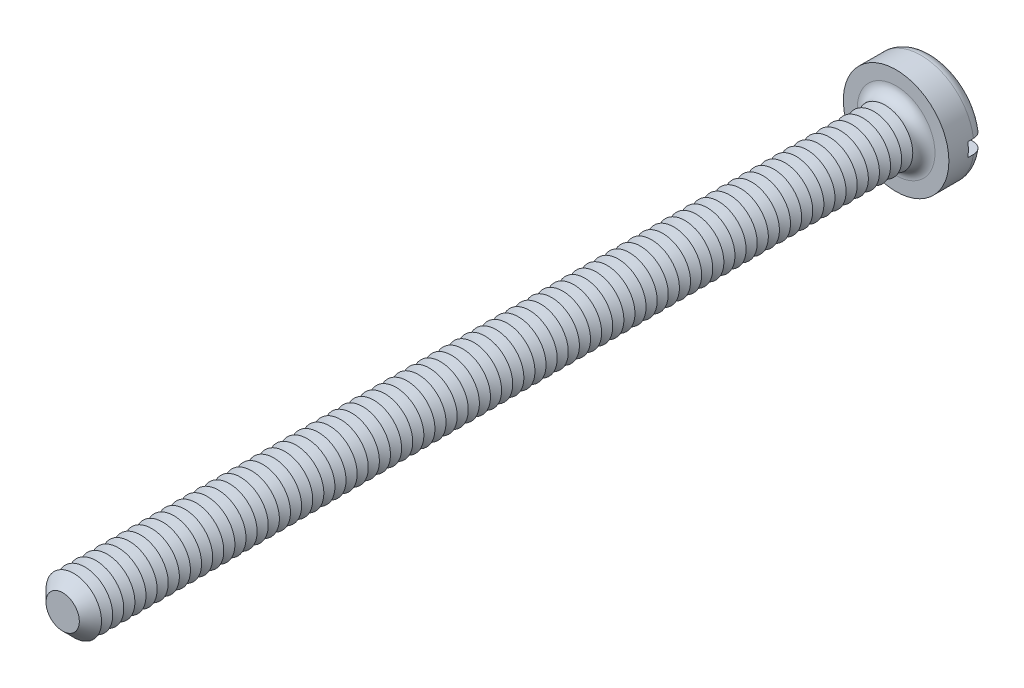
ISO-10303-21;
HEADER;
FILE_DESCRIPTION(('STEP AP214'),'2;1');
FILE_NAME('part.step','',(''),(''),'','','');
FILE_SCHEMA(('AUTOMOTIVE_DESIGN { 1 0 10303 214 1 1 1 1 }'));
ENDSEC;
DATA;
#1=APPLICATION_CONTEXT('core data for automotive mechanical design processes');
#2=APPLICATION_PROTOCOL_DEFINITION('international standard','automotive_design',2000,#1);
#3=PRODUCT_CONTEXT('',#1,'mechanical');
#4=PRODUCT('Part','Part','',(#3));
#5=PRODUCT_RELATED_PRODUCT_CATEGORY('part','',(#4));
#6=PRODUCT_DEFINITION_FORMATION('','',#4);
#7=PRODUCT_DEFINITION_CONTEXT('part definition',#1,'design');
#8=PRODUCT_DEFINITION('design','',#6,#7);
#9=PRODUCT_DEFINITION_SHAPE('','',#8);
#10=(LENGTH_UNIT() NAMED_UNIT(*) SI_UNIT(.MILLI.,.METRE.));
#11=(NAMED_UNIT(*) PLANE_ANGLE_UNIT() SI_UNIT($,.RADIAN.));
#12=(NAMED_UNIT(*) SI_UNIT($,.STERADIAN.) SOLID_ANGLE_UNIT());
#13=UNCERTAINTY_MEASURE_WITH_UNIT(LENGTH_MEASURE(1.E-05),#10,'distance_accuracy_value','');
#14=(GEOMETRIC_REPRESENTATION_CONTEXT(3) GLOBAL_UNCERTAINTY_ASSIGNED_CONTEXT((#13)) GLOBAL_UNIT_ASSIGNED_CONTEXT((#10,
#11,#12)) REPRESENTATION_CONTEXT('',''));
#15=CARTESIAN_POINT('',(0.,0.,0.));
#16=DIRECTION('',(0.,0.,1.));
#17=DIRECTION('',(1.,0.,0.));
#18=AXIS2_PLACEMENT_3D('',#15,#16,#17);
#19=CARTESIAN_POINT('',(0.,0.,-1.3));
#20=DIRECTION('',(0.,0.,1.));
#21=DIRECTION('',(1.,0.,0.));
#22=AXIS2_PLACEMENT_3D('',#19,#20,#21);
#23=PLANE('',#22);
#24=CARTESIAN_POINT('',(0.,0.,-1.3));
#25=DIRECTION('',(0.,0.,1.));
#26=DIRECTION('',(1.,0.,0.));
#27=AXIS2_PLACEMENT_3D('',#24,#25,#26);
#28=CIRCLE('',#27,1.5);
#29=CARTESIAN_POINT('',(-1.4790199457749,0.25,-1.3));
#30=VERTEX_POINT('',#29);
#31=CARTESIAN_POINT('',(1.4790199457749,0.25,-1.3));
#32=VERTEX_POINT('',#31);
#33=EDGE_CURVE('E116',#30,#32,#28,.F.);
#34=ORIENTED_EDGE('',*,*,#33,.T.);
#35=DIRECTION('',(1.,0.,0.));
#36=VECTOR('',#35,1.);
#37=CARTESIAN_POINT('',(-1.9,0.25,-1.3));
#38=LINE('',#37,#36);
#39=EDGE_CURVE('E111',#30,#32,#38,.T.);
#40=ORIENTED_EDGE('',*,*,#39,.F.);
#41=EDGE_LOOP('',(#34,#40));
#42=FACE_BOUND('',#41,.T.);
#43=ADVANCED_FACE('F39',(#42),#23,.F.);
#44=CARTESIAN_POINT('',(0.,0.,-0.9));
#45=DIRECTION('',(0.,0.,1.));
#46=DIRECTION('',(1.,0.,0.));
#47=AXIS2_PLACEMENT_3D('',#44,#45,#46);
#48=TOROIDAL_SURFACE('',#47,1.5,0.4);
#49=CARTESIAN_POINT('',(-1.8150392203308,0.25,-1.12284384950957));
#50=CARTESIAN_POINT('',(-1.80236980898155,0.25,-1.14155059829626));
#51=CARTESIAN_POINT('',(-1.78809920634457,0.25,-1.15919399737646));
#52=CARTESIAN_POINT('',(-1.75677844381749,0.25,-1.19184073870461));
#53=CARTESIAN_POINT('',(-1.73972468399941,0.25,-1.20684060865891));
#54=CARTESIAN_POINT('',(-1.70336024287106,0.25,-1.23375848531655));
#55=CARTESIAN_POINT('',(-1.68405164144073,0.25,-1.24567930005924));
#56=CARTESIAN_POINT('',(-1.64372549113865,0.25,-1.26613528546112));
#57=CARTESIAN_POINT('',(-1.6227083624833,0.25,-1.27467128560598));
#58=CARTESIAN_POINT('',(-1.57937988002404,0.25,-1.2881995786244));
#59=CARTESIAN_POINT('',(-1.55705957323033,0.25,-1.29316318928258));
#60=CARTESIAN_POINT('',(-1.51190394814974,0.25,-1.29931753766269));
#61=CARTESIAN_POINT('',(-1.48906857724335,0.25,-1.3005078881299));
#62=CARTESIAN_POINT('',(-1.4432641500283,0.25,-1.29909058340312));
#63=CARTESIAN_POINT('',(-1.42029638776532,0.25,-1.29644099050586));
#64=CARTESIAN_POINT('',(-1.37512297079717,0.25,-1.28735146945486));
#65=CARTESIAN_POINT('',(-1.3529173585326,0.25,-1.28091133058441));
#66=CARTESIAN_POINT('',(-1.30974098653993,0.25,-1.26436295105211));
#67=CARTESIAN_POINT('',(-1.28877978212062,0.25,-1.25422975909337));
#68=CARTESIAN_POINT('',(-1.24886205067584,0.25,-1.23057736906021));
#69=CARTESIAN_POINT('',(-1.22990554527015,0.25,-1.21705813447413));
#70=CARTESIAN_POINT('',(-1.19461911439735,0.25,-1.18704970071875));
#71=CARTESIAN_POINT('',(-1.17828051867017,0.25,-1.17057070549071));
#72=CARTESIAN_POINT('',(-1.14865897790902,0.25,-1.13506201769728));
#73=CARTESIAN_POINT('',(-1.13537576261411,0.25,-1.11603255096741));
#74=CARTESIAN_POINT('',(-1.11249827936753,0.25,-1.07630328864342));
#75=CARTESIAN_POINT('',(-1.10284494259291,0.25,-1.05563752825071));
#76=CARTESIAN_POINT('',(-1.08724024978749,0.25,-1.01295282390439));
#77=CARTESIAN_POINT('',(-1.08128829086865,0.25,-0.990934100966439));
#78=CARTESIAN_POINT('',(-1.07339124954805,0.25,-0.946722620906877));
#79=CARTESIAN_POINT('',(-1.07135558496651,0.25,-0.924546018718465));
#80=CARTESIAN_POINT('',(-1.07108722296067,0.25,-0.880170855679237));
#81=CARTESIAN_POINT('',(-1.07285419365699,0.25,-0.857972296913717));
#82=CARTESIAN_POINT('',(-1.0800838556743,0.25,-0.814463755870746));
#83=CARTESIAN_POINT('',(-1.08550159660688,0.25,-0.793146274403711));
#84=CARTESIAN_POINT('',(-1.09980522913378,0.25,-0.751709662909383));
#85=CARTESIAN_POINT('',(-1.10869126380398,0.25,-0.731590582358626));
#86=CARTESIAN_POINT('',(-1.12975121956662,0.25,-0.692901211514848));
#87=CARTESIAN_POINT('',(-1.14195627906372,0.25,-0.674347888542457));
#88=CARTESIAN_POINT('',(-1.1692428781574,0.25,-0.639494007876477));
#89=CARTESIAN_POINT('',(-1.18432473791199,0.25,-0.623193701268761));
#90=CARTESIAN_POINT('',(-1.21730350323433,0.25,-0.592916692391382));
#91=CARTESIAN_POINT('',(-1.23525650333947,0.25,-0.579001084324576));
#92=CARTESIAN_POINT('',(-1.27320799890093,0.25,-0.554314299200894));
#93=CARTESIAN_POINT('',(-1.2932067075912,0.25,-0.543543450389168));
#94=CARTESIAN_POINT('',(-1.33509120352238,0.25,-0.525253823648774));
#95=CARTESIAN_POINT('',(-1.35700545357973,0.25,-0.517800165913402));
#96=CARTESIAN_POINT('',(-1.401770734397,0.25,-0.506652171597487));
#97=CARTESIAN_POINT('',(-1.42462180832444,0.25,-0.502958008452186));
#98=CARTESIAN_POINT('',(-1.4707602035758,0.25,-0.499429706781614));
#99=CARTESIAN_POINT('',(-1.49404932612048,0.25,-0.499619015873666));
#100=CARTESIAN_POINT('',(-1.54026206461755,0.25,-0.50392615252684));
#101=CARTESIAN_POINT('',(-1.56318568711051,0.25,-0.508043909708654));
#102=CARTESIAN_POINT('',(-1.60788420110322,0.25,-0.520077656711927));
#103=CARTESIAN_POINT('',(-1.6296645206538,0.25,-0.527973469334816));
#104=CARTESIAN_POINT('',(-1.67156889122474,0.25,-0.547348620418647));
#105=CARTESIAN_POINT('',(-1.69169302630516,0.25,-0.558827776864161));
#106=CARTESIAN_POINT('',(-1.72948251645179,0.25,-0.584913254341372));
#107=CARTESIAN_POINT('',(-1.74717189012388,0.25,-0.599484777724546));
#108=CARTESIAN_POINT('',(-1.77981909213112,0.25,-0.63142070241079));
#109=CARTESIAN_POINT('',(-1.79477707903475,0.25,-0.648784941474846));
#110=CARTESIAN_POINT('',(-1.82136524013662,0.25,-0.685607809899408));
#111=CARTESIAN_POINT('',(-1.83303003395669,0.25,-0.705041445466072));
#112=CARTESIAN_POINT('',(-1.85289960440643,0.25,-0.745602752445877));
#113=CARTESIAN_POINT('',(-1.86110468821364,0.25,-0.76673027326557));
#114=CARTESIAN_POINT('',(-1.87375648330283,0.25,-0.809891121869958));
#115=CARTESIAN_POINT('',(-1.87823381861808,0.25,-0.831915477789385));
#116=CARTESIAN_POINT('',(-1.88341152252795,0.25,-0.87640983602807));
#117=CARTESIAN_POINT('',(-1.88411103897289,0.25,-0.898879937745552));
#118=CARTESIAN_POINT('',(-1.88171559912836,0.25,-0.943534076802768));
#119=CARTESIAN_POINT('',(-1.87863413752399,0.25,-0.965718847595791));
#120=CARTESIAN_POINT('',(-1.86879153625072,0.25,-1.00923650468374));
#121=CARTESIAN_POINT('',(-1.86203494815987,0.25,-1.03057040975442));
#122=CARTESIAN_POINT('',(-1.84837477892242,0.25,-1.06373797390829));
#123=CARTESIAN_POINT('',(-1.84255723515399,0.25,-1.07603047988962));
#124=CARTESIAN_POINT('',(-1.82969924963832,0.25,-1.09995814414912));
#125=CARTESIAN_POINT('',(-1.82265881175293,0.25,-1.11159330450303));
#126=CARTESIAN_POINT('',(-1.8150392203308,0.25,-1.12284384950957));
#127=B_SPLINE_CURVE_WITH_KNOTS('',3,(#49,#50,#51,#52,#53,#54,#55,#56,#57,#58,#59,#60,#61,#62,
#63,#64,#65,#66,#67,#68,#69,#70,#71,#72,#73,#74,#75,#76,#77,#78,#79,#80,#81,#82,#83,#84,#85,#86,
#87,#88,#89,#90,#91,#92,#93,#94,#95,#96,#97,#98,#99,#100,#101,#102,#103,#104,#105,#106,#107,
#108,#109,#110,#111,#112,#113,#114,#115,#116,#117,#118,#119,#120,#121,#122,#123,#124,#125,#126),
.UNSPECIFIED.,.T.,.F.,(4,2,2,2,2,2,2,2,2,2,2,2,2,2,2,2,2,2,2,2,2,2,2,2,2,2,2,2,2,2,2,2,2,2,2,2,
2,2,4),(0.,0.0677296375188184,0.135547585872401,0.203303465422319,0.27104273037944,
0.339319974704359,0.407604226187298,0.47663988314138,0.545679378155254,0.615194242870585,
0.684709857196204,0.753990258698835,0.82326452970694,0.891356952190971,0.959438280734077,
1.02592503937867,1.0924059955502,1.15808300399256,1.2237627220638,1.29008126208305,
1.35640718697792,1.4242376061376,1.49207510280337,1.5611911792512,1.63031044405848,
1.69984715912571,1.76938262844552,1.8385508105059,1.90771547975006,1.97613962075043,
2.04455978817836,2.11223135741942,2.17989691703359,2.24700094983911,2.31412011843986,
2.38100042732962,2.44779809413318,2.48853193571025,2.52926564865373),.UNSPECIFIED.);
#128=CARTESIAN_POINT('',(-1.88348082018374,0.25,-0.9));
#129=VERTEX_POINT('',#128);
#130=EDGE_CURVE('E763',#129,#30,#127,.T.);
#131=ORIENTED_EDGE('',*,*,#130,.F.);
#132=CARTESIAN_POINT('',(0.,0.,-0.9));
#133=DIRECTION('',(0.,0.,1.));
#134=DIRECTION('',(1.,0.,0.));
#135=AXIS2_PLACEMENT_3D('',#132,#133,#134);
#136=CIRCLE('',#135,1.9);
#137=CARTESIAN_POINT('',(1.88348082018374,0.25,-0.9));
#138=VERTEX_POINT('',#137);
#139=EDGE_CURVE('E125',#138,#129,#136,.T.);
#140=ORIENTED_EDGE('',*,*,#139,.F.);
#141=CARTESIAN_POINT('',(1.11362660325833,0.25,-1.07710243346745));
#142=CARTESIAN_POINT('',(1.12388366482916,0.25,-1.09736755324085));
#143=CARTESIAN_POINT('',(1.13589127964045,0.25,-1.11676768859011));
#144=CARTESIAN_POINT('',(1.16301945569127,0.25,-1.15328107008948));
#145=CARTESIAN_POINT('',(1.17814463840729,0.25,-1.17039085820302));
#146=CARTESIAN_POINT('',(1.21101661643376,0.25,-1.20182395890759));
#147=CARTESIAN_POINT('',(1.22875976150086,0.25,-1.21615108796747));
#148=CARTESIAN_POINT('',(1.26636392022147,0.25,-1.24166932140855));
#149=CARTESIAN_POINT('',(1.28622436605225,0.25,-1.25286126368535));
#150=CARTESIAN_POINT('',(1.32781377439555,0.25,-1.27196191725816));
#151=CARTESIAN_POINT('',(1.34956550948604,0.25,-1.27982107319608));
#152=CARTESIAN_POINT('',(1.39407620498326,0.25,-1.29180513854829));
#153=CARTESIAN_POINT('',(1.41683526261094,0.25,-1.29592968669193));
#154=CARTESIAN_POINT('',(1.46288034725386,0.25,-1.3003367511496));
#155=CARTESIAN_POINT('',(1.48616890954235,0.25,-1.30059287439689));
#156=CARTESIAN_POINT('',(1.53245605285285,0.25,-1.29717239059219));
#157=CARTESIAN_POINT('',(1.55545463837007,0.25,-1.29349584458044));
#158=CARTESIAN_POINT('',(1.60038828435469,0.25,-1.28232271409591));
#159=CARTESIAN_POINT('',(1.62232790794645,0.25,-1.27484449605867));
#160=CARTESIAN_POINT('',(1.66461970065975,0.25,-1.25627203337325));
#161=CARTESIAN_POINT('',(1.68497195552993,0.25,-1.24517798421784));
#162=CARTESIAN_POINT('',(1.72328060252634,0.25,-1.21981269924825));
#163=CARTESIAN_POINT('',(1.74126001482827,0.25,-1.2055762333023));
#164=CARTESIAN_POINT('',(1.77453973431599,0.25,-1.17425606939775));
#165=CARTESIAN_POINT('',(1.78984019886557,0.25,-1.1571725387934));
#166=CARTESIAN_POINT('',(1.81715014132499,0.25,-1.12084732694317));
#167=CARTESIAN_POINT('',(1.82919410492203,0.25,-1.10163156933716));
#168=CARTESIAN_POINT('',(1.84985315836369,0.25,-1.06143759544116));
#169=CARTESIAN_POINT('',(1.85846842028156,0.25,-1.04045946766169));
#170=CARTESIAN_POINT('',(1.87195437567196,0.25,-0.997526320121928));
#171=CARTESIAN_POINT('',(1.87685590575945,0.25,-0.975580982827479));
#172=CARTESIAN_POINT('',(1.88288741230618,0.25,-0.931178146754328));
#173=CARTESIAN_POINT('',(1.88401750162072,0.25,-0.908720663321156));
#174=CARTESIAN_POINT('',(1.88247598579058,0.25,-0.864033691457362));
#175=CARTESIAN_POINT('',(1.87982069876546,0.25,-0.841803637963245));
#176=CARTESIAN_POINT('',(1.87081646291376,0.25,-0.798104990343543));
#177=CARTESIAN_POINT('',(1.86446754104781,0.25,-0.776636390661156));
#178=CARTESIAN_POINT('',(1.84826063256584,0.25,-0.735060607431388));
#179=CARTESIAN_POINT('',(1.83840161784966,0.25,-0.714953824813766));
#180=CARTESIAN_POINT('',(1.81546327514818,0.25,-0.676670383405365));
#181=CARTESIAN_POINT('',(1.80238389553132,0.25,-0.658493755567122));
#182=CARTESIAN_POINT('',(1.77331327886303,0.25,-0.62448916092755));
#183=CARTESIAN_POINT('',(1.75730833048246,0.25,-0.608672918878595));
#184=CARTESIAN_POINT('',(1.72289038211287,0.25,-0.579924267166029));
#185=CARTESIAN_POINT('',(1.70447729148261,0.25,-0.566991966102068));
#186=CARTESIAN_POINT('',(1.66559643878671,0.25,-0.544254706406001));
#187=CARTESIAN_POINT('',(1.64511218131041,0.25,-0.53447796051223));
#188=CARTESIAN_POINT('',(1.60280554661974,0.25,-0.518459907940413));
#189=CARTESIAN_POINT('',(1.58098309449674,0.25,-0.512218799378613));
#190=CARTESIAN_POINT('',(1.53636184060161,0.25,-0.503375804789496));
#191=CARTESIAN_POINT('',(1.51355490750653,0.25,-0.500814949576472));
#192=CARTESIAN_POINT('',(1.46783245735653,0.25,-0.499516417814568));
#193=CARTESIAN_POINT('',(1.44491693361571,0.25,-0.500778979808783));
#194=CARTESIAN_POINT('',(1.39937748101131,0.25,-0.50711284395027));
#195=CARTESIAN_POINT('',(1.37675897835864,0.25,-0.512223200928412));
#196=CARTESIAN_POINT('',(1.33269286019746,0.25,-0.526151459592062));
#197=CARTESIAN_POINT('',(1.31124530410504,0.25,-0.534969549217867));
#198=CARTESIAN_POINT('',(1.27004097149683,0.25,-0.556118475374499));
#199=CARTESIAN_POINT('',(1.25029179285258,0.25,-0.568464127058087));
#200=CARTESIAN_POINT('',(1.21316554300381,0.25,-0.59631968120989));
#201=CARTESIAN_POINT('',(1.19578844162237,0.25,-0.611829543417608));
#202=CARTESIAN_POINT('',(1.16406059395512,0.25,-0.645459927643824));
#203=CARTESIAN_POINT('',(1.14968747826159,0.25,-0.663559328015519));
#204=CARTESIAN_POINT('',(1.12425968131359,0.25,-0.70195566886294));
#205=CARTESIAN_POINT('',(1.11320445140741,0.25,-0.722252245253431));
#206=CARTESIAN_POINT('',(1.09497726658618,0.25,-0.764020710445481));
#207=CARTESIAN_POINT('',(1.08772970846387,0.25,-0.785459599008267));
#208=CARTESIAN_POINT('',(1.07702618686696,0.25,-0.829269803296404));
#209=CARTESIAN_POINT('',(1.07357062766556,0.25,-0.851641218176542));
#210=CARTESIAN_POINT('',(1.07060826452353,0.25,-0.896160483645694));
#211=CARTESIAN_POINT('',(1.07101876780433,0.25,-0.918302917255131));
#212=CARTESIAN_POINT('',(1.07557730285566,0.25,-0.962179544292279));
#213=CARTESIAN_POINT('',(1.07972048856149,0.25,-0.983914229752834));
#214=CARTESIAN_POINT('',(1.08912066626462,0.25,-1.01754924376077));
#215=CARTESIAN_POINT('',(1.09320341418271,0.25,-1.02979035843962));
#216=CARTESIAN_POINT('',(1.10254493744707,0.25,-1.05381470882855));
#217=CARTESIAN_POINT('',(1.10780368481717,0.25,-1.06559795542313));
#218=CARTESIAN_POINT('',(1.11362660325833,0.25,-1.07710243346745));
#219=B_SPLINE_CURVE_WITH_KNOTS('',3,(#141,#142,#143,#144,#145,#146,#147,#148,#149,#150,#151,
#152,#153,#154,#155,#156,#157,#158,#159,#160,#161,#162,#163,#164,#165,#166,#167,#168,#169,#170,
#171,#172,#173,#174,#175,#176,#177,#178,#179,#180,#181,#182,#183,#184,#185,#186,#187,#188,#189,
#190,#191,#192,#193,#194,#195,#196,#197,#198,#199,#200,#201,#202,#203,#204,#205,#206,#207,#208,
#209,#210,#211,#212,#213,#214,#215,#216,#217,#218),.UNSPECIFIED.,.T.,.F.,(4,2,2,2,2,2,2,2,2,2,2,
2,2,2,2,2,2,2,2,2,2,2,2,2,2,2,2,2,2,2,2,2,2,2,2,2,2,2,4),(0.,0.0680907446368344,
0.136283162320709,0.204381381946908,0.272461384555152,0.341520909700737,0.410587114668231,
0.480124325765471,0.549660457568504,0.618863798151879,0.688063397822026,0.756532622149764,
0.824997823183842,0.892706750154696,0.960412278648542,1.02754926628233,1.09468424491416,
1.16153068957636,1.22837664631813,1.29524219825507,1.36210882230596,1.42929726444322,
1.49648823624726,1.56426429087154,1.63204414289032,1.70057395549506,1.76910804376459,
1.83834728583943,1.90759003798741,1.97712798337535,2.0466650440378,2.11566422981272,
2.18465199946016,2.25221259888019,2.3197804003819,2.38590630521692,2.45194648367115,
2.49060241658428,2.5292574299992),.UNSPECIFIED.);
#220=EDGE_CURVE('E765',#32,#138,#219,.T.);
#221=ORIENTED_EDGE('',*,*,#220,.F.);
#222=ORIENTED_EDGE('',*,*,#33,.F.);
#223=EDGE_LOOP('',(#131,#140,#221,#222));
#224=FACE_BOUND('',#223,.T.);
#225=ADVANCED_FACE('F747',(#224),#48,.T.);
#226=CARTESIAN_POINT('',(0.,0.,-1.3));
#227=DIRECTION('',(0.,0.,1.));
#228=DIRECTION('',(1.,0.,0.));
#229=AXIS2_PLACEMENT_3D('',#226,#227,#228);
#230=CYLINDRICAL_SURFACE('',#229,1.9);
#231=DIRECTION('',(0.,0.,1.));
#232=VECTOR('',#231,1.);
#233=CARTESIAN_POINT('',(1.88348082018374,0.25,-1.3));
#234=LINE('',#233,#232);
#235=CARTESIAN_POINT('',(1.88348082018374,0.25,-0.7));
#236=VERTEX_POINT('',#235);
#237=EDGE_CURVE('E781',#138,#236,#234,.T.);
#238=ORIENTED_EDGE('',*,*,#237,.F.);
#239=ORIENTED_EDGE('',*,*,#139,.T.);
#240=DIRECTION('',(0.,0.,1.));
#241=VECTOR('',#240,1.);
#242=CARTESIAN_POINT('',(-1.88348082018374,0.25,-1.3));
#243=LINE('',#242,#241);
#244=CARTESIAN_POINT('',(-1.88348082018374,0.25,-0.7));
#245=VERTEX_POINT('',#244);
#246=EDGE_CURVE('E63',#245,#129,#243,.F.);
#247=ORIENTED_EDGE('',*,*,#246,.F.);
#248=CARTESIAN_POINT('',(0.,0.,-0.7));
#249=DIRECTION('',(0.,0.,-1.));
#250=DIRECTION('',(-1.,0.,0.));
#251=AXIS2_PLACEMENT_3D('',#248,#249,#250);
#252=CIRCLE('',#251,1.9);
#253=CARTESIAN_POINT('',(-1.88348082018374,-0.25,-0.7));
#254=VERTEX_POINT('',#253);
#255=EDGE_CURVE('E43',#245,#254,#252,.F.);
#256=ORIENTED_EDGE('',*,*,#255,.T.);
#257=DIRECTION('',(0.,0.,1.));
#258=VECTOR('',#257,1.);
#259=CARTESIAN_POINT('',(-1.88348082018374,-0.25,-1.3));
#260=LINE('',#259,#258);
#261=CARTESIAN_POINT('',(-1.88348082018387,-0.25,-0.899999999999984));
#262=VERTEX_POINT('',#261);
#263=EDGE_CURVE('E778',#262,#254,#260,.T.);
#264=ORIENTED_EDGE('',*,*,#263,.F.);
#265=CARTESIAN_POINT('',(1.88348082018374,-0.25,-0.9));
#266=VERTEX_POINT('',#265);
#267=EDGE_CURVE('E127',#262,#266,#136,.T.);
#268=ORIENTED_EDGE('',*,*,#267,.T.);
#269=DIRECTION('',(0.,0.,1.));
#270=VECTOR('',#269,1.);
#271=CARTESIAN_POINT('',(1.88348082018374,-0.25,-1.3));
#272=LINE('',#271,#270);
#273=CARTESIAN_POINT('',(1.88348082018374,-0.25,-0.7));
#274=VERTEX_POINT('',#273);
#275=EDGE_CURVE('E55',#274,#266,#272,.F.);
#276=ORIENTED_EDGE('',*,*,#275,.F.);
#277=EDGE_CURVE('E11',#274,#236,#252,.F.);
#278=ORIENTED_EDGE('',*,*,#277,.T.);
#279=EDGE_LOOP('',(#238,#239,#247,#256,#264,#268,#276,#278));
#280=FACE_BOUND('',#279,.T.);
#281=CARTESIAN_POINT('',(0.,0.,0.));
#282=DIRECTION('',(0.,0.,1.));
#283=DIRECTION('',(1.,0.,0.));
#284=AXIS2_PLACEMENT_3D('',#281,#282,#283);
#285=CIRCLE('',#284,1.9);
#286=CARTESIAN_POINT('',(1.9,0.,0.));
#287=VERTEX_POINT('',#286);
#288=EDGE_CURVE('E784',#287,#287,#285,.T.);
#289=ORIENTED_EDGE('',*,*,#288,.F.);
#290=EDGE_LOOP('',(#289));
#291=FACE_BOUND('',#290,.T.);
#292=ADVANCED_FACE('F743',(#280,#291),#230,.T.);
#293=CARTESIAN_POINT('',(1.4790199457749,-0.25,-1.3));
#294=VERTEX_POINT('',#293);
#295=CARTESIAN_POINT('',(-1.4790199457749,-0.25,-1.3));
#296=VERTEX_POINT('',#295);
#297=EDGE_CURVE('E109',#294,#296,#28,.F.);
#298=ORIENTED_EDGE('',*,*,#297,.T.);
#299=DIRECTION('',(-1.,0.,0.));
#300=VECTOR('',#299,1.);
#301=CARTESIAN_POINT('',(-1.9,-0.25,-1.3));
#302=LINE('',#301,#300);
#303=EDGE_CURVE('E96',#294,#296,#302,.T.);
#304=ORIENTED_EDGE('',*,*,#303,.F.);
#305=EDGE_LOOP('',(#298,#304));
#306=FACE_BOUND('',#305,.T.);
#307=ADVANCED_FACE('F108',(#306),#23,.F.);
#308=CARTESIAN_POINT('',(0.,0.,0.));
#309=DIRECTION('',(0.,0.,1.));
#310=DIRECTION('',(1.,0.,0.));
#311=AXIS2_PLACEMENT_3D('',#308,#309,#310);
#312=PLANE('',#311);
#313=CARTESIAN_POINT('',(0.,0.,0.));
#314=DIRECTION('',(0.,0.,1.));
#315=DIRECTION('',(1.,0.,0.));
#316=AXIS2_PLACEMENT_3D('',#313,#314,#315);
#317=CIRCLE('',#316,1.4);
#318=CARTESIAN_POINT('',(1.4,0.,0.));
#319=VERTEX_POINT('',#318);
#320=EDGE_CURVE('E115',#319,#319,#317,.F.);
#321=ORIENTED_EDGE('',*,*,#320,.T.);
#322=EDGE_LOOP('',(#321));
#323=FACE_BOUND('',#322,.T.);
#324=ORIENTED_EDGE('',*,*,#288,.T.);
#325=EDGE_LOOP('',(#324));
#326=FACE_BOUND('',#325,.T.);
#327=ADVANCED_FACE('F742',(#323,#326),#312,.T.);
#328=CARTESIAN_POINT('',(-1.8150392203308,-0.25,-1.12284384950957));
#329=CARTESIAN_POINT('',(-1.82756185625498,-0.25,-1.10435021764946));
#330=CARTESIAN_POINT('',(-1.83853807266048,-0.25,-1.08479072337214));
#331=CARTESIAN_POINT('',(-1.85706233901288,-0.25,-1.04409188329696));
#332=CARTESIAN_POINT('',(-1.86460655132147,-0.25,-1.02295079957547));
#333=CARTESIAN_POINT('',(-1.87603074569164,-0.25,-0.979704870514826));
#334=CARTESIAN_POINT('',(-1.87991177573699,-0.25,-0.957600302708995));
#335=CARTESIAN_POINT('',(-1.88389586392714,-0.25,-0.913058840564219));
#336=CARTESIAN_POINT('',(-1.88399981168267,-0.25,-0.890622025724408));
#337=CARTESIAN_POINT('',(-1.88043374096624,-0.25,-0.846104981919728));
#338=CARTESIAN_POINT('',(-1.87677281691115,-0.25,-0.824024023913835));
#339=CARTESIAN_POINT('',(-1.86579880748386,-0.25,-0.780788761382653));
#340=CARTESIAN_POINT('',(-1.85848560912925,-0.25,-0.759634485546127));
#341=CARTESIAN_POINT('',(-1.8404137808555,-0.25,-0.718830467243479));
#342=CARTESIAN_POINT('',(-1.82965205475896,-0.25,-0.699182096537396));
#343=CARTESIAN_POINT('',(-1.80499939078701,-0.25,-0.661958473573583));
#344=CARTESIAN_POINT('',(-1.7911083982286,-0.25,-0.644383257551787));
#345=CARTESIAN_POINT('',(-1.76051564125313,-0.25,-0.611699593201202));
#346=CARTESIAN_POINT('',(-1.74379913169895,-0.25,-0.596604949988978));
#347=CARTESIAN_POINT('',(-1.70808901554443,-0.25,-0.569406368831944));
#348=CARTESIAN_POINT('',(-1.68909532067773,-0.25,-0.557302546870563));
#349=CARTESIAN_POINT('',(-1.64918615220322,-0.25,-0.536307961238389));
#350=CARTESIAN_POINT('',(-1.62825469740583,-0.25,-0.527447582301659));
#351=CARTESIAN_POINT('',(-1.58521203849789,-0.25,-0.513323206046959));
#352=CARTESIAN_POINT('',(-1.5631007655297,-0.25,-0.508059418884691));
#353=CARTESIAN_POINT('',(-1.51806209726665,-0.25,-0.501215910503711));
#354=CARTESIAN_POINT('',(-1.4951283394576,-0.25,-0.499678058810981));
#355=CARTESIAN_POINT('',(-1.4493239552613,-0.25,-0.500434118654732));
#356=CARTESIAN_POINT('',(-1.4264533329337,-0.25,-0.502728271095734));
#357=CARTESIAN_POINT('',(-1.38118643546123,-0.25,-0.511115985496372));
#358=CARTESIAN_POINT('',(-1.35879703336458,-0.25,-0.51724667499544));
#359=CARTESIAN_POINT('',(-1.31535851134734,-0.25,-0.533167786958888));
#360=CARTESIAN_POINT('',(-1.29430945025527,-0.25,-0.542958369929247));
#361=CARTESIAN_POINT('',(-1.25409242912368,-0.25,-0.565968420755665));
#362=CARTESIAN_POINT('',(-1.23493023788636,-0.25,-0.579197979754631));
#363=CARTESIAN_POINT('',(-1.19912477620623,-0.25,-0.608715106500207));
#364=CARTESIAN_POINT('',(-1.18248143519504,-0.25,-0.625002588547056));
#365=CARTESIAN_POINT('',(-1.15237533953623,-0.25,-0.660018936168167));
#366=CARTESIAN_POINT('',(-1.13888343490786,-0.25,-0.678722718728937));
#367=CARTESIAN_POINT('',(-1.115312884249,-0.25,-0.718170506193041));
#368=CARTESIAN_POINT('',(-1.10523377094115,-0.25,-0.738914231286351));
#369=CARTESIAN_POINT('',(-1.08901310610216,-0.25,-0.781372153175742));
#370=CARTESIAN_POINT('',(-1.08279080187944,-0.25,-0.803055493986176));
#371=CARTESIAN_POINT('',(-1.07416105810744,-0.25,-0.847167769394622));
#372=CARTESIAN_POINT('',(-1.07175306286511,-0.25,-0.869596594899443));
#373=CARTESIAN_POINT('',(-1.07084656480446,-0.25,-0.914070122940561));
#374=CARTESIAN_POINT('',(-1.07226874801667,-0.25,-0.936113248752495));
#375=CARTESIAN_POINT('',(-1.07880428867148,-0.25,-0.979644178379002));
#376=CARTESIAN_POINT('',(-1.08391755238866,-0.25,-1.00113199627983));
#377=CARTESIAN_POINT('',(-1.09764616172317,-0.25,-1.04290115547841));
#378=CARTESIAN_POINT('',(-1.10625346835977,-0.25,-1.06318514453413));
#379=CARTESIAN_POINT('',(-1.12669365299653,-0.25,-1.10205584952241));
#380=CARTESIAN_POINT('',(-1.13852679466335,-0.25,-1.12064242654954));
#381=CARTESIAN_POINT('',(-1.16529672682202,-0.25,-1.15594801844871));
#382=CARTESIAN_POINT('',(-1.18028464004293,-0.25,-1.17262825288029));
#383=CARTESIAN_POINT('',(-1.21279183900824,-0.25,-1.20330600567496));
#384=CARTESIAN_POINT('',(-1.23031142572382,-0.25,-1.21730320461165));
#385=CARTESIAN_POINT('',(-1.26781695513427,-0.25,-1.24254670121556));
#386=CARTESIAN_POINT('',(-1.28784999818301,-0.25,-1.25372305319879));
#387=CARTESIAN_POINT('',(-1.3294899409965,-0.25,-1.27260611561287));
#388=CARTESIAN_POINT('',(-1.35109697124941,-0.25,-1.28031253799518));
#389=CARTESIAN_POINT('',(-1.39558575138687,-0.25,-1.29212626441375));
#390=CARTESIAN_POINT('',(-1.4184807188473,-0.25,-1.29618386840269));
#391=CARTESIAN_POINT('',(-1.4646266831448,-0.25,-1.30039947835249));
#392=CARTESIAN_POINT('',(-1.48787767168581,-0.25,-1.30055757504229));
#393=CARTESIAN_POINT('',(-1.53407883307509,-0.25,-1.29695468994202));
#394=CARTESIAN_POINT('',(-1.55702895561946,-0.25,-1.29319306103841));
#395=CARTESIAN_POINT('',(-1.60196718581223,-0.25,-1.28183520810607));
#396=CARTESIAN_POINT('',(-1.62395508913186,-0.25,-1.27423817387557));
#397=CARTESIAN_POINT('',(-1.66614393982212,-0.25,-1.25548646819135));
#398=CARTESIAN_POINT('',(-1.68635782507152,-0.25,-1.24436087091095));
#399=CARTESIAN_POINT('',(-1.72458266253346,-0.25,-1.21884344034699));
#400=CARTESIAN_POINT('',(-1.74259637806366,-0.25,-1.20445577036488));
#401=CARTESIAN_POINT('',(-1.76968989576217,-0.25,-1.1787247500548));
#402=CARTESIAN_POINT('',(-1.77959984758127,-0.25,-1.1682407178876));
#403=CARTESIAN_POINT('',(-1.79823423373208,-0.25,-1.14626700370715));
#404=CARTESIAN_POINT('',(-1.80695867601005,-0.25,-1.1347773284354));
#405=CARTESIAN_POINT('',(-1.8150392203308,-0.25,-1.12284384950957));
#406=B_SPLINE_CURVE_WITH_KNOTS('',3,(#328,#329,#330,#331,#332,#333,#334,#335,#336,#337,#338,
#339,#340,#341,#342,#343,#344,#345,#346,#347,#348,#349,#350,#351,#352,#353,#354,#355,#356,#357,
#358,#359,#360,#361,#362,#363,#364,#365,#366,#367,#368,#369,#370,#371,#372,#373,#374,#375,#376,
#377,#378,#379,#380,#381,#382,#383,#384,#385,#386,#387,#388,#389,#390,#391,#392,#393,#394,#395,
#396,#397,#398,#399,#400,#401,#402,#403,#404,#405),.UNSPECIFIED.,.T.,.F.,(4,2,2,2,2,2,2,2,2,2,2,
2,2,2,2,2,2,2,2,2,2,2,2,2,2,2,2,2,2,2,2,2,2,2,2,2,2,2,4),(0.,0.0669512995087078,
0.133977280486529,0.200984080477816,0.267975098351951,0.334804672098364,0.401636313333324,
0.468528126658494,0.535421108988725,0.602674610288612,0.669930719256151,0.737801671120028,
0.805676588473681,0.87431077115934,0.942949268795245,1.0122625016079,1.08157877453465,
1.15110078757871,1.22062085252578,1.28946987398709,1.35830946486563,1.42565417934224,
1.49298908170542,1.55894041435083,1.62489007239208,1.69068884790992,1.75649300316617,
1.82345932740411,1.89043361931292,1.95893391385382,2.02743989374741,2.09686543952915,
2.16628937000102,2.23572476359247,2.3051748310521,2.3740669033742,2.44287154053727,
2.48607383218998,2.52927583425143),.UNSPECIFIED.);
#407=EDGE_CURVE('E103',#296,#262,#406,.T.);
#408=ORIENTED_EDGE('',*,*,#407,.F.);
#409=ORIENTED_EDGE('',*,*,#297,.F.);
#410=CARTESIAN_POINT('',(1.11362660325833,-0.25,-1.07710243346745));
#411=CARTESIAN_POINT('',(1.10368387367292,-0.25,-1.05745397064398));
#412=CARTESIAN_POINT('',(1.09537204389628,-0.25,-1.0369644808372));
#413=CARTESIAN_POINT('',(1.08229212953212,-0.25,-0.994867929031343));
#414=CARTESIAN_POINT('',(1.07752732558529,-0.25,-0.973259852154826));
#415=CARTESIAN_POINT('',(1.07171197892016,-0.25,-0.929545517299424));
#416=CARTESIAN_POINT('',(1.07066166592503,-0.25,-0.907439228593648));
#417=CARTESIAN_POINT('',(1.07231382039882,-0.25,-0.863372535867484));
#418=CARTESIAN_POINT('',(1.07501551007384,-0.25,-0.841412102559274));
#419=CARTESIAN_POINT('',(1.08404966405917,-0.25,-0.798386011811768));
#420=CARTESIAN_POINT('',(1.09036099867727,-0.25,-0.777315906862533));
#421=CARTESIAN_POINT('',(1.10638973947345,-0.25,-0.736514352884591));
#422=CARTESIAN_POINT('',(1.11610743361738,-0.25,-0.716783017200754));
#423=CARTESIAN_POINT('',(1.13878208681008,-0.25,-0.678952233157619));
#424=CARTESIAN_POINT('',(1.15177705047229,-0.25,-0.660875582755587));
#425=CARTESIAN_POINT('',(1.18055347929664,-0.25,-0.62709692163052));
#426=CARTESIAN_POINT('',(1.19633525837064,-0.25,-0.611395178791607));
#427=CARTESIAN_POINT('',(1.23062926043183,-0.25,-0.582430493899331));
#428=CARTESIAN_POINT('',(1.24919608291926,-0.25,-0.569232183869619));
#429=CARTESIAN_POINT('',(1.28825118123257,-0.25,-0.546076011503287));
#430=CARTESIAN_POINT('',(1.30873964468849,-0.25,-0.536118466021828));
#431=CARTESIAN_POINT('',(1.35144534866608,-0.25,-0.519560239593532));
#432=CARTESIAN_POINT('',(1.3736865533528,-0.25,-0.513021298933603));
#433=CARTESIAN_POINT('',(1.41894945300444,-0.25,-0.503751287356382));
#434=CARTESIAN_POINT('',(1.44197117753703,-0.25,-0.50102036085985));
#435=CARTESIAN_POINT('',(1.48824913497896,-0.25,-0.499449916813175));
#436=CARTESIAN_POINT('',(1.5115059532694,-0.25,-0.500627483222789));
#437=CARTESIAN_POINT('',(1.55748678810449,-0.25,-0.506895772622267));
#438=CARTESIAN_POINT('',(1.58021081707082,-0.25,-0.511986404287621));
#439=CARTESIAN_POINT('',(1.6243247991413,-0.25,-0.525910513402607));
#440=CARTESIAN_POINT('',(1.64572225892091,-0.25,-0.534720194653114));
#441=CARTESIAN_POINT('',(1.68671060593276,-0.25,-0.555845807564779));
#442=CARTESIAN_POINT('',(1.70630159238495,-0.25,-0.568161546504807));
#443=CARTESIAN_POINT('',(1.74289060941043,-0.25,-0.595805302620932));
#444=CARTESIAN_POINT('',(1.75991474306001,-0.25,-0.611098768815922));
#445=CARTESIAN_POINT('',(1.79111916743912,-0.25,-0.644354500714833));
#446=CARTESIAN_POINT('',(1.80529962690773,-0.25,-0.662316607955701));
#447=CARTESIAN_POINT('',(1.83025525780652,-0.25,-0.700191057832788));
#448=CARTESIAN_POINT('',(1.84106535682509,-0.25,-0.720080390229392));
#449=CARTESIAN_POINT('',(1.8591630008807,-0.25,-0.761401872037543));
#450=CARTESIAN_POINT('',(1.86645070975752,-0.25,-0.782833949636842));
#451=CARTESIAN_POINT('',(1.87724305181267,-0.25,-0.826454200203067));
#452=CARTESIAN_POINT('',(1.88077646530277,-0.25,-0.848635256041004));
#453=CARTESIAN_POINT('',(1.88405487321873,-0.25,-0.89327539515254));
#454=CARTESIAN_POINT('',(1.88379996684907,-0.25,-0.915734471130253));
#455=CARTESIAN_POINT('',(1.87951702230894,-0.25,-0.96021054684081));
#456=CARTESIAN_POINT('',(1.87550211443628,-0.25,-0.982228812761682));
#457=CARTESIAN_POINT('',(1.86383665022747,-0.25,-1.0252797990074));
#458=CARTESIAN_POINT('',(1.85618610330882,-0.25,-1.04631252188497));
#459=CARTESIAN_POINT('',(1.83746332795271,-0.25,-1.08682395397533));
#460=CARTESIAN_POINT('',(1.82638722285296,-0.25,-1.10630087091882));
#461=CARTESIAN_POINT('',(1.80113946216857,-0.25,-1.14313202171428));
#462=CARTESIAN_POINT('',(1.78696774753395,-0.25,-1.1604862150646));
#463=CARTESIAN_POINT('',(1.75585044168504,-0.25,-1.19268694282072));
#464=CARTESIAN_POINT('',(1.73888979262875,-0.25,-1.20751892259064));
#465=CARTESIAN_POINT('',(1.7027387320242,-0.25,-1.23415579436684));
#466=CARTESIAN_POINT('',(1.68354822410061,-0.25,-1.24596055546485));
#467=CARTESIAN_POINT('',(1.64329341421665,-0.25,-1.26632784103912));
#468=CARTESIAN_POINT('',(1.62221336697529,-0.25,-1.27485924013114));
#469=CARTESIAN_POINT('',(1.5789301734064,-0.25,-1.28830571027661));
#470=CARTESIAN_POINT('',(1.55672695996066,-0.25,-1.29322056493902));
#471=CARTESIAN_POINT('',(1.5115614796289,-0.25,-1.29935191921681));
#472=CARTESIAN_POINT('',(1.4885934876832,-0.25,-1.30052625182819));
#473=CARTESIAN_POINT('',(1.44278240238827,-0.25,-1.2990417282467));
#474=CARTESIAN_POINT('',(1.41993931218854,-0.25,-1.29638277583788));
#475=CARTESIAN_POINT('',(1.37479511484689,-0.25,-1.28727159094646));
#476=CARTESIAN_POINT('',(1.35250125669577,-0.25,-1.2807834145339));
#477=CARTESIAN_POINT('',(1.30930729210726,-0.25,-1.2641644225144));
#478=CARTESIAN_POINT('',(1.2884075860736,-0.25,-1.25403256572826));
#479=CARTESIAN_POINT('',(1.24854853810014,-0.25,-1.23036781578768));
#480=CARTESIAN_POINT('',(1.22959511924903,-0.25,-1.21682495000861));
#481=CARTESIAN_POINT('',(1.19427766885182,-0.25,-1.18672803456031));
#482=CARTESIAN_POINT('',(1.17791048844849,-0.25,-1.170177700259));
#483=CARTESIAN_POINT('',(1.15346856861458,-0.25,-1.14079355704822));
#484=CARTESIAN_POINT('',(1.14449891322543,-0.25,-1.12869247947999));
#485=CARTESIAN_POINT('',(1.12797460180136,-0.25,-1.10355927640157));
#486=CARTESIAN_POINT('',(1.1204199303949,-0.25,-1.09052716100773));
#487=CARTESIAN_POINT('',(1.11362660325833,-0.25,-1.07710243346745));
#488=B_SPLINE_CURVE_WITH_KNOTS('',3,(#410,#411,#412,#413,#414,#415,#416,#417,#418,#419,#420,
#421,#422,#423,#424,#425,#426,#427,#428,#429,#430,#431,#432,#433,#434,#435,#436,#437,#438,#439,
#440,#441,#442,#443,#444,#445,#446,#447,#448,#449,#450,#451,#452,#453,#454,#455,#456,#457,#458,
#459,#460,#461,#462,#463,#464,#465,#466,#467,#468,#469,#470,#471,#472,#473,#474,#475,#476,#477,
#478,#479,#480,#481,#482,#483,#484,#485,#486,#487),.UNSPECIFIED.,.T.,.F.,(4,2,2,2,2,2,2,2,2,2,2,
2,2,2,2,2,2,2,2,2,2,2,2,2,2,2,2,2,2,2,2,2,2,2,2,2,2,2,4),(0.,0.0660089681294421,
0.132078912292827,0.198152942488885,0.26421327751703,0.329890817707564,0.395573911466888,
0.462056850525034,0.528547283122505,0.596571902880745,0.664603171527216,0.733823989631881,
0.803047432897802,0.872573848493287,0.94209864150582,1.01118516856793,1.08026789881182,
1.14859228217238,1.21691261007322,1.28449938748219,1.35208302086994,1.41914473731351,
1.48620469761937,1.55303134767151,1.61985782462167,1.68676020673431,1.75366386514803,
1.82094137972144,1.88822180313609,1.95612699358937,2.0240362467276,2.09270838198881,
2.16138224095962,2.23071121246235,2.30006001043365,2.36961396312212,2.4390825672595,
2.48418340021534,2.52928374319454),.UNSPECIFIED.);
#489=EDGE_CURVE('E92',#266,#294,#488,.T.);
#490=ORIENTED_EDGE('',*,*,#489,.F.);
#491=ORIENTED_EDGE('',*,*,#267,.F.);
#492=EDGE_LOOP('',(#408,#409,#490,#491));
#493=FACE_BOUND('',#492,.T.);
#494=ADVANCED_FACE('F113',(#493),#48,.T.);
#495=CARTESIAN_POINT('',(0.,0.,0.400000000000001));
#496=DIRECTION('',(0.,0.,1.));
#497=DIRECTION('',(1.,0.,0.));
#498=AXIS2_PLACEMENT_3D('',#495,#496,#497);
#499=TOROIDAL_SURFACE('',#498,1.4,0.4);
#500=ORIENTED_EDGE('',*,*,#320,.F.);
#501=EDGE_LOOP('',(#500));
#502=FACE_BOUND('',#501,.T.);
#503=CARTESIAN_POINT('',(0.,0.,0.400000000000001));
#504=DIRECTION('',(0.,0.,-1.));
#505=DIRECTION('',(-1.,0.,0.));
#506=AXIS2_PLACEMENT_3D('',#503,#504,#505);
#507=CIRCLE('',#506,1.);
#508=CARTESIAN_POINT('',(-1.,0.,0.400000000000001));
#509=VERTEX_POINT('',#508);
#510=EDGE_CURVE('E789',#509,#509,#507,.T.);
#511=ORIENTED_EDGE('',*,*,#510,.T.);
#512=EDGE_LOOP('',(#511));
#513=FACE_BOUND('',#512,.T.);
#514=ADVANCED_FACE('F735',(#502,#513),#499,.F.);
#515=CARTESIAN_POINT('',(0.,0.,0.600000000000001));
#516=DIRECTION('',(0.,0.,-1.));
#517=DIRECTION('',(-1.,0.,0.));
#518=AXIS2_PLACEMENT_3D('',#515,#516,#517);
#519=CONICAL_SURFACE('',#518,0.653589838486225,1.0471975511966);
#520=ORIENTED_EDGE('',*,*,#510,.F.);
#521=EDGE_LOOP('',(#520));
#522=FACE_BOUND('',#521,.T.);
#523=CARTESIAN_POINT('',(0.,0.,0.600000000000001));
#524=DIRECTION('',(0.,0.,-1.));
#525=DIRECTION('',(-1.,0.,0.));
#526=AXIS2_PLACEMENT_3D('',#523,#524,#525);
#527=CIRCLE('',#526,0.653589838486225);
#528=CARTESIAN_POINT('',(-0.653589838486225,0.,0.600000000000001));
#529=VERTEX_POINT('',#528);
#530=EDGE_CURVE('E796',#529,#529,#527,.T.);
#531=ORIENTED_EDGE('',*,*,#530,.T.);
#532=EDGE_LOOP('',(#531));
#533=FACE_BOUND('',#532,.T.);
#534=ADVANCED_FACE('F731',(#522,#533),#519,.T.);
#535=CARTESIAN_POINT('',(0.,0.,0.800000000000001));
#536=DIRECTION('',(0.,0.,1.));
#537=DIRECTION('',(1.,0.,0.));
#538=AXIS2_PLACEMENT_3D('',#535,#536,#537);
#539=CONICAL_SURFACE('',#538,1.,1.0471975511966);
#540=ORIENTED_EDGE('',*,*,#530,.F.);
#541=EDGE_LOOP('',(#540));
#542=FACE_BOUND('',#541,.T.);
#543=CARTESIAN_POINT('',(0.,0.,0.800000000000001));
#544=DIRECTION('',(0.,0.,-1.));
#545=DIRECTION('',(-1.,0.,0.));
#546=AXIS2_PLACEMENT_3D('',#543,#544,#545);
#547=CIRCLE('',#546,1.);
#548=CARTESIAN_POINT('',(-1.,0.,0.800000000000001));
#549=VERTEX_POINT('',#548);
#550=EDGE_CURVE('E801',#549,#549,#547,.T.);
#551=ORIENTED_EDGE('',*,*,#550,.T.);
#552=EDGE_LOOP('',(#551));
#553=FACE_BOUND('',#552,.T.);
#554=ADVANCED_FACE('F727',(#542,#553),#539,.T.);
#555=CARTESIAN_POINT('',(0.,0.,1.));
#556=DIRECTION('',(0.,0.,-1.));
#557=DIRECTION('',(-1.,0.,0.));
#558=AXIS2_PLACEMENT_3D('',#555,#556,#557);
#559=CONICAL_SURFACE('',#558,0.653589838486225,1.0471975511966);
#560=ORIENTED_EDGE('',*,*,#550,.F.);
#561=EDGE_LOOP('',(#560));
#562=FACE_BOUND('',#561,.T.);
#563=CARTESIAN_POINT('',(0.,0.,1.));
#564=DIRECTION('',(0.,0.,-1.));
#565=DIRECTION('',(-1.,0.,0.));
#566=AXIS2_PLACEMENT_3D('',#563,#564,#565);
#567=CIRCLE('',#566,0.653589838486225);
#568=CARTESIAN_POINT('',(-0.653589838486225,0.,1.));
#569=VERTEX_POINT('',#568);
#570=EDGE_CURVE('E805',#569,#569,#567,.T.);
#571=ORIENTED_EDGE('',*,*,#570,.T.);
#572=EDGE_LOOP('',(#571));
#573=FACE_BOUND('',#572,.T.);
#574=ADVANCED_FACE('F723',(#562,#573),#559,.T.);
#575=CARTESIAN_POINT('',(0.,0.,1.2));
#576=DIRECTION('',(0.,0.,1.));
#577=DIRECTION('',(1.,0.,0.));
#578=AXIS2_PLACEMENT_3D('',#575,#576,#577);
#579=CONICAL_SURFACE('',#578,1.,1.0471975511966);
#580=ORIENTED_EDGE('',*,*,#570,.F.);
#581=EDGE_LOOP('',(#580));
#582=FACE_BOUND('',#581,.T.);
#583=CARTESIAN_POINT('',(0.,0.,1.2));
#584=DIRECTION('',(0.,0.,-1.));
#585=DIRECTION('',(-1.,0.,0.));
#586=AXIS2_PLACEMENT_3D('',#583,#584,#585);
#587=CIRCLE('',#586,1.);
#588=CARTESIAN_POINT('',(-1.,0.,1.2));
#589=VERTEX_POINT('',#588);
#590=EDGE_CURVE('E809',#589,#589,#587,.T.);
#591=ORIENTED_EDGE('',*,*,#590,.T.);
#592=EDGE_LOOP('',(#591));
#593=FACE_BOUND('',#592,.T.);
#594=ADVANCED_FACE('F719',(#582,#593),#579,.T.);
#595=CARTESIAN_POINT('',(0.,0.,1.4));
#596=DIRECTION('',(0.,0.,-1.));
#597=DIRECTION('',(-1.,0.,0.));
#598=AXIS2_PLACEMENT_3D('',#595,#596,#597);
#599=CONICAL_SURFACE('',#598,0.653589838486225,1.0471975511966);
#600=ORIENTED_EDGE('',*,*,#590,.F.);
#601=EDGE_LOOP('',(#600));
#602=FACE_BOUND('',#601,.T.);
#603=CARTESIAN_POINT('',(0.,0.,1.4));
#604=DIRECTION('',(0.,0.,-1.));
#605=DIRECTION('',(-1.,0.,0.));
#606=AXIS2_PLACEMENT_3D('',#603,#604,#605);
#607=CIRCLE('',#606,0.653589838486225);
#608=CARTESIAN_POINT('',(-0.653589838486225,0.,1.4));
#609=VERTEX_POINT('',#608);
#610=EDGE_CURVE('E812',#609,#609,#607,.T.);
#611=ORIENTED_EDGE('',*,*,#610,.T.);
#612=EDGE_LOOP('',(#611));
#613=FACE_BOUND('',#612,.T.);
#614=ADVANCED_FACE('F715',(#602,#613),#599,.T.);
#615=CARTESIAN_POINT('',(0.,0.,1.6));
#616=DIRECTION('',(0.,0.,1.));
#617=DIRECTION('',(1.,0.,0.));
#618=AXIS2_PLACEMENT_3D('',#615,#616,#617);
#619=CONICAL_SURFACE('',#618,1.,1.0471975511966);
#620=ORIENTED_EDGE('',*,*,#610,.F.);
#621=EDGE_LOOP('',(#620));
#622=FACE_BOUND('',#621,.T.);
#623=CARTESIAN_POINT('',(0.,0.,1.6));
#624=DIRECTION('',(0.,0.,-1.));
#625=DIRECTION('',(-1.,0.,0.));
#626=AXIS2_PLACEMENT_3D('',#623,#624,#625);
#627=CIRCLE('',#626,1.);
#628=CARTESIAN_POINT('',(-1.,0.,1.6));
#629=VERTEX_POINT('',#628);
#630=EDGE_CURVE('E816',#629,#629,#627,.T.);
#631=ORIENTED_EDGE('',*,*,#630,.T.);
#632=EDGE_LOOP('',(#631));
#633=FACE_BOUND('',#632,.T.);
#634=ADVANCED_FACE('F711',(#622,#633),#619,.T.);
#635=CARTESIAN_POINT('',(0.,0.,1.8));
#636=DIRECTION('',(0.,0.,-1.));
#637=DIRECTION('',(-1.,0.,0.));
#638=AXIS2_PLACEMENT_3D('',#635,#636,#637);
#639=CONICAL_SURFACE('',#638,0.653589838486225,1.0471975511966);
#640=ORIENTED_EDGE('',*,*,#630,.F.);
#641=EDGE_LOOP('',(#640));
#642=FACE_BOUND('',#641,.T.);
#643=CARTESIAN_POINT('',(0.,0.,1.8));
#644=DIRECTION('',(0.,0.,-1.));
#645=DIRECTION('',(-1.,0.,0.));
#646=AXIS2_PLACEMENT_3D('',#643,#644,#645);
#647=CIRCLE('',#646,0.653589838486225);
#648=CARTESIAN_POINT('',(-0.653589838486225,0.,1.8));
#649=VERTEX_POINT('',#648);
#650=EDGE_CURVE('E820',#649,#649,#647,.T.);
#651=ORIENTED_EDGE('',*,*,#650,.T.);
#652=EDGE_LOOP('',(#651));
#653=FACE_BOUND('',#652,.T.);
#654=ADVANCED_FACE('F707',(#642,#653),#639,.T.);
#655=CARTESIAN_POINT('',(0.,0.,2.));
#656=DIRECTION('',(0.,0.,1.));
#657=DIRECTION('',(1.,0.,0.));
#658=AXIS2_PLACEMENT_3D('',#655,#656,#657);
#659=CONICAL_SURFACE('',#658,1.,1.0471975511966);
#660=ORIENTED_EDGE('',*,*,#650,.F.);
#661=EDGE_LOOP('',(#660));
#662=FACE_BOUND('',#661,.T.);
#663=CARTESIAN_POINT('',(0.,0.,2.));
#664=DIRECTION('',(0.,0.,-1.));
#665=DIRECTION('',(-1.,0.,0.));
#666=AXIS2_PLACEMENT_3D('',#663,#664,#665);
#667=CIRCLE('',#666,1.);
#668=CARTESIAN_POINT('',(-1.,0.,2.));
#669=VERTEX_POINT('',#668);
#670=EDGE_CURVE('E824',#669,#669,#667,.T.);
#671=ORIENTED_EDGE('',*,*,#670,.T.);
#672=EDGE_LOOP('',(#671));
#673=FACE_BOUND('',#672,.T.);
#674=ADVANCED_FACE('F703',(#662,#673),#659,.T.);
#675=CARTESIAN_POINT('',(0.,0.,2.2));
#676=DIRECTION('',(0.,0.,-1.));
#677=DIRECTION('',(-1.,0.,0.));
#678=AXIS2_PLACEMENT_3D('',#675,#676,#677);
#679=CONICAL_SURFACE('',#678,0.653589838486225,1.0471975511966);
#680=ORIENTED_EDGE('',*,*,#670,.F.);
#681=EDGE_LOOP('',(#680));
#682=FACE_BOUND('',#681,.T.);
#683=CARTESIAN_POINT('',(0.,0.,2.2));
#684=DIRECTION('',(0.,0.,-1.));
#685=DIRECTION('',(-1.,0.,0.));
#686=AXIS2_PLACEMENT_3D('',#683,#684,#685);
#687=CIRCLE('',#686,0.653589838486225);
#688=CARTESIAN_POINT('',(-0.653589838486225,0.,2.2));
#689=VERTEX_POINT('',#688);
#690=EDGE_CURVE('E828',#689,#689,#687,.T.);
#691=ORIENTED_EDGE('',*,*,#690,.T.);
#692=EDGE_LOOP('',(#691));
#693=FACE_BOUND('',#692,.T.);
#694=ADVANCED_FACE('F699',(#682,#693),#679,.T.);
#695=CARTESIAN_POINT('',(0.,0.,2.4));
#696=DIRECTION('',(0.,0.,1.));
#697=DIRECTION('',(1.,0.,0.));
#698=AXIS2_PLACEMENT_3D('',#695,#696,#697);
#699=CONICAL_SURFACE('',#698,1.,1.0471975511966);
#700=ORIENTED_EDGE('',*,*,#690,.F.);
#701=EDGE_LOOP('',(#700));
#702=FACE_BOUND('',#701,.T.);
#703=CARTESIAN_POINT('',(0.,0.,2.4));
#704=DIRECTION('',(0.,0.,-1.));
#705=DIRECTION('',(-1.,0.,0.));
#706=AXIS2_PLACEMENT_3D('',#703,#704,#705);
#707=CIRCLE('',#706,1.);
#708=CARTESIAN_POINT('',(-1.,0.,2.4));
#709=VERTEX_POINT('',#708);
#710=EDGE_CURVE('E832',#709,#709,#707,.T.);
#711=ORIENTED_EDGE('',*,*,#710,.T.);
#712=EDGE_LOOP('',(#711));
#713=FACE_BOUND('',#712,.T.);
#714=ADVANCED_FACE('F695',(#702,#713),#699,.T.);
#715=CARTESIAN_POINT('',(0.,0.,2.6));
#716=DIRECTION('',(0.,0.,-1.));
#717=DIRECTION('',(-1.,0.,0.));
#718=AXIS2_PLACEMENT_3D('',#715,#716,#717);
#719=CONICAL_SURFACE('',#718,0.653589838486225,1.0471975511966);
#720=ORIENTED_EDGE('',*,*,#710,.F.);
#721=EDGE_LOOP('',(#720));
#722=FACE_BOUND('',#721,.T.);
#723=CARTESIAN_POINT('',(0.,0.,2.6));
#724=DIRECTION('',(0.,0.,-1.));
#725=DIRECTION('',(-1.,0.,0.));
#726=AXIS2_PLACEMENT_3D('',#723,#724,#725);
#727=CIRCLE('',#726,0.653589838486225);
#728=CARTESIAN_POINT('',(-0.653589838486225,0.,2.6));
#729=VERTEX_POINT('',#728);
#730=EDGE_CURVE('E836',#729,#729,#727,.T.);
#731=ORIENTED_EDGE('',*,*,#730,.T.);
#732=EDGE_LOOP('',(#731));
#733=FACE_BOUND('',#732,.T.);
#734=ADVANCED_FACE('F691',(#722,#733),#719,.T.);
#735=CARTESIAN_POINT('',(0.,0.,2.8));
#736=DIRECTION('',(0.,0.,1.));
#737=DIRECTION('',(1.,0.,0.));
#738=AXIS2_PLACEMENT_3D('',#735,#736,#737);
#739=CONICAL_SURFACE('',#738,1.,1.0471975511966);
#740=ORIENTED_EDGE('',*,*,#730,.F.);
#741=EDGE_LOOP('',(#740));
#742=FACE_BOUND('',#741,.T.);
#743=CARTESIAN_POINT('',(0.,0.,2.8));
#744=DIRECTION('',(0.,0.,-1.));
#745=DIRECTION('',(-1.,0.,0.));
#746=AXIS2_PLACEMENT_3D('',#743,#744,#745);
#747=CIRCLE('',#746,1.);
#748=CARTESIAN_POINT('',(-1.,0.,2.8));
#749=VERTEX_POINT('',#748);
#750=EDGE_CURVE('E840',#749,#749,#747,.T.);
#751=ORIENTED_EDGE('',*,*,#750,.T.);
#752=EDGE_LOOP('',(#751));
#753=FACE_BOUND('',#752,.T.);
#754=ADVANCED_FACE('F687',(#742,#753),#739,.T.);
#755=CARTESIAN_POINT('',(0.,0.,3.));
#756=DIRECTION('',(0.,0.,-1.));
#757=DIRECTION('',(-1.,0.,0.));
#758=AXIS2_PLACEMENT_3D('',#755,#756,#757);
#759=CONICAL_SURFACE('',#758,0.653589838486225,1.0471975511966);
#760=ORIENTED_EDGE('',*,*,#750,.F.);
#761=EDGE_LOOP('',(#760));
#762=FACE_BOUND('',#761,.T.);
#763=CARTESIAN_POINT('',(0.,0.,3.));
#764=DIRECTION('',(0.,0.,-1.));
#765=DIRECTION('',(-1.,0.,0.));
#766=AXIS2_PLACEMENT_3D('',#763,#764,#765);
#767=CIRCLE('',#766,0.653589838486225);
#768=CARTESIAN_POINT('',(-0.653589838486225,0.,3.));
#769=VERTEX_POINT('',#768);
#770=EDGE_CURVE('E844',#769,#769,#767,.T.);
#771=ORIENTED_EDGE('',*,*,#770,.T.);
#772=EDGE_LOOP('',(#771));
#773=FACE_BOUND('',#772,.T.);
#774=ADVANCED_FACE('F683',(#762,#773),#759,.T.);
#775=CARTESIAN_POINT('',(0.,0.,3.2));
#776=DIRECTION('',(0.,0.,1.));
#777=DIRECTION('',(1.,0.,0.));
#778=AXIS2_PLACEMENT_3D('',#775,#776,#777);
#779=CONICAL_SURFACE('',#778,1.,1.0471975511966);
#780=ORIENTED_EDGE('',*,*,#770,.F.);
#781=EDGE_LOOP('',(#780));
#782=FACE_BOUND('',#781,.T.);
#783=CARTESIAN_POINT('',(0.,0.,3.2));
#784=DIRECTION('',(0.,0.,-1.));
#785=DIRECTION('',(-1.,0.,0.));
#786=AXIS2_PLACEMENT_3D('',#783,#784,#785);
#787=CIRCLE('',#786,1.);
#788=CARTESIAN_POINT('',(-1.,0.,3.2));
#789=VERTEX_POINT('',#788);
#790=EDGE_CURVE('E848',#789,#789,#787,.T.);
#791=ORIENTED_EDGE('',*,*,#790,.T.);
#792=EDGE_LOOP('',(#791));
#793=FACE_BOUND('',#792,.T.);
#794=ADVANCED_FACE('F679',(#782,#793),#779,.T.);
#795=CARTESIAN_POINT('',(0.,0.,3.4));
#796=DIRECTION('',(0.,0.,-1.));
#797=DIRECTION('',(-1.,0.,0.));
#798=AXIS2_PLACEMENT_3D('',#795,#796,#797);
#799=CONICAL_SURFACE('',#798,0.653589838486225,1.0471975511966);
#800=ORIENTED_EDGE('',*,*,#790,.F.);
#801=EDGE_LOOP('',(#800));
#802=FACE_BOUND('',#801,.T.);
#803=CARTESIAN_POINT('',(0.,0.,3.4));
#804=DIRECTION('',(0.,0.,-1.));
#805=DIRECTION('',(-1.,0.,0.));
#806=AXIS2_PLACEMENT_3D('',#803,#804,#805);
#807=CIRCLE('',#806,0.653589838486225);
#808=CARTESIAN_POINT('',(-0.653589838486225,0.,3.4));
#809=VERTEX_POINT('',#808);
#810=EDGE_CURVE('E852',#809,#809,#807,.T.);
#811=ORIENTED_EDGE('',*,*,#810,.T.);
#812=EDGE_LOOP('',(#811));
#813=FACE_BOUND('',#812,.T.);
#814=ADVANCED_FACE('F675',(#802,#813),#799,.T.);
#815=CARTESIAN_POINT('',(0.,0.,3.6));
#816=DIRECTION('',(0.,0.,1.));
#817=DIRECTION('',(1.,0.,0.));
#818=AXIS2_PLACEMENT_3D('',#815,#816,#817);
#819=CONICAL_SURFACE('',#818,1.,1.0471975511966);
#820=ORIENTED_EDGE('',*,*,#810,.F.);
#821=EDGE_LOOP('',(#820));
#822=FACE_BOUND('',#821,.T.);
#823=CARTESIAN_POINT('',(0.,0.,3.6));
#824=DIRECTION('',(0.,0.,-1.));
#825=DIRECTION('',(-1.,0.,0.));
#826=AXIS2_PLACEMENT_3D('',#823,#824,#825);
#827=CIRCLE('',#826,1.);
#828=CARTESIAN_POINT('',(-1.,0.,3.6));
#829=VERTEX_POINT('',#828);
#830=EDGE_CURVE('E855',#829,#829,#827,.T.);
#831=ORIENTED_EDGE('',*,*,#830,.T.);
#832=EDGE_LOOP('',(#831));
#833=FACE_BOUND('',#832,.T.);
#834=ADVANCED_FACE('F671',(#822,#833),#819,.T.);
#835=CARTESIAN_POINT('',(0.,0.,3.8));
#836=DIRECTION('',(0.,0.,-1.));
#837=DIRECTION('',(-1.,0.,0.));
#838=AXIS2_PLACEMENT_3D('',#835,#836,#837);
#839=CONICAL_SURFACE('',#838,0.653589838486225,1.0471975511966);
#840=ORIENTED_EDGE('',*,*,#830,.F.);
#841=EDGE_LOOP('',(#840));
#842=FACE_BOUND('',#841,.T.);
#843=CARTESIAN_POINT('',(0.,0.,3.8));
#844=DIRECTION('',(0.,0.,-1.));
#845=DIRECTION('',(-1.,0.,0.));
#846=AXIS2_PLACEMENT_3D('',#843,#844,#845);
#847=CIRCLE('',#846,0.653589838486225);
#848=CARTESIAN_POINT('',(-0.653589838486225,0.,3.8));
#849=VERTEX_POINT('',#848);
#850=EDGE_CURVE('E859',#849,#849,#847,.T.);
#851=ORIENTED_EDGE('',*,*,#850,.T.);
#852=EDGE_LOOP('',(#851));
#853=FACE_BOUND('',#852,.T.);
#854=ADVANCED_FACE('F667',(#842,#853),#839,.T.);
#855=CARTESIAN_POINT('',(0.,0.,4.));
#856=DIRECTION('',(0.,0.,1.));
#857=DIRECTION('',(1.,0.,0.));
#858=AXIS2_PLACEMENT_3D('',#855,#856,#857);
#859=CONICAL_SURFACE('',#858,1.,1.0471975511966);
#860=ORIENTED_EDGE('',*,*,#850,.F.);
#861=EDGE_LOOP('',(#860));
#862=FACE_BOUND('',#861,.T.);
#863=CARTESIAN_POINT('',(0.,0.,4.));
#864=DIRECTION('',(0.,0.,-1.));
#865=DIRECTION('',(-1.,0.,0.));
#866=AXIS2_PLACEMENT_3D('',#863,#864,#865);
#867=CIRCLE('',#866,1.);
#868=CARTESIAN_POINT('',(-1.,0.,4.));
#869=VERTEX_POINT('',#868);
#870=EDGE_CURVE('E863',#869,#869,#867,.T.);
#871=ORIENTED_EDGE('',*,*,#870,.T.);
#872=EDGE_LOOP('',(#871));
#873=FACE_BOUND('',#872,.T.);
#874=ADVANCED_FACE('F663',(#862,#873),#859,.T.);
#875=CARTESIAN_POINT('',(0.,0.,4.2));
#876=DIRECTION('',(0.,0.,-1.));
#877=DIRECTION('',(-1.,0.,0.));
#878=AXIS2_PLACEMENT_3D('',#875,#876,#877);
#879=CONICAL_SURFACE('',#878,0.653589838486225,1.0471975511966);
#880=ORIENTED_EDGE('',*,*,#870,.F.);
#881=EDGE_LOOP('',(#880));
#882=FACE_BOUND('',#881,.T.);
#883=CARTESIAN_POINT('',(0.,0.,4.2));
#884=DIRECTION('',(0.,0.,-1.));
#885=DIRECTION('',(-1.,0.,0.));
#886=AXIS2_PLACEMENT_3D('',#883,#884,#885);
#887=CIRCLE('',#886,0.653589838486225);
#888=CARTESIAN_POINT('',(-0.653589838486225,0.,4.2));
#889=VERTEX_POINT('',#888);
#890=EDGE_CURVE('E867',#889,#889,#887,.T.);
#891=ORIENTED_EDGE('',*,*,#890,.T.);
#892=EDGE_LOOP('',(#891));
#893=FACE_BOUND('',#892,.T.);
#894=ADVANCED_FACE('F659',(#882,#893),#879,.T.);
#895=CARTESIAN_POINT('',(0.,0.,4.4));
#896=DIRECTION('',(0.,0.,1.));
#897=DIRECTION('',(1.,0.,0.));
#898=AXIS2_PLACEMENT_3D('',#895,#896,#897);
#899=CONICAL_SURFACE('',#898,1.,1.0471975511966);
#900=ORIENTED_EDGE('',*,*,#890,.F.);
#901=EDGE_LOOP('',(#900));
#902=FACE_BOUND('',#901,.T.);
#903=CARTESIAN_POINT('',(0.,0.,4.4));
#904=DIRECTION('',(0.,0.,-1.));
#905=DIRECTION('',(-1.,0.,0.));
#906=AXIS2_PLACEMENT_3D('',#903,#904,#905);
#907=CIRCLE('',#906,1.);
#908=CARTESIAN_POINT('',(-1.,0.,4.4));
#909=VERTEX_POINT('',#908);
#910=EDGE_CURVE('E871',#909,#909,#907,.T.);
#911=ORIENTED_EDGE('',*,*,#910,.T.);
#912=EDGE_LOOP('',(#911));
#913=FACE_BOUND('',#912,.T.);
#914=ADVANCED_FACE('F655',(#902,#913),#899,.T.);
#915=CARTESIAN_POINT('',(0.,0.,4.6));
#916=DIRECTION('',(0.,0.,-1.));
#917=DIRECTION('',(-1.,0.,0.));
#918=AXIS2_PLACEMENT_3D('',#915,#916,#917);
#919=CONICAL_SURFACE('',#918,0.653589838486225,1.0471975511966);
#920=ORIENTED_EDGE('',*,*,#910,.F.);
#921=EDGE_LOOP('',(#920));
#922=FACE_BOUND('',#921,.T.);
#923=CARTESIAN_POINT('',(0.,0.,4.6));
#924=DIRECTION('',(0.,0.,-1.));
#925=DIRECTION('',(-1.,0.,0.));
#926=AXIS2_PLACEMENT_3D('',#923,#924,#925);
#927=CIRCLE('',#926,0.653589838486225);
#928=CARTESIAN_POINT('',(-0.653589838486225,0.,4.6));
#929=VERTEX_POINT('',#928);
#930=EDGE_CURVE('E875',#929,#929,#927,.T.);
#931=ORIENTED_EDGE('',*,*,#930,.T.);
#932=EDGE_LOOP('',(#931));
#933=FACE_BOUND('',#932,.T.);
#934=ADVANCED_FACE('F651',(#922,#933),#919,.T.);
#935=CARTESIAN_POINT('',(0.,0.,4.8));
#936=DIRECTION('',(0.,0.,1.));
#937=DIRECTION('',(1.,0.,0.));
#938=AXIS2_PLACEMENT_3D('',#935,#936,#937);
#939=CONICAL_SURFACE('',#938,1.,1.0471975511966);
#940=ORIENTED_EDGE('',*,*,#930,.F.);
#941=EDGE_LOOP('',(#940));
#942=FACE_BOUND('',#941,.T.);
#943=CARTESIAN_POINT('',(0.,0.,4.8));
#944=DIRECTION('',(0.,0.,-1.));
#945=DIRECTION('',(-1.,0.,0.));
#946=AXIS2_PLACEMENT_3D('',#943,#944,#945);
#947=CIRCLE('',#946,1.);
#948=CARTESIAN_POINT('',(-1.,0.,4.8));
#949=VERTEX_POINT('',#948);
#950=EDGE_CURVE('E879',#949,#949,#947,.T.);
#951=ORIENTED_EDGE('',*,*,#950,.T.);
#952=EDGE_LOOP('',(#951));
#953=FACE_BOUND('',#952,.T.);
#954=ADVANCED_FACE('F647',(#942,#953),#939,.T.);
#955=CARTESIAN_POINT('',(0.,0.,5.));
#956=DIRECTION('',(0.,0.,-1.));
#957=DIRECTION('',(-1.,0.,0.));
#958=AXIS2_PLACEMENT_3D('',#955,#956,#957);
#959=CONICAL_SURFACE('',#958,0.653589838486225,1.0471975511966);
#960=ORIENTED_EDGE('',*,*,#950,.F.);
#961=EDGE_LOOP('',(#960));
#962=FACE_BOUND('',#961,.T.);
#963=CARTESIAN_POINT('',(0.,0.,5.));
#964=DIRECTION('',(0.,0.,-1.));
#965=DIRECTION('',(-1.,0.,0.));
#966=AXIS2_PLACEMENT_3D('',#963,#964,#965);
#967=CIRCLE('',#966,0.653589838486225);
#968=CARTESIAN_POINT('',(-0.653589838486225,0.,5.));
#969=VERTEX_POINT('',#968);
#970=EDGE_CURVE('E882',#969,#969,#967,.T.);
#971=ORIENTED_EDGE('',*,*,#970,.T.);
#972=EDGE_LOOP('',(#971));
#973=FACE_BOUND('',#972,.T.);
#974=ADVANCED_FACE('F643',(#962,#973),#959,.T.);
#975=CARTESIAN_POINT('',(0.,0.,5.2));
#976=DIRECTION('',(0.,0.,1.));
#977=DIRECTION('',(1.,0.,0.));
#978=AXIS2_PLACEMENT_3D('',#975,#976,#977);
#979=CONICAL_SURFACE('',#978,1.,1.0471975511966);
#980=ORIENTED_EDGE('',*,*,#970,.F.);
#981=EDGE_LOOP('',(#980));
#982=FACE_BOUND('',#981,.T.);
#983=CARTESIAN_POINT('',(0.,0.,5.2));
#984=DIRECTION('',(0.,0.,-1.));
#985=DIRECTION('',(-1.,0.,0.));
#986=AXIS2_PLACEMENT_3D('',#983,#984,#985);
#987=CIRCLE('',#986,1.);
#988=CARTESIAN_POINT('',(-1.,0.,5.2));
#989=VERTEX_POINT('',#988);
#990=EDGE_CURVE('E886',#989,#989,#987,.T.);
#991=ORIENTED_EDGE('',*,*,#990,.T.);
#992=EDGE_LOOP('',(#991));
#993=FACE_BOUND('',#992,.T.);
#994=ADVANCED_FACE('F639',(#982,#993),#979,.T.);
#995=CARTESIAN_POINT('',(0.,0.,5.4));
#996=DIRECTION('',(0.,0.,-1.));
#997=DIRECTION('',(-1.,0.,0.));
#998=AXIS2_PLACEMENT_3D('',#995,#996,#997);
#999=CONICAL_SURFACE('',#998,0.653589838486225,1.0471975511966);
#1000=ORIENTED_EDGE('',*,*,#990,.F.);
#1001=EDGE_LOOP('',(#1000));
#1002=FACE_BOUND('',#1001,.T.);
#1003=CARTESIAN_POINT('',(0.,0.,5.4));
#1004=DIRECTION('',(0.,0.,-1.));
#1005=DIRECTION('',(-1.,0.,0.));
#1006=AXIS2_PLACEMENT_3D('',#1003,#1004,#1005);
#1007=CIRCLE('',#1006,0.653589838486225);
#1008=CARTESIAN_POINT('',(-0.653589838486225,0.,5.4));
#1009=VERTEX_POINT('',#1008);
#1010=EDGE_CURVE('E890',#1009,#1009,#1007,.T.);
#1011=ORIENTED_EDGE('',*,*,#1010,.T.);
#1012=EDGE_LOOP('',(#1011));
#1013=FACE_BOUND('',#1012,.T.);
#1014=ADVANCED_FACE('F635',(#1002,#1013),#999,.T.);
#1015=CARTESIAN_POINT('',(0.,0.,5.6));
#1016=DIRECTION('',(0.,0.,1.));
#1017=DIRECTION('',(1.,0.,0.));
#1018=AXIS2_PLACEMENT_3D('',#1015,#1016,#1017);
#1019=CONICAL_SURFACE('',#1018,1.,1.0471975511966);
#1020=ORIENTED_EDGE('',*,*,#1010,.F.);
#1021=EDGE_LOOP('',(#1020));
#1022=FACE_BOUND('',#1021,.T.);
#1023=CARTESIAN_POINT('',(0.,0.,5.6));
#1024=DIRECTION('',(0.,0.,-1.));
#1025=DIRECTION('',(-1.,0.,0.));
#1026=AXIS2_PLACEMENT_3D('',#1023,#1024,#1025);
#1027=CIRCLE('',#1026,1.);
#1028=CARTESIAN_POINT('',(-1.,0.,5.6));
#1029=VERTEX_POINT('',#1028);
#1030=EDGE_CURVE('E894',#1029,#1029,#1027,.T.);
#1031=ORIENTED_EDGE('',*,*,#1030,.T.);
#1032=EDGE_LOOP('',(#1031));
#1033=FACE_BOUND('',#1032,.T.);
#1034=ADVANCED_FACE('F631',(#1022,#1033),#1019,.T.);
#1035=CARTESIAN_POINT('',(0.,0.,5.8));
#1036=DIRECTION('',(0.,0.,-1.));
#1037=DIRECTION('',(-1.,0.,0.));
#1038=AXIS2_PLACEMENT_3D('',#1035,#1036,#1037);
#1039=CONICAL_SURFACE('',#1038,0.653589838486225,1.0471975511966);
#1040=ORIENTED_EDGE('',*,*,#1030,.F.);
#1041=EDGE_LOOP('',(#1040));
#1042=FACE_BOUND('',#1041,.T.);
#1043=CARTESIAN_POINT('',(0.,0.,5.8));
#1044=DIRECTION('',(0.,0.,-1.));
#1045=DIRECTION('',(-1.,0.,0.));
#1046=AXIS2_PLACEMENT_3D('',#1043,#1044,#1045);
#1047=CIRCLE('',#1046,0.653589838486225);
#1048=CARTESIAN_POINT('',(-0.653589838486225,0.,5.8));
#1049=VERTEX_POINT('',#1048);
#1050=EDGE_CURVE('E898',#1049,#1049,#1047,.T.);
#1051=ORIENTED_EDGE('',*,*,#1050,.T.);
#1052=EDGE_LOOP('',(#1051));
#1053=FACE_BOUND('',#1052,.T.);
#1054=ADVANCED_FACE('F627',(#1042,#1053),#1039,.T.);
#1055=CARTESIAN_POINT('',(0.,0.,6.));
#1056=DIRECTION('',(0.,0.,1.));
#1057=DIRECTION('',(1.,0.,0.));
#1058=AXIS2_PLACEMENT_3D('',#1055,#1056,#1057);
#1059=CONICAL_SURFACE('',#1058,1.,1.0471975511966);
#1060=ORIENTED_EDGE('',*,*,#1050,.F.);
#1061=EDGE_LOOP('',(#1060));
#1062=FACE_BOUND('',#1061,.T.);
#1063=CARTESIAN_POINT('',(0.,0.,6.));
#1064=DIRECTION('',(0.,0.,-1.));
#1065=DIRECTION('',(-1.,0.,0.));
#1066=AXIS2_PLACEMENT_3D('',#1063,#1064,#1065);
#1067=CIRCLE('',#1066,1.);
#1068=CARTESIAN_POINT('',(-1.,0.,6.));
#1069=VERTEX_POINT('',#1068);
#1070=EDGE_CURVE('E902',#1069,#1069,#1067,.T.);
#1071=ORIENTED_EDGE('',*,*,#1070,.T.);
#1072=EDGE_LOOP('',(#1071));
#1073=FACE_BOUND('',#1072,.T.);
#1074=ADVANCED_FACE('F623',(#1062,#1073),#1059,.T.);
#1075=CARTESIAN_POINT('',(0.,0.,6.2));
#1076=DIRECTION('',(0.,0.,-1.));
#1077=DIRECTION('',(-1.,0.,0.));
#1078=AXIS2_PLACEMENT_3D('',#1075,#1076,#1077);
#1079=CONICAL_SURFACE('',#1078,0.653589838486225,1.0471975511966);
#1080=ORIENTED_EDGE('',*,*,#1070,.F.);
#1081=EDGE_LOOP('',(#1080));
#1082=FACE_BOUND('',#1081,.T.);
#1083=CARTESIAN_POINT('',(0.,0.,6.2));
#1084=DIRECTION('',(0.,0.,-1.));
#1085=DIRECTION('',(-1.,0.,0.));
#1086=AXIS2_PLACEMENT_3D('',#1083,#1084,#1085);
#1087=CIRCLE('',#1086,0.653589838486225);
#1088=CARTESIAN_POINT('',(-0.653589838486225,0.,6.2));
#1089=VERTEX_POINT('',#1088);
#1090=EDGE_CURVE('E906',#1089,#1089,#1087,.T.);
#1091=ORIENTED_EDGE('',*,*,#1090,.T.);
#1092=EDGE_LOOP('',(#1091));
#1093=FACE_BOUND('',#1092,.T.);
#1094=ADVANCED_FACE('F619',(#1082,#1093),#1079,.T.);
#1095=CARTESIAN_POINT('',(0.,0.,6.4));
#1096=DIRECTION('',(0.,0.,1.));
#1097=DIRECTION('',(1.,0.,0.));
#1098=AXIS2_PLACEMENT_3D('',#1095,#1096,#1097);
#1099=CONICAL_SURFACE('',#1098,1.,1.0471975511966);
#1100=ORIENTED_EDGE('',*,*,#1090,.F.);
#1101=EDGE_LOOP('',(#1100));
#1102=FACE_BOUND('',#1101,.T.);
#1103=CARTESIAN_POINT('',(0.,0.,6.4));
#1104=DIRECTION('',(0.,0.,-1.));
#1105=DIRECTION('',(-1.,0.,0.));
#1106=AXIS2_PLACEMENT_3D('',#1103,#1104,#1105);
#1107=CIRCLE('',#1106,1.);
#1108=CARTESIAN_POINT('',(-1.,0.,6.4));
#1109=VERTEX_POINT('',#1108);
#1110=EDGE_CURVE('E910',#1109,#1109,#1107,.T.);
#1111=ORIENTED_EDGE('',*,*,#1110,.T.);
#1112=EDGE_LOOP('',(#1111));
#1113=FACE_BOUND('',#1112,.T.);
#1114=ADVANCED_FACE('F615',(#1102,#1113),#1099,.T.);
#1115=CARTESIAN_POINT('',(0.,0.,6.6));
#1116=DIRECTION('',(0.,0.,-1.));
#1117=DIRECTION('',(-1.,0.,0.));
#1118=AXIS2_PLACEMENT_3D('',#1115,#1116,#1117);
#1119=CONICAL_SURFACE('',#1118,0.653589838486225,1.0471975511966);
#1120=ORIENTED_EDGE('',*,*,#1110,.F.);
#1121=EDGE_LOOP('',(#1120));
#1122=FACE_BOUND('',#1121,.T.);
#1123=CARTESIAN_POINT('',(0.,0.,6.6));
#1124=DIRECTION('',(0.,0.,-1.));
#1125=DIRECTION('',(-1.,0.,0.));
#1126=AXIS2_PLACEMENT_3D('',#1123,#1124,#1125);
#1127=CIRCLE('',#1126,0.653589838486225);
#1128=CARTESIAN_POINT('',(-0.653589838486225,0.,6.6));
#1129=VERTEX_POINT('',#1128);
#1130=EDGE_CURVE('E914',#1129,#1129,#1127,.T.);
#1131=ORIENTED_EDGE('',*,*,#1130,.T.);
#1132=EDGE_LOOP('',(#1131));
#1133=FACE_BOUND('',#1132,.T.);
#1134=ADVANCED_FACE('F611',(#1122,#1133),#1119,.T.);
#1135=CARTESIAN_POINT('',(0.,0.,6.8));
#1136=DIRECTION('',(0.,0.,1.));
#1137=DIRECTION('',(1.,0.,0.));
#1138=AXIS2_PLACEMENT_3D('',#1135,#1136,#1137);
#1139=CONICAL_SURFACE('',#1138,1.,1.0471975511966);
#1140=ORIENTED_EDGE('',*,*,#1130,.F.);
#1141=EDGE_LOOP('',(#1140));
#1142=FACE_BOUND('',#1141,.T.);
#1143=CARTESIAN_POINT('',(0.,0.,6.8));
#1144=DIRECTION('',(0.,0.,-1.));
#1145=DIRECTION('',(-1.,0.,0.));
#1146=AXIS2_PLACEMENT_3D('',#1143,#1144,#1145);
#1147=CIRCLE('',#1146,1.);
#1148=CARTESIAN_POINT('',(-1.,0.,6.8));
#1149=VERTEX_POINT('',#1148);
#1150=EDGE_CURVE('E918',#1149,#1149,#1147,.T.);
#1151=ORIENTED_EDGE('',*,*,#1150,.T.);
#1152=EDGE_LOOP('',(#1151));
#1153=FACE_BOUND('',#1152,.T.);
#1154=ADVANCED_FACE('F607',(#1142,#1153),#1139,.T.);
#1155=CARTESIAN_POINT('',(0.,0.,7.));
#1156=DIRECTION('',(0.,0.,-1.));
#1157=DIRECTION('',(-1.,0.,0.));
#1158=AXIS2_PLACEMENT_3D('',#1155,#1156,#1157);
#1159=CONICAL_SURFACE('',#1158,0.653589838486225,1.0471975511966);
#1160=ORIENTED_EDGE('',*,*,#1150,.F.);
#1161=EDGE_LOOP('',(#1160));
#1162=FACE_BOUND('',#1161,.T.);
#1163=CARTESIAN_POINT('',(0.,0.,7.));
#1164=DIRECTION('',(0.,0.,-1.));
#1165=DIRECTION('',(-1.,0.,0.));
#1166=AXIS2_PLACEMENT_3D('',#1163,#1164,#1165);
#1167=CIRCLE('',#1166,0.653589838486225);
#1168=CARTESIAN_POINT('',(-0.653589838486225,0.,7.));
#1169=VERTEX_POINT('',#1168);
#1170=EDGE_CURVE('E921',#1169,#1169,#1167,.T.);
#1171=ORIENTED_EDGE('',*,*,#1170,.T.);
#1172=EDGE_LOOP('',(#1171));
#1173=FACE_BOUND('',#1172,.T.);
#1174=ADVANCED_FACE('F603',(#1162,#1173),#1159,.T.);
#1175=CARTESIAN_POINT('',(0.,0.,7.2));
#1176=DIRECTION('',(0.,0.,1.));
#1177=DIRECTION('',(1.,0.,0.));
#1178=AXIS2_PLACEMENT_3D('',#1175,#1176,#1177);
#1179=CONICAL_SURFACE('',#1178,1.,1.0471975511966);
#1180=ORIENTED_EDGE('',*,*,#1170,.F.);
#1181=EDGE_LOOP('',(#1180));
#1182=FACE_BOUND('',#1181,.T.);
#1183=CARTESIAN_POINT('',(0.,0.,7.2));
#1184=DIRECTION('',(0.,0.,-1.));
#1185=DIRECTION('',(-1.,0.,0.));
#1186=AXIS2_PLACEMENT_3D('',#1183,#1184,#1185);
#1187=CIRCLE('',#1186,1.);
#1188=CARTESIAN_POINT('',(-1.,0.,7.2));
#1189=VERTEX_POINT('',#1188);
#1190=EDGE_CURVE('E925',#1189,#1189,#1187,.T.);
#1191=ORIENTED_EDGE('',*,*,#1190,.T.);
#1192=EDGE_LOOP('',(#1191));
#1193=FACE_BOUND('',#1192,.T.);
#1194=ADVANCED_FACE('F599',(#1182,#1193),#1179,.T.);
#1195=CARTESIAN_POINT('',(0.,0.,7.4));
#1196=DIRECTION('',(0.,0.,-1.));
#1197=DIRECTION('',(-1.,0.,0.));
#1198=AXIS2_PLACEMENT_3D('',#1195,#1196,#1197);
#1199=CONICAL_SURFACE('',#1198,0.653589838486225,1.0471975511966);
#1200=ORIENTED_EDGE('',*,*,#1190,.F.);
#1201=EDGE_LOOP('',(#1200));
#1202=FACE_BOUND('',#1201,.T.);
#1203=CARTESIAN_POINT('',(0.,0.,7.4));
#1204=DIRECTION('',(0.,0.,-1.));
#1205=DIRECTION('',(-1.,0.,0.));
#1206=AXIS2_PLACEMENT_3D('',#1203,#1204,#1205);
#1207=CIRCLE('',#1206,0.653589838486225);
#1208=CARTESIAN_POINT('',(-0.653589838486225,0.,7.4));
#1209=VERTEX_POINT('',#1208);
#1210=EDGE_CURVE('E929',#1209,#1209,#1207,.T.);
#1211=ORIENTED_EDGE('',*,*,#1210,.T.);
#1212=EDGE_LOOP('',(#1211));
#1213=FACE_BOUND('',#1212,.T.);
#1214=ADVANCED_FACE('F595',(#1202,#1213),#1199,.T.);
#1215=CARTESIAN_POINT('',(0.,0.,7.6));
#1216=DIRECTION('',(0.,0.,1.));
#1217=DIRECTION('',(1.,0.,0.));
#1218=AXIS2_PLACEMENT_3D('',#1215,#1216,#1217);
#1219=CONICAL_SURFACE('',#1218,1.,1.0471975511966);
#1220=ORIENTED_EDGE('',*,*,#1210,.F.);
#1221=EDGE_LOOP('',(#1220));
#1222=FACE_BOUND('',#1221,.T.);
#1223=CARTESIAN_POINT('',(0.,0.,7.6));
#1224=DIRECTION('',(0.,0.,-1.));
#1225=DIRECTION('',(-1.,0.,0.));
#1226=AXIS2_PLACEMENT_3D('',#1223,#1224,#1225);
#1227=CIRCLE('',#1226,1.);
#1228=CARTESIAN_POINT('',(-1.,0.,7.6));
#1229=VERTEX_POINT('',#1228);
#1230=EDGE_CURVE('E933',#1229,#1229,#1227,.T.);
#1231=ORIENTED_EDGE('',*,*,#1230,.T.);
#1232=EDGE_LOOP('',(#1231));
#1233=FACE_BOUND('',#1232,.T.);
#1234=ADVANCED_FACE('F591',(#1222,#1233),#1219,.T.);
#1235=CARTESIAN_POINT('',(0.,0.,7.8));
#1236=DIRECTION('',(0.,0.,-1.));
#1237=DIRECTION('',(-1.,0.,0.));
#1238=AXIS2_PLACEMENT_3D('',#1235,#1236,#1237);
#1239=CONICAL_SURFACE('',#1238,0.653589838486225,1.0471975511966);
#1240=ORIENTED_EDGE('',*,*,#1230,.F.);
#1241=EDGE_LOOP('',(#1240));
#1242=FACE_BOUND('',#1241,.T.);
#1243=CARTESIAN_POINT('',(0.,0.,7.8));
#1244=DIRECTION('',(0.,0.,-1.));
#1245=DIRECTION('',(-1.,0.,0.));
#1246=AXIS2_PLACEMENT_3D('',#1243,#1244,#1245);
#1247=CIRCLE('',#1246,0.653589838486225);
#1248=CARTESIAN_POINT('',(-0.653589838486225,0.,7.8));
#1249=VERTEX_POINT('',#1248);
#1250=EDGE_CURVE('E937',#1249,#1249,#1247,.T.);
#1251=ORIENTED_EDGE('',*,*,#1250,.T.);
#1252=EDGE_LOOP('',(#1251));
#1253=FACE_BOUND('',#1252,.T.);
#1254=ADVANCED_FACE('F587',(#1242,#1253),#1239,.T.);
#1255=CARTESIAN_POINT('',(0.,0.,8.));
#1256=DIRECTION('',(0.,0.,1.));
#1257=DIRECTION('',(1.,0.,0.));
#1258=AXIS2_PLACEMENT_3D('',#1255,#1256,#1257);
#1259=CONICAL_SURFACE('',#1258,1.,1.0471975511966);
#1260=ORIENTED_EDGE('',*,*,#1250,.F.);
#1261=EDGE_LOOP('',(#1260));
#1262=FACE_BOUND('',#1261,.T.);
#1263=CARTESIAN_POINT('',(0.,0.,8.));
#1264=DIRECTION('',(0.,0.,-1.));
#1265=DIRECTION('',(-1.,0.,0.));
#1266=AXIS2_PLACEMENT_3D('',#1263,#1264,#1265);
#1267=CIRCLE('',#1266,1.);
#1268=CARTESIAN_POINT('',(-1.,0.,8.));
#1269=VERTEX_POINT('',#1268);
#1270=EDGE_CURVE('E941',#1269,#1269,#1267,.T.);
#1271=ORIENTED_EDGE('',*,*,#1270,.T.);
#1272=EDGE_LOOP('',(#1271));
#1273=FACE_BOUND('',#1272,.T.);
#1274=ADVANCED_FACE('F583',(#1262,#1273),#1259,.T.);
#1275=CARTESIAN_POINT('',(0.,0.,8.2));
#1276=DIRECTION('',(0.,0.,-1.));
#1277=DIRECTION('',(-1.,0.,0.));
#1278=AXIS2_PLACEMENT_3D('',#1275,#1276,#1277);
#1279=CONICAL_SURFACE('',#1278,0.653589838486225,1.0471975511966);
#1280=ORIENTED_EDGE('',*,*,#1270,.F.);
#1281=EDGE_LOOP('',(#1280));
#1282=FACE_BOUND('',#1281,.T.);
#1283=CARTESIAN_POINT('',(0.,0.,8.2));
#1284=DIRECTION('',(0.,0.,-1.));
#1285=DIRECTION('',(-1.,0.,0.));
#1286=AXIS2_PLACEMENT_3D('',#1283,#1284,#1285);
#1287=CIRCLE('',#1286,0.653589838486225);
#1288=CARTESIAN_POINT('',(-0.653589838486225,0.,8.2));
#1289=VERTEX_POINT('',#1288);
#1290=EDGE_CURVE('E945',#1289,#1289,#1287,.T.);
#1291=ORIENTED_EDGE('',*,*,#1290,.T.);
#1292=EDGE_LOOP('',(#1291));
#1293=FACE_BOUND('',#1292,.T.);
#1294=ADVANCED_FACE('F579',(#1282,#1293),#1279,.T.);
#1295=CARTESIAN_POINT('',(0.,0.,8.4));
#1296=DIRECTION('',(0.,0.,1.));
#1297=DIRECTION('',(1.,0.,0.));
#1298=AXIS2_PLACEMENT_3D('',#1295,#1296,#1297);
#1299=CONICAL_SURFACE('',#1298,1.,1.0471975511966);
#1300=ORIENTED_EDGE('',*,*,#1290,.F.);
#1301=EDGE_LOOP('',(#1300));
#1302=FACE_BOUND('',#1301,.T.);
#1303=CARTESIAN_POINT('',(0.,0.,8.4));
#1304=DIRECTION('',(0.,0.,-1.));
#1305=DIRECTION('',(-1.,0.,0.));
#1306=AXIS2_PLACEMENT_3D('',#1303,#1304,#1305);
#1307=CIRCLE('',#1306,1.);
#1308=CARTESIAN_POINT('',(-1.,0.,8.4));
#1309=VERTEX_POINT('',#1308);
#1310=EDGE_CURVE('E949',#1309,#1309,#1307,.T.);
#1311=ORIENTED_EDGE('',*,*,#1310,.T.);
#1312=EDGE_LOOP('',(#1311));
#1313=FACE_BOUND('',#1312,.T.);
#1314=ADVANCED_FACE('F575',(#1302,#1313),#1299,.T.);
#1315=CARTESIAN_POINT('',(0.,0.,8.6));
#1316=DIRECTION('',(0.,0.,-1.));
#1317=DIRECTION('',(-1.,0.,0.));
#1318=AXIS2_PLACEMENT_3D('',#1315,#1316,#1317);
#1319=CONICAL_SURFACE('',#1318,0.653589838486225,1.0471975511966);
#1320=ORIENTED_EDGE('',*,*,#1310,.F.);
#1321=EDGE_LOOP('',(#1320));
#1322=FACE_BOUND('',#1321,.T.);
#1323=CARTESIAN_POINT('',(0.,0.,8.6));
#1324=DIRECTION('',(0.,0.,-1.));
#1325=DIRECTION('',(-1.,0.,0.));
#1326=AXIS2_PLACEMENT_3D('',#1323,#1324,#1325);
#1327=CIRCLE('',#1326,0.653589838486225);
#1328=CARTESIAN_POINT('',(-0.653589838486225,0.,8.6));
#1329=VERTEX_POINT('',#1328);
#1330=EDGE_CURVE('E953',#1329,#1329,#1327,.T.);
#1331=ORIENTED_EDGE('',*,*,#1330,.T.);
#1332=EDGE_LOOP('',(#1331));
#1333=FACE_BOUND('',#1332,.T.);
#1334=ADVANCED_FACE('F571',(#1322,#1333),#1319,.T.);
#1335=CARTESIAN_POINT('',(0.,0.,8.8));
#1336=DIRECTION('',(0.,0.,1.));
#1337=DIRECTION('',(1.,0.,0.));
#1338=AXIS2_PLACEMENT_3D('',#1335,#1336,#1337);
#1339=CONICAL_SURFACE('',#1338,1.,1.0471975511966);
#1340=ORIENTED_EDGE('',*,*,#1330,.F.);
#1341=EDGE_LOOP('',(#1340));
#1342=FACE_BOUND('',#1341,.T.);
#1343=CARTESIAN_POINT('',(0.,0.,8.8));
#1344=DIRECTION('',(0.,0.,-1.));
#1345=DIRECTION('',(-1.,0.,0.));
#1346=AXIS2_PLACEMENT_3D('',#1343,#1344,#1345);
#1347=CIRCLE('',#1346,1.);
#1348=CARTESIAN_POINT('',(-1.,0.,8.8));
#1349=VERTEX_POINT('',#1348);
#1350=EDGE_CURVE('E957',#1349,#1349,#1347,.T.);
#1351=ORIENTED_EDGE('',*,*,#1350,.T.);
#1352=EDGE_LOOP('',(#1351));
#1353=FACE_BOUND('',#1352,.T.);
#1354=ADVANCED_FACE('F567',(#1342,#1353),#1339,.T.);
#1355=CARTESIAN_POINT('',(0.,0.,9.));
#1356=DIRECTION('',(0.,0.,-1.));
#1357=DIRECTION('',(-1.,0.,0.));
#1358=AXIS2_PLACEMENT_3D('',#1355,#1356,#1357);
#1359=CONICAL_SURFACE('',#1358,0.653589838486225,1.0471975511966);
#1360=ORIENTED_EDGE('',*,*,#1350,.F.);
#1361=EDGE_LOOP('',(#1360));
#1362=FACE_BOUND('',#1361,.T.);
#1363=CARTESIAN_POINT('',(0.,0.,9.));
#1364=DIRECTION('',(0.,0.,-1.));
#1365=DIRECTION('',(-1.,0.,0.));
#1366=AXIS2_PLACEMENT_3D('',#1363,#1364,#1365);
#1367=CIRCLE('',#1366,0.653589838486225);
#1368=CARTESIAN_POINT('',(-0.653589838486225,0.,9.));
#1369=VERTEX_POINT('',#1368);
#1370=EDGE_CURVE('E961',#1369,#1369,#1367,.T.);
#1371=ORIENTED_EDGE('',*,*,#1370,.T.);
#1372=EDGE_LOOP('',(#1371));
#1373=FACE_BOUND('',#1372,.T.);
#1374=ADVANCED_FACE('F563',(#1362,#1373),#1359,.T.);
#1375=CARTESIAN_POINT('',(0.,0.,9.2));
#1376=DIRECTION('',(0.,0.,1.));
#1377=DIRECTION('',(1.,0.,0.));
#1378=AXIS2_PLACEMENT_3D('',#1375,#1376,#1377);
#1379=CONICAL_SURFACE('',#1378,1.,1.0471975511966);
#1380=ORIENTED_EDGE('',*,*,#1370,.F.);
#1381=EDGE_LOOP('',(#1380));
#1382=FACE_BOUND('',#1381,.T.);
#1383=CARTESIAN_POINT('',(0.,0.,9.2));
#1384=DIRECTION('',(0.,0.,-1.));
#1385=DIRECTION('',(-1.,0.,0.));
#1386=AXIS2_PLACEMENT_3D('',#1383,#1384,#1385);
#1387=CIRCLE('',#1386,1.);
#1388=CARTESIAN_POINT('',(-1.,0.,9.2));
#1389=VERTEX_POINT('',#1388);
#1390=EDGE_CURVE('E965',#1389,#1389,#1387,.T.);
#1391=ORIENTED_EDGE('',*,*,#1390,.T.);
#1392=EDGE_LOOP('',(#1391));
#1393=FACE_BOUND('',#1392,.T.);
#1394=ADVANCED_FACE('F559',(#1382,#1393),#1379,.T.);
#1395=CARTESIAN_POINT('',(0.,0.,9.4));
#1396=DIRECTION('',(0.,0.,-1.));
#1397=DIRECTION('',(-1.,0.,0.));
#1398=AXIS2_PLACEMENT_3D('',#1395,#1396,#1397);
#1399=CONICAL_SURFACE('',#1398,0.653589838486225,1.0471975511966);
#1400=ORIENTED_EDGE('',*,*,#1390,.F.);
#1401=EDGE_LOOP('',(#1400));
#1402=FACE_BOUND('',#1401,.T.);
#1403=CARTESIAN_POINT('',(0.,0.,9.4));
#1404=DIRECTION('',(0.,0.,-1.));
#1405=DIRECTION('',(-1.,0.,0.));
#1406=AXIS2_PLACEMENT_3D('',#1403,#1404,#1405);
#1407=CIRCLE('',#1406,0.653589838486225);
#1408=CARTESIAN_POINT('',(-0.653589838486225,0.,9.4));
#1409=VERTEX_POINT('',#1408);
#1410=EDGE_CURVE('E969',#1409,#1409,#1407,.T.);
#1411=ORIENTED_EDGE('',*,*,#1410,.T.);
#1412=EDGE_LOOP('',(#1411));
#1413=FACE_BOUND('',#1412,.T.);
#1414=ADVANCED_FACE('F555',(#1402,#1413),#1399,.T.);
#1415=CARTESIAN_POINT('',(0.,0.,9.6));
#1416=DIRECTION('',(0.,0.,1.));
#1417=DIRECTION('',(1.,0.,0.));
#1418=AXIS2_PLACEMENT_3D('',#1415,#1416,#1417);
#1419=CONICAL_SURFACE('',#1418,1.,1.0471975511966);
#1420=ORIENTED_EDGE('',*,*,#1410,.F.);
#1421=EDGE_LOOP('',(#1420));
#1422=FACE_BOUND('',#1421,.T.);
#1423=CARTESIAN_POINT('',(0.,0.,9.6));
#1424=DIRECTION('',(0.,0.,-1.));
#1425=DIRECTION('',(-1.,0.,0.));
#1426=AXIS2_PLACEMENT_3D('',#1423,#1424,#1425);
#1427=CIRCLE('',#1426,1.);
#1428=CARTESIAN_POINT('',(-1.,0.,9.6));
#1429=VERTEX_POINT('',#1428);
#1430=EDGE_CURVE('E973',#1429,#1429,#1427,.T.);
#1431=ORIENTED_EDGE('',*,*,#1430,.T.);
#1432=EDGE_LOOP('',(#1431));
#1433=FACE_BOUND('',#1432,.T.);
#1434=ADVANCED_FACE('F551',(#1422,#1433),#1419,.T.);
#1435=CARTESIAN_POINT('',(0.,0.,9.8));
#1436=DIRECTION('',(0.,0.,-1.));
#1437=DIRECTION('',(-1.,0.,0.));
#1438=AXIS2_PLACEMENT_3D('',#1435,#1436,#1437);
#1439=CONICAL_SURFACE('',#1438,0.653589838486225,1.0471975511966);
#1440=ORIENTED_EDGE('',*,*,#1430,.F.);
#1441=EDGE_LOOP('',(#1440));
#1442=FACE_BOUND('',#1441,.T.);
#1443=CARTESIAN_POINT('',(0.,0.,9.8));
#1444=DIRECTION('',(0.,0.,-1.));
#1445=DIRECTION('',(-1.,0.,0.));
#1446=AXIS2_PLACEMENT_3D('',#1443,#1444,#1445);
#1447=CIRCLE('',#1446,0.653589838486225);
#1448=CARTESIAN_POINT('',(-0.653589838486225,0.,9.8));
#1449=VERTEX_POINT('',#1448);
#1450=EDGE_CURVE('E977',#1449,#1449,#1447,.T.);
#1451=ORIENTED_EDGE('',*,*,#1450,.T.);
#1452=EDGE_LOOP('',(#1451));
#1453=FACE_BOUND('',#1452,.T.);
#1454=ADVANCED_FACE('F547',(#1442,#1453),#1439,.T.);
#1455=CARTESIAN_POINT('',(0.,0.,10.));
#1456=DIRECTION('',(0.,0.,1.));
#1457=DIRECTION('',(1.,0.,0.));
#1458=AXIS2_PLACEMENT_3D('',#1455,#1456,#1457);
#1459=CONICAL_SURFACE('',#1458,1.,1.0471975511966);
#1460=ORIENTED_EDGE('',*,*,#1450,.F.);
#1461=EDGE_LOOP('',(#1460));
#1462=FACE_BOUND('',#1461,.T.);
#1463=CARTESIAN_POINT('',(0.,0.,10.));
#1464=DIRECTION('',(0.,0.,-1.));
#1465=DIRECTION('',(-1.,0.,0.));
#1466=AXIS2_PLACEMENT_3D('',#1463,#1464,#1465);
#1467=CIRCLE('',#1466,1.);
#1468=CARTESIAN_POINT('',(-1.,0.,10.));
#1469=VERTEX_POINT('',#1468);
#1470=EDGE_CURVE('E981',#1469,#1469,#1467,.T.);
#1471=ORIENTED_EDGE('',*,*,#1470,.T.);
#1472=EDGE_LOOP('',(#1471));
#1473=FACE_BOUND('',#1472,.T.);
#1474=ADVANCED_FACE('F543',(#1462,#1473),#1459,.T.);
#1475=CARTESIAN_POINT('',(0.,0.,10.2));
#1476=DIRECTION('',(0.,0.,-1.));
#1477=DIRECTION('',(-1.,0.,0.));
#1478=AXIS2_PLACEMENT_3D('',#1475,#1476,#1477);
#1479=CONICAL_SURFACE('',#1478,0.653589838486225,1.0471975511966);
#1480=ORIENTED_EDGE('',*,*,#1470,.F.);
#1481=EDGE_LOOP('',(#1480));
#1482=FACE_BOUND('',#1481,.T.);
#1483=CARTESIAN_POINT('',(0.,0.,10.2));
#1484=DIRECTION('',(0.,0.,-1.));
#1485=DIRECTION('',(-1.,0.,0.));
#1486=AXIS2_PLACEMENT_3D('',#1483,#1484,#1485);
#1487=CIRCLE('',#1486,0.653589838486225);
#1488=CARTESIAN_POINT('',(-0.653589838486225,0.,10.2));
#1489=VERTEX_POINT('',#1488);
#1490=EDGE_CURVE('E985',#1489,#1489,#1487,.T.);
#1491=ORIENTED_EDGE('',*,*,#1490,.T.);
#1492=EDGE_LOOP('',(#1491));
#1493=FACE_BOUND('',#1492,.T.);
#1494=ADVANCED_FACE('F539',(#1482,#1493),#1479,.T.);
#1495=CARTESIAN_POINT('',(0.,0.,10.4));
#1496=DIRECTION('',(0.,0.,1.));
#1497=DIRECTION('',(1.,0.,0.));
#1498=AXIS2_PLACEMENT_3D('',#1495,#1496,#1497);
#1499=CONICAL_SURFACE('',#1498,1.,1.0471975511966);
#1500=ORIENTED_EDGE('',*,*,#1490,.F.);
#1501=EDGE_LOOP('',(#1500));
#1502=FACE_BOUND('',#1501,.T.);
#1503=CARTESIAN_POINT('',(0.,0.,10.4));
#1504=DIRECTION('',(0.,0.,-1.));
#1505=DIRECTION('',(-1.,0.,0.));
#1506=AXIS2_PLACEMENT_3D('',#1503,#1504,#1505);
#1507=CIRCLE('',#1506,1.);
#1508=CARTESIAN_POINT('',(-1.,0.,10.4));
#1509=VERTEX_POINT('',#1508);
#1510=EDGE_CURVE('E989',#1509,#1509,#1507,.T.);
#1511=ORIENTED_EDGE('',*,*,#1510,.T.);
#1512=EDGE_LOOP('',(#1511));
#1513=FACE_BOUND('',#1512,.T.);
#1514=ADVANCED_FACE('F535',(#1502,#1513),#1499,.T.);
#1515=CARTESIAN_POINT('',(0.,0.,10.6));
#1516=DIRECTION('',(0.,0.,-1.));
#1517=DIRECTION('',(-1.,0.,0.));
#1518=AXIS2_PLACEMENT_3D('',#1515,#1516,#1517);
#1519=CONICAL_SURFACE('',#1518,0.653589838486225,1.0471975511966);
#1520=ORIENTED_EDGE('',*,*,#1510,.F.);
#1521=EDGE_LOOP('',(#1520));
#1522=FACE_BOUND('',#1521,.T.);
#1523=CARTESIAN_POINT('',(0.,0.,10.6));
#1524=DIRECTION('',(0.,0.,-1.));
#1525=DIRECTION('',(-1.,0.,0.));
#1526=AXIS2_PLACEMENT_3D('',#1523,#1524,#1525);
#1527=CIRCLE('',#1526,0.653589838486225);
#1528=CARTESIAN_POINT('',(-0.653589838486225,0.,10.6));
#1529=VERTEX_POINT('',#1528);
#1530=EDGE_CURVE('E993',#1529,#1529,#1527,.T.);
#1531=ORIENTED_EDGE('',*,*,#1530,.T.);
#1532=EDGE_LOOP('',(#1531));
#1533=FACE_BOUND('',#1532,.T.);
#1534=ADVANCED_FACE('F531',(#1522,#1533),#1519,.T.);
#1535=CARTESIAN_POINT('',(0.,0.,10.8));
#1536=DIRECTION('',(0.,0.,1.));
#1537=DIRECTION('',(1.,0.,0.));
#1538=AXIS2_PLACEMENT_3D('',#1535,#1536,#1537);
#1539=CONICAL_SURFACE('',#1538,1.,1.0471975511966);
#1540=ORIENTED_EDGE('',*,*,#1530,.F.);
#1541=EDGE_LOOP('',(#1540));
#1542=FACE_BOUND('',#1541,.T.);
#1543=CARTESIAN_POINT('',(0.,0.,10.8));
#1544=DIRECTION('',(0.,0.,-1.));
#1545=DIRECTION('',(-1.,0.,0.));
#1546=AXIS2_PLACEMENT_3D('',#1543,#1544,#1545);
#1547=CIRCLE('',#1546,1.);
#1548=CARTESIAN_POINT('',(-1.,0.,10.8));
#1549=VERTEX_POINT('',#1548);
#1550=EDGE_CURVE('E997',#1549,#1549,#1547,.T.);
#1551=ORIENTED_EDGE('',*,*,#1550,.T.);
#1552=EDGE_LOOP('',(#1551));
#1553=FACE_BOUND('',#1552,.T.);
#1554=ADVANCED_FACE('F527',(#1542,#1553),#1539,.T.);
#1555=CARTESIAN_POINT('',(0.,0.,11.));
#1556=DIRECTION('',(0.,0.,-1.));
#1557=DIRECTION('',(-1.,0.,0.));
#1558=AXIS2_PLACEMENT_3D('',#1555,#1556,#1557);
#1559=CONICAL_SURFACE('',#1558,0.653589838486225,1.0471975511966);
#1560=ORIENTED_EDGE('',*,*,#1550,.F.);
#1561=EDGE_LOOP('',(#1560));
#1562=FACE_BOUND('',#1561,.T.);
#1563=CARTESIAN_POINT('',(0.,0.,11.));
#1564=DIRECTION('',(0.,0.,-1.));
#1565=DIRECTION('',(-1.,0.,0.));
#1566=AXIS2_PLACEMENT_3D('',#1563,#1564,#1565);
#1567=CIRCLE('',#1566,0.653589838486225);
#1568=CARTESIAN_POINT('',(-0.653589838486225,0.,11.));
#1569=VERTEX_POINT('',#1568);
#1570=EDGE_CURVE('E1001',#1569,#1569,#1567,.T.);
#1571=ORIENTED_EDGE('',*,*,#1570,.T.);
#1572=EDGE_LOOP('',(#1571));
#1573=FACE_BOUND('',#1572,.T.);
#1574=ADVANCED_FACE('F523',(#1562,#1573),#1559,.T.);
#1575=CARTESIAN_POINT('',(0.,0.,11.2));
#1576=DIRECTION('',(0.,0.,1.));
#1577=DIRECTION('',(1.,0.,0.));
#1578=AXIS2_PLACEMENT_3D('',#1575,#1576,#1577);
#1579=CONICAL_SURFACE('',#1578,1.,1.0471975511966);
#1580=ORIENTED_EDGE('',*,*,#1570,.F.);
#1581=EDGE_LOOP('',(#1580));
#1582=FACE_BOUND('',#1581,.T.);
#1583=CARTESIAN_POINT('',(0.,0.,11.2));
#1584=DIRECTION('',(0.,0.,-1.));
#1585=DIRECTION('',(-1.,0.,0.));
#1586=AXIS2_PLACEMENT_3D('',#1583,#1584,#1585);
#1587=CIRCLE('',#1586,1.);
#1588=CARTESIAN_POINT('',(-1.,0.,11.2));
#1589=VERTEX_POINT('',#1588);
#1590=EDGE_CURVE('E1005',#1589,#1589,#1587,.T.);
#1591=ORIENTED_EDGE('',*,*,#1590,.T.);
#1592=EDGE_LOOP('',(#1591));
#1593=FACE_BOUND('',#1592,.T.);
#1594=ADVANCED_FACE('F519',(#1582,#1593),#1579,.T.);
#1595=CARTESIAN_POINT('',(0.,0.,11.4));
#1596=DIRECTION('',(0.,0.,-1.));
#1597=DIRECTION('',(-1.,0.,0.));
#1598=AXIS2_PLACEMENT_3D('',#1595,#1596,#1597);
#1599=CONICAL_SURFACE('',#1598,0.653589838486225,1.0471975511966);
#1600=ORIENTED_EDGE('',*,*,#1590,.F.);
#1601=EDGE_LOOP('',(#1600));
#1602=FACE_BOUND('',#1601,.T.);
#1603=CARTESIAN_POINT('',(0.,0.,11.4));
#1604=DIRECTION('',(0.,0.,-1.));
#1605=DIRECTION('',(-1.,0.,0.));
#1606=AXIS2_PLACEMENT_3D('',#1603,#1604,#1605);
#1607=CIRCLE('',#1606,0.653589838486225);
#1608=CARTESIAN_POINT('',(-0.653589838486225,0.,11.4));
#1609=VERTEX_POINT('',#1608);
#1610=EDGE_CURVE('E1009',#1609,#1609,#1607,.T.);
#1611=ORIENTED_EDGE('',*,*,#1610,.T.);
#1612=EDGE_LOOP('',(#1611));
#1613=FACE_BOUND('',#1612,.T.);
#1614=ADVANCED_FACE('F515',(#1602,#1613),#1599,.T.);
#1615=CARTESIAN_POINT('',(0.,0.,11.6));
#1616=DIRECTION('',(0.,0.,1.));
#1617=DIRECTION('',(1.,0.,0.));
#1618=AXIS2_PLACEMENT_3D('',#1615,#1616,#1617);
#1619=CONICAL_SURFACE('',#1618,1.,1.0471975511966);
#1620=ORIENTED_EDGE('',*,*,#1610,.F.);
#1621=EDGE_LOOP('',(#1620));
#1622=FACE_BOUND('',#1621,.T.);
#1623=CARTESIAN_POINT('',(0.,0.,11.6));
#1624=DIRECTION('',(0.,0.,-1.));
#1625=DIRECTION('',(-1.,0.,0.));
#1626=AXIS2_PLACEMENT_3D('',#1623,#1624,#1625);
#1627=CIRCLE('',#1626,1.);
#1628=CARTESIAN_POINT('',(-1.,0.,11.6));
#1629=VERTEX_POINT('',#1628);
#1630=EDGE_CURVE('E1013',#1629,#1629,#1627,.T.);
#1631=ORIENTED_EDGE('',*,*,#1630,.T.);
#1632=EDGE_LOOP('',(#1631));
#1633=FACE_BOUND('',#1632,.T.);
#1634=ADVANCED_FACE('F511',(#1622,#1633),#1619,.T.);
#1635=CARTESIAN_POINT('',(0.,0.,11.8));
#1636=DIRECTION('',(0.,0.,-1.));
#1637=DIRECTION('',(-1.,0.,0.));
#1638=AXIS2_PLACEMENT_3D('',#1635,#1636,#1637);
#1639=CONICAL_SURFACE('',#1638,0.653589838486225,1.0471975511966);
#1640=ORIENTED_EDGE('',*,*,#1630,.F.);
#1641=EDGE_LOOP('',(#1640));
#1642=FACE_BOUND('',#1641,.T.);
#1643=CARTESIAN_POINT('',(0.,0.,11.8));
#1644=DIRECTION('',(0.,0.,-1.));
#1645=DIRECTION('',(-1.,0.,0.));
#1646=AXIS2_PLACEMENT_3D('',#1643,#1644,#1645);
#1647=CIRCLE('',#1646,0.653589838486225);
#1648=CARTESIAN_POINT('',(-0.653589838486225,0.,11.8));
#1649=VERTEX_POINT('',#1648);
#1650=EDGE_CURVE('E1017',#1649,#1649,#1647,.T.);
#1651=ORIENTED_EDGE('',*,*,#1650,.T.);
#1652=EDGE_LOOP('',(#1651));
#1653=FACE_BOUND('',#1652,.T.);
#1654=ADVANCED_FACE('F507',(#1642,#1653),#1639,.T.);
#1655=CARTESIAN_POINT('',(0.,0.,12.));
#1656=DIRECTION('',(0.,0.,1.));
#1657=DIRECTION('',(1.,0.,0.));
#1658=AXIS2_PLACEMENT_3D('',#1655,#1656,#1657);
#1659=CONICAL_SURFACE('',#1658,1.,1.0471975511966);
#1660=ORIENTED_EDGE('',*,*,#1650,.F.);
#1661=EDGE_LOOP('',(#1660));
#1662=FACE_BOUND('',#1661,.T.);
#1663=CARTESIAN_POINT('',(0.,0.,12.));
#1664=DIRECTION('',(0.,0.,-1.));
#1665=DIRECTION('',(-1.,0.,0.));
#1666=AXIS2_PLACEMENT_3D('',#1663,#1664,#1665);
#1667=CIRCLE('',#1666,1.);
#1668=CARTESIAN_POINT('',(-1.,0.,12.));
#1669=VERTEX_POINT('',#1668);
#1670=EDGE_CURVE('E1021',#1669,#1669,#1667,.T.);
#1671=ORIENTED_EDGE('',*,*,#1670,.T.);
#1672=EDGE_LOOP('',(#1671));
#1673=FACE_BOUND('',#1672,.T.);
#1674=ADVANCED_FACE('F503',(#1662,#1673),#1659,.T.);
#1675=CARTESIAN_POINT('',(0.,0.,12.2));
#1676=DIRECTION('',(0.,0.,-1.));
#1677=DIRECTION('',(-1.,0.,0.));
#1678=AXIS2_PLACEMENT_3D('',#1675,#1676,#1677);
#1679=CONICAL_SURFACE('',#1678,0.653589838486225,1.0471975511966);
#1680=ORIENTED_EDGE('',*,*,#1670,.F.);
#1681=EDGE_LOOP('',(#1680));
#1682=FACE_BOUND('',#1681,.T.);
#1683=CARTESIAN_POINT('',(0.,0.,12.2));
#1684=DIRECTION('',(0.,0.,-1.));
#1685=DIRECTION('',(-1.,0.,0.));
#1686=AXIS2_PLACEMENT_3D('',#1683,#1684,#1685);
#1687=CIRCLE('',#1686,0.653589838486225);
#1688=CARTESIAN_POINT('',(-0.653589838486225,0.,12.2));
#1689=VERTEX_POINT('',#1688);
#1690=EDGE_CURVE('E1025',#1689,#1689,#1687,.T.);
#1691=ORIENTED_EDGE('',*,*,#1690,.T.);
#1692=EDGE_LOOP('',(#1691));
#1693=FACE_BOUND('',#1692,.T.);
#1694=ADVANCED_FACE('F499',(#1682,#1693),#1679,.T.);
#1695=CARTESIAN_POINT('',(0.,0.,12.4));
#1696=DIRECTION('',(0.,0.,1.));
#1697=DIRECTION('',(1.,0.,0.));
#1698=AXIS2_PLACEMENT_3D('',#1695,#1696,#1697);
#1699=CONICAL_SURFACE('',#1698,1.,1.0471975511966);
#1700=ORIENTED_EDGE('',*,*,#1690,.F.);
#1701=EDGE_LOOP('',(#1700));
#1702=FACE_BOUND('',#1701,.T.);
#1703=CARTESIAN_POINT('',(0.,0.,12.4));
#1704=DIRECTION('',(0.,0.,-1.));
#1705=DIRECTION('',(-1.,0.,0.));
#1706=AXIS2_PLACEMENT_3D('',#1703,#1704,#1705);
#1707=CIRCLE('',#1706,1.);
#1708=CARTESIAN_POINT('',(-1.,0.,12.4));
#1709=VERTEX_POINT('',#1708);
#1710=EDGE_CURVE('E1029',#1709,#1709,#1707,.T.);
#1711=ORIENTED_EDGE('',*,*,#1710,.T.);
#1712=EDGE_LOOP('',(#1711));
#1713=FACE_BOUND('',#1712,.T.);
#1714=ADVANCED_FACE('F495',(#1702,#1713),#1699,.T.);
#1715=CARTESIAN_POINT('',(0.,0.,12.6));
#1716=DIRECTION('',(0.,0.,-1.));
#1717=DIRECTION('',(-1.,0.,0.));
#1718=AXIS2_PLACEMENT_3D('',#1715,#1716,#1717);
#1719=CONICAL_SURFACE('',#1718,0.653589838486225,1.0471975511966);
#1720=ORIENTED_EDGE('',*,*,#1710,.F.);
#1721=EDGE_LOOP('',(#1720));
#1722=FACE_BOUND('',#1721,.T.);
#1723=CARTESIAN_POINT('',(0.,0.,12.6));
#1724=DIRECTION('',(0.,0.,-1.));
#1725=DIRECTION('',(-1.,0.,0.));
#1726=AXIS2_PLACEMENT_3D('',#1723,#1724,#1725);
#1727=CIRCLE('',#1726,0.653589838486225);
#1728=CARTESIAN_POINT('',(-0.653589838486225,0.,12.6));
#1729=VERTEX_POINT('',#1728);
#1730=EDGE_CURVE('E1033',#1729,#1729,#1727,.T.);
#1731=ORIENTED_EDGE('',*,*,#1730,.T.);
#1732=EDGE_LOOP('',(#1731));
#1733=FACE_BOUND('',#1732,.T.);
#1734=ADVANCED_FACE('F491',(#1722,#1733),#1719,.T.);
#1735=CARTESIAN_POINT('',(0.,0.,12.8));
#1736=DIRECTION('',(0.,0.,1.));
#1737=DIRECTION('',(1.,0.,0.));
#1738=AXIS2_PLACEMENT_3D('',#1735,#1736,#1737);
#1739=CONICAL_SURFACE('',#1738,1.,1.0471975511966);
#1740=ORIENTED_EDGE('',*,*,#1730,.F.);
#1741=EDGE_LOOP('',(#1740));
#1742=FACE_BOUND('',#1741,.T.);
#1743=CARTESIAN_POINT('',(0.,0.,12.8));
#1744=DIRECTION('',(0.,0.,-1.));
#1745=DIRECTION('',(-1.,0.,0.));
#1746=AXIS2_PLACEMENT_3D('',#1743,#1744,#1745);
#1747=CIRCLE('',#1746,1.);
#1748=CARTESIAN_POINT('',(-1.,0.,12.8));
#1749=VERTEX_POINT('',#1748);
#1750=EDGE_CURVE('E1037',#1749,#1749,#1747,.T.);
#1751=ORIENTED_EDGE('',*,*,#1750,.T.);
#1752=EDGE_LOOP('',(#1751));
#1753=FACE_BOUND('',#1752,.T.);
#1754=ADVANCED_FACE('F487',(#1742,#1753),#1739,.T.);
#1755=CARTESIAN_POINT('',(0.,0.,13.));
#1756=DIRECTION('',(0.,0.,-1.));
#1757=DIRECTION('',(-1.,0.,0.));
#1758=AXIS2_PLACEMENT_3D('',#1755,#1756,#1757);
#1759=CONICAL_SURFACE('',#1758,0.653589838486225,1.0471975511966);
#1760=ORIENTED_EDGE('',*,*,#1750,.F.);
#1761=EDGE_LOOP('',(#1760));
#1762=FACE_BOUND('',#1761,.T.);
#1763=CARTESIAN_POINT('',(0.,0.,13.));
#1764=DIRECTION('',(0.,0.,-1.));
#1765=DIRECTION('',(-1.,0.,0.));
#1766=AXIS2_PLACEMENT_3D('',#1763,#1764,#1765);
#1767=CIRCLE('',#1766,0.653589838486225);
#1768=CARTESIAN_POINT('',(-0.653589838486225,0.,13.));
#1769=VERTEX_POINT('',#1768);
#1770=EDGE_CURVE('E1041',#1769,#1769,#1767,.T.);
#1771=ORIENTED_EDGE('',*,*,#1770,.T.);
#1772=EDGE_LOOP('',(#1771));
#1773=FACE_BOUND('',#1772,.T.);
#1774=ADVANCED_FACE('F483',(#1762,#1773),#1759,.T.);
#1775=CARTESIAN_POINT('',(0.,0.,13.2));
#1776=DIRECTION('',(0.,0.,1.));
#1777=DIRECTION('',(1.,0.,0.));
#1778=AXIS2_PLACEMENT_3D('',#1775,#1776,#1777);
#1779=CONICAL_SURFACE('',#1778,1.,1.0471975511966);
#1780=ORIENTED_EDGE('',*,*,#1770,.F.);
#1781=EDGE_LOOP('',(#1780));
#1782=FACE_BOUND('',#1781,.T.);
#1783=CARTESIAN_POINT('',(0.,0.,13.2));
#1784=DIRECTION('',(0.,0.,-1.));
#1785=DIRECTION('',(-1.,0.,0.));
#1786=AXIS2_PLACEMENT_3D('',#1783,#1784,#1785);
#1787=CIRCLE('',#1786,1.);
#1788=CARTESIAN_POINT('',(-1.,0.,13.2));
#1789=VERTEX_POINT('',#1788);
#1790=EDGE_CURVE('E1045',#1789,#1789,#1787,.T.);
#1791=ORIENTED_EDGE('',*,*,#1790,.T.);
#1792=EDGE_LOOP('',(#1791));
#1793=FACE_BOUND('',#1792,.T.);
#1794=ADVANCED_FACE('F479',(#1782,#1793),#1779,.T.);
#1795=CARTESIAN_POINT('',(0.,0.,13.4));
#1796=DIRECTION('',(0.,0.,-1.));
#1797=DIRECTION('',(-1.,0.,0.));
#1798=AXIS2_PLACEMENT_3D('',#1795,#1796,#1797);
#1799=CONICAL_SURFACE('',#1798,0.653589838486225,1.0471975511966);
#1800=ORIENTED_EDGE('',*,*,#1790,.F.);
#1801=EDGE_LOOP('',(#1800));
#1802=FACE_BOUND('',#1801,.T.);
#1803=CARTESIAN_POINT('',(0.,0.,13.4));
#1804=DIRECTION('',(0.,0.,-1.));
#1805=DIRECTION('',(-1.,0.,0.));
#1806=AXIS2_PLACEMENT_3D('',#1803,#1804,#1805);
#1807=CIRCLE('',#1806,0.653589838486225);
#1808=CARTESIAN_POINT('',(-0.653589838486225,0.,13.4));
#1809=VERTEX_POINT('',#1808);
#1810=EDGE_CURVE('E1049',#1809,#1809,#1807,.T.);
#1811=ORIENTED_EDGE('',*,*,#1810,.T.);
#1812=EDGE_LOOP('',(#1811));
#1813=FACE_BOUND('',#1812,.T.);
#1814=ADVANCED_FACE('F475',(#1802,#1813),#1799,.T.);
#1815=CARTESIAN_POINT('',(0.,0.,13.6));
#1816=DIRECTION('',(0.,0.,1.));
#1817=DIRECTION('',(1.,0.,0.));
#1818=AXIS2_PLACEMENT_3D('',#1815,#1816,#1817);
#1819=CONICAL_SURFACE('',#1818,1.,1.0471975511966);
#1820=ORIENTED_EDGE('',*,*,#1810,.F.);
#1821=EDGE_LOOP('',(#1820));
#1822=FACE_BOUND('',#1821,.T.);
#1823=CARTESIAN_POINT('',(0.,0.,13.6));
#1824=DIRECTION('',(0.,0.,-1.));
#1825=DIRECTION('',(-1.,0.,0.));
#1826=AXIS2_PLACEMENT_3D('',#1823,#1824,#1825);
#1827=CIRCLE('',#1826,1.);
#1828=CARTESIAN_POINT('',(-1.,0.,13.6));
#1829=VERTEX_POINT('',#1828);
#1830=EDGE_CURVE('E1053',#1829,#1829,#1827,.T.);
#1831=ORIENTED_EDGE('',*,*,#1830,.T.);
#1832=EDGE_LOOP('',(#1831));
#1833=FACE_BOUND('',#1832,.T.);
#1834=ADVANCED_FACE('F471',(#1822,#1833),#1819,.T.);
#1835=CARTESIAN_POINT('',(0.,0.,13.8));
#1836=DIRECTION('',(0.,0.,-1.));
#1837=DIRECTION('',(-1.,0.,0.));
#1838=AXIS2_PLACEMENT_3D('',#1835,#1836,#1837);
#1839=CONICAL_SURFACE('',#1838,0.653589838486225,1.0471975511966);
#1840=ORIENTED_EDGE('',*,*,#1830,.F.);
#1841=EDGE_LOOP('',(#1840));
#1842=FACE_BOUND('',#1841,.T.);
#1843=CARTESIAN_POINT('',(0.,0.,13.8));
#1844=DIRECTION('',(0.,0.,-1.));
#1845=DIRECTION('',(-1.,0.,0.));
#1846=AXIS2_PLACEMENT_3D('',#1843,#1844,#1845);
#1847=CIRCLE('',#1846,0.653589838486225);
#1848=CARTESIAN_POINT('',(-0.653589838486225,0.,13.8));
#1849=VERTEX_POINT('',#1848);
#1850=EDGE_CURVE('E1057',#1849,#1849,#1847,.T.);
#1851=ORIENTED_EDGE('',*,*,#1850,.T.);
#1852=EDGE_LOOP('',(#1851));
#1853=FACE_BOUND('',#1852,.T.);
#1854=ADVANCED_FACE('F467',(#1842,#1853),#1839,.T.);
#1855=CARTESIAN_POINT('',(0.,0.,14.));
#1856=DIRECTION('',(0.,0.,1.));
#1857=DIRECTION('',(1.,0.,0.));
#1858=AXIS2_PLACEMENT_3D('',#1855,#1856,#1857);
#1859=CONICAL_SURFACE('',#1858,1.,1.0471975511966);
#1860=ORIENTED_EDGE('',*,*,#1850,.F.);
#1861=EDGE_LOOP('',(#1860));
#1862=FACE_BOUND('',#1861,.T.);
#1863=CARTESIAN_POINT('',(0.,0.,14.));
#1864=DIRECTION('',(0.,0.,-1.));
#1865=DIRECTION('',(-1.,0.,0.));
#1866=AXIS2_PLACEMENT_3D('',#1863,#1864,#1865);
#1867=CIRCLE('',#1866,1.);
#1868=CARTESIAN_POINT('',(-1.,0.,14.));
#1869=VERTEX_POINT('',#1868);
#1870=EDGE_CURVE('E1061',#1869,#1869,#1867,.T.);
#1871=ORIENTED_EDGE('',*,*,#1870,.T.);
#1872=EDGE_LOOP('',(#1871));
#1873=FACE_BOUND('',#1872,.T.);
#1874=ADVANCED_FACE('F463',(#1862,#1873),#1859,.T.);
#1875=CARTESIAN_POINT('',(0.,0.,14.2));
#1876=DIRECTION('',(0.,0.,-1.));
#1877=DIRECTION('',(-1.,0.,0.));
#1878=AXIS2_PLACEMENT_3D('',#1875,#1876,#1877);
#1879=CONICAL_SURFACE('',#1878,0.653589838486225,1.0471975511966);
#1880=ORIENTED_EDGE('',*,*,#1870,.F.);
#1881=EDGE_LOOP('',(#1880));
#1882=FACE_BOUND('',#1881,.T.);
#1883=CARTESIAN_POINT('',(0.,0.,14.2));
#1884=DIRECTION('',(0.,0.,-1.));
#1885=DIRECTION('',(-1.,0.,0.));
#1886=AXIS2_PLACEMENT_3D('',#1883,#1884,#1885);
#1887=CIRCLE('',#1886,0.653589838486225);
#1888=CARTESIAN_POINT('',(-0.653589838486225,0.,14.2));
#1889=VERTEX_POINT('',#1888);
#1890=EDGE_CURVE('E1065',#1889,#1889,#1887,.T.);
#1891=ORIENTED_EDGE('',*,*,#1890,.T.);
#1892=EDGE_LOOP('',(#1891));
#1893=FACE_BOUND('',#1892,.T.);
#1894=ADVANCED_FACE('F459',(#1882,#1893),#1879,.T.);
#1895=CARTESIAN_POINT('',(0.,0.,14.4));
#1896=DIRECTION('',(0.,0.,1.));
#1897=DIRECTION('',(1.,0.,0.));
#1898=AXIS2_PLACEMENT_3D('',#1895,#1896,#1897);
#1899=CONICAL_SURFACE('',#1898,1.,1.0471975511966);
#1900=ORIENTED_EDGE('',*,*,#1890,.F.);
#1901=EDGE_LOOP('',(#1900));
#1902=FACE_BOUND('',#1901,.T.);
#1903=CARTESIAN_POINT('',(0.,0.,14.4));
#1904=DIRECTION('',(0.,0.,-1.));
#1905=DIRECTION('',(-1.,0.,0.));
#1906=AXIS2_PLACEMENT_3D('',#1903,#1904,#1905);
#1907=CIRCLE('',#1906,1.);
#1908=CARTESIAN_POINT('',(-1.,0.,14.4));
#1909=VERTEX_POINT('',#1908);
#1910=EDGE_CURVE('E1069',#1909,#1909,#1907,.T.);
#1911=ORIENTED_EDGE('',*,*,#1910,.T.);
#1912=EDGE_LOOP('',(#1911));
#1913=FACE_BOUND('',#1912,.T.);
#1914=ADVANCED_FACE('F455',(#1902,#1913),#1899,.T.);
#1915=CARTESIAN_POINT('',(0.,0.,14.6));
#1916=DIRECTION('',(0.,0.,-1.));
#1917=DIRECTION('',(-1.,0.,0.));
#1918=AXIS2_PLACEMENT_3D('',#1915,#1916,#1917);
#1919=CONICAL_SURFACE('',#1918,0.653589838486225,1.0471975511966);
#1920=ORIENTED_EDGE('',*,*,#1910,.F.);
#1921=EDGE_LOOP('',(#1920));
#1922=FACE_BOUND('',#1921,.T.);
#1923=CARTESIAN_POINT('',(0.,0.,14.6));
#1924=DIRECTION('',(0.,0.,-1.));
#1925=DIRECTION('',(-1.,0.,0.));
#1926=AXIS2_PLACEMENT_3D('',#1923,#1924,#1925);
#1927=CIRCLE('',#1926,0.653589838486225);
#1928=CARTESIAN_POINT('',(-0.653589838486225,0.,14.6));
#1929=VERTEX_POINT('',#1928);
#1930=EDGE_CURVE('E1073',#1929,#1929,#1927,.T.);
#1931=ORIENTED_EDGE('',*,*,#1930,.T.);
#1932=EDGE_LOOP('',(#1931));
#1933=FACE_BOUND('',#1932,.T.);
#1934=ADVANCED_FACE('F451',(#1922,#1933),#1919,.T.);
#1935=CARTESIAN_POINT('',(0.,0.,14.8));
#1936=DIRECTION('',(0.,0.,1.));
#1937=DIRECTION('',(1.,0.,0.));
#1938=AXIS2_PLACEMENT_3D('',#1935,#1936,#1937);
#1939=CONICAL_SURFACE('',#1938,1.,1.0471975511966);
#1940=ORIENTED_EDGE('',*,*,#1930,.F.);
#1941=EDGE_LOOP('',(#1940));
#1942=FACE_BOUND('',#1941,.T.);
#1943=CARTESIAN_POINT('',(0.,0.,14.8));
#1944=DIRECTION('',(0.,0.,-1.));
#1945=DIRECTION('',(-1.,0.,0.));
#1946=AXIS2_PLACEMENT_3D('',#1943,#1944,#1945);
#1947=CIRCLE('',#1946,1.);
#1948=CARTESIAN_POINT('',(-1.,0.,14.8));
#1949=VERTEX_POINT('',#1948);
#1950=EDGE_CURVE('E1077',#1949,#1949,#1947,.T.);
#1951=ORIENTED_EDGE('',*,*,#1950,.T.);
#1952=EDGE_LOOP('',(#1951));
#1953=FACE_BOUND('',#1952,.T.);
#1954=ADVANCED_FACE('F447',(#1942,#1953),#1939,.T.);
#1955=CARTESIAN_POINT('',(0.,0.,15.));
#1956=DIRECTION('',(0.,0.,-1.));
#1957=DIRECTION('',(-1.,0.,0.));
#1958=AXIS2_PLACEMENT_3D('',#1955,#1956,#1957);
#1959=CONICAL_SURFACE('',#1958,0.653589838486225,1.0471975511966);
#1960=ORIENTED_EDGE('',*,*,#1950,.F.);
#1961=EDGE_LOOP('',(#1960));
#1962=FACE_BOUND('',#1961,.T.);
#1963=CARTESIAN_POINT('',(0.,0.,15.));
#1964=DIRECTION('',(0.,0.,-1.));
#1965=DIRECTION('',(-1.,0.,0.));
#1966=AXIS2_PLACEMENT_3D('',#1963,#1964,#1965);
#1967=CIRCLE('',#1966,0.653589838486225);
#1968=CARTESIAN_POINT('',(-0.653589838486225,0.,15.));
#1969=VERTEX_POINT('',#1968);
#1970=EDGE_CURVE('E1081',#1969,#1969,#1967,.T.);
#1971=ORIENTED_EDGE('',*,*,#1970,.T.);
#1972=EDGE_LOOP('',(#1971));
#1973=FACE_BOUND('',#1972,.T.);
#1974=ADVANCED_FACE('F443',(#1962,#1973),#1959,.T.);
#1975=CARTESIAN_POINT('',(0.,0.,15.2));
#1976=DIRECTION('',(0.,0.,1.));
#1977=DIRECTION('',(1.,0.,0.));
#1978=AXIS2_PLACEMENT_3D('',#1975,#1976,#1977);
#1979=CONICAL_SURFACE('',#1978,1.,1.0471975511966);
#1980=ORIENTED_EDGE('',*,*,#1970,.F.);
#1981=EDGE_LOOP('',(#1980));
#1982=FACE_BOUND('',#1981,.T.);
#1983=CARTESIAN_POINT('',(0.,0.,15.2));
#1984=DIRECTION('',(0.,0.,-1.));
#1985=DIRECTION('',(-1.,0.,0.));
#1986=AXIS2_PLACEMENT_3D('',#1983,#1984,#1985);
#1987=CIRCLE('',#1986,1.);
#1988=CARTESIAN_POINT('',(-1.,0.,15.2));
#1989=VERTEX_POINT('',#1988);
#1990=EDGE_CURVE('E1085',#1989,#1989,#1987,.T.);
#1991=ORIENTED_EDGE('',*,*,#1990,.T.);
#1992=EDGE_LOOP('',(#1991));
#1993=FACE_BOUND('',#1992,.T.);
#1994=ADVANCED_FACE('F439',(#1982,#1993),#1979,.T.);
#1995=CARTESIAN_POINT('',(0.,0.,15.4));
#1996=DIRECTION('',(0.,0.,-1.));
#1997=DIRECTION('',(-1.,0.,0.));
#1998=AXIS2_PLACEMENT_3D('',#1995,#1996,#1997);
#1999=CONICAL_SURFACE('',#1998,0.653589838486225,1.0471975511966);
#2000=ORIENTED_EDGE('',*,*,#1990,.F.);
#2001=EDGE_LOOP('',(#2000));
#2002=FACE_BOUND('',#2001,.T.);
#2003=CARTESIAN_POINT('',(0.,0.,15.4));
#2004=DIRECTION('',(0.,0.,-1.));
#2005=DIRECTION('',(-1.,0.,0.));
#2006=AXIS2_PLACEMENT_3D('',#2003,#2004,#2005);
#2007=CIRCLE('',#2006,0.653589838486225);
#2008=CARTESIAN_POINT('',(-0.653589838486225,0.,15.4));
#2009=VERTEX_POINT('',#2008);
#2010=EDGE_CURVE('E1089',#2009,#2009,#2007,.T.);
#2011=ORIENTED_EDGE('',*,*,#2010,.T.);
#2012=EDGE_LOOP('',(#2011));
#2013=FACE_BOUND('',#2012,.T.);
#2014=ADVANCED_FACE('F435',(#2002,#2013),#1999,.T.);
#2015=CARTESIAN_POINT('',(0.,0.,15.6));
#2016=DIRECTION('',(0.,0.,1.));
#2017=DIRECTION('',(1.,0.,0.));
#2018=AXIS2_PLACEMENT_3D('',#2015,#2016,#2017);
#2019=CONICAL_SURFACE('',#2018,1.,1.0471975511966);
#2020=ORIENTED_EDGE('',*,*,#2010,.F.);
#2021=EDGE_LOOP('',(#2020));
#2022=FACE_BOUND('',#2021,.T.);
#2023=CARTESIAN_POINT('',(0.,0.,15.6));
#2024=DIRECTION('',(0.,0.,-1.));
#2025=DIRECTION('',(-1.,0.,0.));
#2026=AXIS2_PLACEMENT_3D('',#2023,#2024,#2025);
#2027=CIRCLE('',#2026,1.);
#2028=CARTESIAN_POINT('',(-1.,0.,15.6));
#2029=VERTEX_POINT('',#2028);
#2030=EDGE_CURVE('E1093',#2029,#2029,#2027,.T.);
#2031=ORIENTED_EDGE('',*,*,#2030,.T.);
#2032=EDGE_LOOP('',(#2031));
#2033=FACE_BOUND('',#2032,.T.);
#2034=ADVANCED_FACE('F431',(#2022,#2033),#2019,.T.);
#2035=CARTESIAN_POINT('',(0.,0.,15.8));
#2036=DIRECTION('',(0.,0.,-1.));
#2037=DIRECTION('',(-1.,0.,0.));
#2038=AXIS2_PLACEMENT_3D('',#2035,#2036,#2037);
#2039=CONICAL_SURFACE('',#2038,0.653589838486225,1.0471975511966);
#2040=ORIENTED_EDGE('',*,*,#2030,.F.);
#2041=EDGE_LOOP('',(#2040));
#2042=FACE_BOUND('',#2041,.T.);
#2043=CARTESIAN_POINT('',(0.,0.,15.8));
#2044=DIRECTION('',(0.,0.,-1.));
#2045=DIRECTION('',(-1.,0.,0.));
#2046=AXIS2_PLACEMENT_3D('',#2043,#2044,#2045);
#2047=CIRCLE('',#2046,0.653589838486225);
#2048=CARTESIAN_POINT('',(-0.653589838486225,0.,15.8));
#2049=VERTEX_POINT('',#2048);
#2050=EDGE_CURVE('E1097',#2049,#2049,#2047,.T.);
#2051=ORIENTED_EDGE('',*,*,#2050,.T.);
#2052=EDGE_LOOP('',(#2051));
#2053=FACE_BOUND('',#2052,.T.);
#2054=ADVANCED_FACE('F427',(#2042,#2053),#2039,.T.);
#2055=CARTESIAN_POINT('',(0.,0.,16.));
#2056=DIRECTION('',(0.,0.,1.));
#2057=DIRECTION('',(1.,0.,0.));
#2058=AXIS2_PLACEMENT_3D('',#2055,#2056,#2057);
#2059=CONICAL_SURFACE('',#2058,1.,1.0471975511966);
#2060=ORIENTED_EDGE('',*,*,#2050,.F.);
#2061=EDGE_LOOP('',(#2060));
#2062=FACE_BOUND('',#2061,.T.);
#2063=CARTESIAN_POINT('',(0.,0.,16.));
#2064=DIRECTION('',(0.,0.,-1.));
#2065=DIRECTION('',(-1.,0.,0.));
#2066=AXIS2_PLACEMENT_3D('',#2063,#2064,#2065);
#2067=CIRCLE('',#2066,1.);
#2068=CARTESIAN_POINT('',(-1.,0.,16.));
#2069=VERTEX_POINT('',#2068);
#2070=EDGE_CURVE('E1101',#2069,#2069,#2067,.T.);
#2071=ORIENTED_EDGE('',*,*,#2070,.T.);
#2072=EDGE_LOOP('',(#2071));
#2073=FACE_BOUND('',#2072,.T.);
#2074=ADVANCED_FACE('F423',(#2062,#2073),#2059,.T.);
#2075=CARTESIAN_POINT('',(0.,0.,16.2));
#2076=DIRECTION('',(0.,0.,-1.));
#2077=DIRECTION('',(-1.,0.,0.));
#2078=AXIS2_PLACEMENT_3D('',#2075,#2076,#2077);
#2079=CONICAL_SURFACE('',#2078,0.653589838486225,1.0471975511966);
#2080=ORIENTED_EDGE('',*,*,#2070,.F.);
#2081=EDGE_LOOP('',(#2080));
#2082=FACE_BOUND('',#2081,.T.);
#2083=CARTESIAN_POINT('',(0.,0.,16.2));
#2084=DIRECTION('',(0.,0.,-1.));
#2085=DIRECTION('',(-1.,0.,0.));
#2086=AXIS2_PLACEMENT_3D('',#2083,#2084,#2085);
#2087=CIRCLE('',#2086,0.653589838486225);
#2088=CARTESIAN_POINT('',(-0.653589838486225,0.,16.2));
#2089=VERTEX_POINT('',#2088);
#2090=EDGE_CURVE('E1105',#2089,#2089,#2087,.T.);
#2091=ORIENTED_EDGE('',*,*,#2090,.T.);
#2092=EDGE_LOOP('',(#2091));
#2093=FACE_BOUND('',#2092,.T.);
#2094=ADVANCED_FACE('F419',(#2082,#2093),#2079,.T.);
#2095=CARTESIAN_POINT('',(0.,0.,16.4));
#2096=DIRECTION('',(0.,0.,1.));
#2097=DIRECTION('',(1.,0.,0.));
#2098=AXIS2_PLACEMENT_3D('',#2095,#2096,#2097);
#2099=CONICAL_SURFACE('',#2098,1.,1.0471975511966);
#2100=ORIENTED_EDGE('',*,*,#2090,.F.);
#2101=EDGE_LOOP('',(#2100));
#2102=FACE_BOUND('',#2101,.T.);
#2103=CARTESIAN_POINT('',(0.,0.,16.4));
#2104=DIRECTION('',(0.,0.,-1.));
#2105=DIRECTION('',(-1.,0.,0.));
#2106=AXIS2_PLACEMENT_3D('',#2103,#2104,#2105);
#2107=CIRCLE('',#2106,1.);
#2108=CARTESIAN_POINT('',(-1.,0.,16.4));
#2109=VERTEX_POINT('',#2108);
#2110=EDGE_CURVE('E1109',#2109,#2109,#2107,.T.);
#2111=ORIENTED_EDGE('',*,*,#2110,.T.);
#2112=EDGE_LOOP('',(#2111));
#2113=FACE_BOUND('',#2112,.T.);
#2114=ADVANCED_FACE('F415',(#2102,#2113),#2099,.T.);
#2115=CARTESIAN_POINT('',(0.,0.,16.6));
#2116=DIRECTION('',(0.,0.,-1.));
#2117=DIRECTION('',(-1.,0.,0.));
#2118=AXIS2_PLACEMENT_3D('',#2115,#2116,#2117);
#2119=CONICAL_SURFACE('',#2118,0.653589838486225,1.0471975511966);
#2120=ORIENTED_EDGE('',*,*,#2110,.F.);
#2121=EDGE_LOOP('',(#2120));
#2122=FACE_BOUND('',#2121,.T.);
#2123=CARTESIAN_POINT('',(0.,0.,16.6));
#2124=DIRECTION('',(0.,0.,-1.));
#2125=DIRECTION('',(-1.,0.,0.));
#2126=AXIS2_PLACEMENT_3D('',#2123,#2124,#2125);
#2127=CIRCLE('',#2126,0.653589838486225);
#2128=CARTESIAN_POINT('',(-0.653589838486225,0.,16.6));
#2129=VERTEX_POINT('',#2128);
#2130=EDGE_CURVE('E1113',#2129,#2129,#2127,.T.);
#2131=ORIENTED_EDGE('',*,*,#2130,.T.);
#2132=EDGE_LOOP('',(#2131));
#2133=FACE_BOUND('',#2132,.T.);
#2134=ADVANCED_FACE('F411',(#2122,#2133),#2119,.T.);
#2135=CARTESIAN_POINT('',(0.,0.,16.8));
#2136=DIRECTION('',(0.,0.,1.));
#2137=DIRECTION('',(1.,0.,0.));
#2138=AXIS2_PLACEMENT_3D('',#2135,#2136,#2137);
#2139=CONICAL_SURFACE('',#2138,1.,1.0471975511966);
#2140=ORIENTED_EDGE('',*,*,#2130,.F.);
#2141=EDGE_LOOP('',(#2140));
#2142=FACE_BOUND('',#2141,.T.);
#2143=CARTESIAN_POINT('',(0.,0.,16.8));
#2144=DIRECTION('',(0.,0.,-1.));
#2145=DIRECTION('',(-1.,0.,0.));
#2146=AXIS2_PLACEMENT_3D('',#2143,#2144,#2145);
#2147=CIRCLE('',#2146,1.);
#2148=CARTESIAN_POINT('',(-1.,0.,16.8));
#2149=VERTEX_POINT('',#2148);
#2150=EDGE_CURVE('E1117',#2149,#2149,#2147,.T.);
#2151=ORIENTED_EDGE('',*,*,#2150,.T.);
#2152=EDGE_LOOP('',(#2151));
#2153=FACE_BOUND('',#2152,.T.);
#2154=ADVANCED_FACE('F407',(#2142,#2153),#2139,.T.);
#2155=CARTESIAN_POINT('',(0.,0.,17.));
#2156=DIRECTION('',(0.,0.,-1.));
#2157=DIRECTION('',(-1.,0.,0.));
#2158=AXIS2_PLACEMENT_3D('',#2155,#2156,#2157);
#2159=CONICAL_SURFACE('',#2158,0.653589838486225,1.0471975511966);
#2160=ORIENTED_EDGE('',*,*,#2150,.F.);
#2161=EDGE_LOOP('',(#2160));
#2162=FACE_BOUND('',#2161,.T.);
#2163=CARTESIAN_POINT('',(0.,0.,17.));
#2164=DIRECTION('',(0.,0.,-1.));
#2165=DIRECTION('',(-1.,0.,0.));
#2166=AXIS2_PLACEMENT_3D('',#2163,#2164,#2165);
#2167=CIRCLE('',#2166,0.653589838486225);
#2168=CARTESIAN_POINT('',(-0.653589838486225,0.,17.));
#2169=VERTEX_POINT('',#2168);
#2170=EDGE_CURVE('E1121',#2169,#2169,#2167,.T.);
#2171=ORIENTED_EDGE('',*,*,#2170,.T.);
#2172=EDGE_LOOP('',(#2171));
#2173=FACE_BOUND('',#2172,.T.);
#2174=ADVANCED_FACE('F403',(#2162,#2173),#2159,.T.);
#2175=CARTESIAN_POINT('',(0.,0.,17.2));
#2176=DIRECTION('',(0.,0.,1.));
#2177=DIRECTION('',(1.,0.,0.));
#2178=AXIS2_PLACEMENT_3D('',#2175,#2176,#2177);
#2179=CONICAL_SURFACE('',#2178,1.,1.0471975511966);
#2180=ORIENTED_EDGE('',*,*,#2170,.F.);
#2181=EDGE_LOOP('',(#2180));
#2182=FACE_BOUND('',#2181,.T.);
#2183=CARTESIAN_POINT('',(0.,0.,17.2));
#2184=DIRECTION('',(0.,0.,-1.));
#2185=DIRECTION('',(-1.,0.,0.));
#2186=AXIS2_PLACEMENT_3D('',#2183,#2184,#2185);
#2187=CIRCLE('',#2186,1.);
#2188=CARTESIAN_POINT('',(-1.,0.,17.2));
#2189=VERTEX_POINT('',#2188);
#2190=EDGE_CURVE('E1125',#2189,#2189,#2187,.T.);
#2191=ORIENTED_EDGE('',*,*,#2190,.T.);
#2192=EDGE_LOOP('',(#2191));
#2193=FACE_BOUND('',#2192,.T.);
#2194=ADVANCED_FACE('F399',(#2182,#2193),#2179,.T.);
#2195=CARTESIAN_POINT('',(0.,0.,17.4));
#2196=DIRECTION('',(0.,0.,-1.));
#2197=DIRECTION('',(-1.,0.,0.));
#2198=AXIS2_PLACEMENT_3D('',#2195,#2196,#2197);
#2199=CONICAL_SURFACE('',#2198,0.653589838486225,1.0471975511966);
#2200=ORIENTED_EDGE('',*,*,#2190,.F.);
#2201=EDGE_LOOP('',(#2200));
#2202=FACE_BOUND('',#2201,.T.);
#2203=CARTESIAN_POINT('',(0.,0.,17.4));
#2204=DIRECTION('',(0.,0.,-1.));
#2205=DIRECTION('',(-1.,0.,0.));
#2206=AXIS2_PLACEMENT_3D('',#2203,#2204,#2205);
#2207=CIRCLE('',#2206,0.653589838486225);
#2208=CARTESIAN_POINT('',(-0.653589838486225,0.,17.4));
#2209=VERTEX_POINT('',#2208);
#2210=EDGE_CURVE('E1129',#2209,#2209,#2207,.T.);
#2211=ORIENTED_EDGE('',*,*,#2210,.T.);
#2212=EDGE_LOOP('',(#2211));
#2213=FACE_BOUND('',#2212,.T.);
#2214=ADVANCED_FACE('F395',(#2202,#2213),#2199,.T.);
#2215=CARTESIAN_POINT('',(0.,0.,17.6));
#2216=DIRECTION('',(0.,0.,1.));
#2217=DIRECTION('',(1.,0.,0.));
#2218=AXIS2_PLACEMENT_3D('',#2215,#2216,#2217);
#2219=CONICAL_SURFACE('',#2218,1.,1.0471975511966);
#2220=ORIENTED_EDGE('',*,*,#2210,.F.);
#2221=EDGE_LOOP('',(#2220));
#2222=FACE_BOUND('',#2221,.T.);
#2223=CARTESIAN_POINT('',(0.,0.,17.6));
#2224=DIRECTION('',(0.,0.,-1.));
#2225=DIRECTION('',(-1.,0.,0.));
#2226=AXIS2_PLACEMENT_3D('',#2223,#2224,#2225);
#2227=CIRCLE('',#2226,1.);
#2228=CARTESIAN_POINT('',(-1.,0.,17.6));
#2229=VERTEX_POINT('',#2228);
#2230=EDGE_CURVE('E1133',#2229,#2229,#2227,.T.);
#2231=ORIENTED_EDGE('',*,*,#2230,.T.);
#2232=EDGE_LOOP('',(#2231));
#2233=FACE_BOUND('',#2232,.T.);
#2234=ADVANCED_FACE('F391',(#2222,#2233),#2219,.T.);
#2235=CARTESIAN_POINT('',(0.,0.,17.8));
#2236=DIRECTION('',(0.,0.,-1.));
#2237=DIRECTION('',(-1.,0.,0.));
#2238=AXIS2_PLACEMENT_3D('',#2235,#2236,#2237);
#2239=CONICAL_SURFACE('',#2238,0.653589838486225,1.0471975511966);
#2240=ORIENTED_EDGE('',*,*,#2230,.F.);
#2241=EDGE_LOOP('',(#2240));
#2242=FACE_BOUND('',#2241,.T.);
#2243=CARTESIAN_POINT('',(0.,0.,17.8));
#2244=DIRECTION('',(0.,0.,-1.));
#2245=DIRECTION('',(-1.,0.,0.));
#2246=AXIS2_PLACEMENT_3D('',#2243,#2244,#2245);
#2247=CIRCLE('',#2246,0.653589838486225);
#2248=CARTESIAN_POINT('',(-0.653589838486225,0.,17.8));
#2249=VERTEX_POINT('',#2248);
#2250=EDGE_CURVE('E1137',#2249,#2249,#2247,.T.);
#2251=ORIENTED_EDGE('',*,*,#2250,.T.);
#2252=EDGE_LOOP('',(#2251));
#2253=FACE_BOUND('',#2252,.T.);
#2254=ADVANCED_FACE('F387',(#2242,#2253),#2239,.T.);
#2255=CARTESIAN_POINT('',(0.,0.,18.));
#2256=DIRECTION('',(0.,0.,1.));
#2257=DIRECTION('',(1.,0.,0.));
#2258=AXIS2_PLACEMENT_3D('',#2255,#2256,#2257);
#2259=CONICAL_SURFACE('',#2258,1.,1.0471975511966);
#2260=ORIENTED_EDGE('',*,*,#2250,.F.);
#2261=EDGE_LOOP('',(#2260));
#2262=FACE_BOUND('',#2261,.T.);
#2263=CARTESIAN_POINT('',(0.,0.,18.));
#2264=DIRECTION('',(0.,0.,-1.));
#2265=DIRECTION('',(-1.,0.,0.));
#2266=AXIS2_PLACEMENT_3D('',#2263,#2264,#2265);
#2267=CIRCLE('',#2266,1.);
#2268=CARTESIAN_POINT('',(-1.,0.,18.));
#2269=VERTEX_POINT('',#2268);
#2270=EDGE_CURVE('E1141',#2269,#2269,#2267,.T.);
#2271=ORIENTED_EDGE('',*,*,#2270,.T.);
#2272=EDGE_LOOP('',(#2271));
#2273=FACE_BOUND('',#2272,.T.);
#2274=ADVANCED_FACE('F383',(#2262,#2273),#2259,.T.);
#2275=CARTESIAN_POINT('',(0.,0.,18.2));
#2276=DIRECTION('',(0.,0.,-1.));
#2277=DIRECTION('',(-1.,0.,0.));
#2278=AXIS2_PLACEMENT_3D('',#2275,#2276,#2277);
#2279=CONICAL_SURFACE('',#2278,0.653589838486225,1.0471975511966);
#2280=ORIENTED_EDGE('',*,*,#2270,.F.);
#2281=EDGE_LOOP('',(#2280));
#2282=FACE_BOUND('',#2281,.T.);
#2283=CARTESIAN_POINT('',(0.,0.,18.2));
#2284=DIRECTION('',(0.,0.,-1.));
#2285=DIRECTION('',(-1.,0.,0.));
#2286=AXIS2_PLACEMENT_3D('',#2283,#2284,#2285);
#2287=CIRCLE('',#2286,0.653589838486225);
#2288=CARTESIAN_POINT('',(-0.653589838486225,0.,18.2));
#2289=VERTEX_POINT('',#2288);
#2290=EDGE_CURVE('E1145',#2289,#2289,#2287,.T.);
#2291=ORIENTED_EDGE('',*,*,#2290,.T.);
#2292=EDGE_LOOP('',(#2291));
#2293=FACE_BOUND('',#2292,.T.);
#2294=ADVANCED_FACE('F379',(#2282,#2293),#2279,.T.);
#2295=CARTESIAN_POINT('',(0.,0.,18.4));
#2296=DIRECTION('',(0.,0.,1.));
#2297=DIRECTION('',(1.,0.,0.));
#2298=AXIS2_PLACEMENT_3D('',#2295,#2296,#2297);
#2299=CONICAL_SURFACE('',#2298,1.,1.0471975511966);
#2300=ORIENTED_EDGE('',*,*,#2290,.F.);
#2301=EDGE_LOOP('',(#2300));
#2302=FACE_BOUND('',#2301,.T.);
#2303=CARTESIAN_POINT('',(0.,0.,18.4));
#2304=DIRECTION('',(0.,0.,-1.));
#2305=DIRECTION('',(-1.,0.,0.));
#2306=AXIS2_PLACEMENT_3D('',#2303,#2304,#2305);
#2307=CIRCLE('',#2306,1.);
#2308=CARTESIAN_POINT('',(-1.,0.,18.4));
#2309=VERTEX_POINT('',#2308);
#2310=EDGE_CURVE('E1149',#2309,#2309,#2307,.T.);
#2311=ORIENTED_EDGE('',*,*,#2310,.T.);
#2312=EDGE_LOOP('',(#2311));
#2313=FACE_BOUND('',#2312,.T.);
#2314=ADVANCED_FACE('F375',(#2302,#2313),#2299,.T.);
#2315=CARTESIAN_POINT('',(0.,0.,18.6));
#2316=DIRECTION('',(0.,0.,-1.));
#2317=DIRECTION('',(-1.,0.,0.));
#2318=AXIS2_PLACEMENT_3D('',#2315,#2316,#2317);
#2319=CONICAL_SURFACE('',#2318,0.653589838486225,1.0471975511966);
#2320=ORIENTED_EDGE('',*,*,#2310,.F.);
#2321=EDGE_LOOP('',(#2320));
#2322=FACE_BOUND('',#2321,.T.);
#2323=CARTESIAN_POINT('',(0.,0.,18.6));
#2324=DIRECTION('',(0.,0.,-1.));
#2325=DIRECTION('',(-1.,0.,0.));
#2326=AXIS2_PLACEMENT_3D('',#2323,#2324,#2325);
#2327=CIRCLE('',#2326,0.653589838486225);
#2328=CARTESIAN_POINT('',(-0.653589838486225,0.,18.6));
#2329=VERTEX_POINT('',#2328);
#2330=EDGE_CURVE('E1153',#2329,#2329,#2327,.T.);
#2331=ORIENTED_EDGE('',*,*,#2330,.T.);
#2332=EDGE_LOOP('',(#2331));
#2333=FACE_BOUND('',#2332,.T.);
#2334=ADVANCED_FACE('F371',(#2322,#2333),#2319,.T.);
#2335=CARTESIAN_POINT('',(0.,0.,18.8));
#2336=DIRECTION('',(0.,0.,1.));
#2337=DIRECTION('',(1.,0.,0.));
#2338=AXIS2_PLACEMENT_3D('',#2335,#2336,#2337);
#2339=CONICAL_SURFACE('',#2338,1.,1.0471975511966);
#2340=ORIENTED_EDGE('',*,*,#2330,.F.);
#2341=EDGE_LOOP('',(#2340));
#2342=FACE_BOUND('',#2341,.T.);
#2343=CARTESIAN_POINT('',(0.,0.,18.8));
#2344=DIRECTION('',(0.,0.,-1.));
#2345=DIRECTION('',(-1.,0.,0.));
#2346=AXIS2_PLACEMENT_3D('',#2343,#2344,#2345);
#2347=CIRCLE('',#2346,1.);
#2348=CARTESIAN_POINT('',(-1.,0.,18.8));
#2349=VERTEX_POINT('',#2348);
#2350=EDGE_CURVE('E1157',#2349,#2349,#2347,.T.);
#2351=ORIENTED_EDGE('',*,*,#2350,.T.);
#2352=EDGE_LOOP('',(#2351));
#2353=FACE_BOUND('',#2352,.T.);
#2354=ADVANCED_FACE('F367',(#2342,#2353),#2339,.T.);
#2355=CARTESIAN_POINT('',(0.,0.,19.));
#2356=DIRECTION('',(0.,0.,-1.));
#2357=DIRECTION('',(-1.,0.,0.));
#2358=AXIS2_PLACEMENT_3D('',#2355,#2356,#2357);
#2359=CONICAL_SURFACE('',#2358,0.653589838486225,1.0471975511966);
#2360=ORIENTED_EDGE('',*,*,#2350,.F.);
#2361=EDGE_LOOP('',(#2360));
#2362=FACE_BOUND('',#2361,.T.);
#2363=CARTESIAN_POINT('',(0.,0.,19.));
#2364=DIRECTION('',(0.,0.,-1.));
#2365=DIRECTION('',(-1.,0.,0.));
#2366=AXIS2_PLACEMENT_3D('',#2363,#2364,#2365);
#2367=CIRCLE('',#2366,0.653589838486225);
#2368=CARTESIAN_POINT('',(-0.653589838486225,0.,19.));
#2369=VERTEX_POINT('',#2368);
#2370=EDGE_CURVE('E1161',#2369,#2369,#2367,.T.);
#2371=ORIENTED_EDGE('',*,*,#2370,.T.);
#2372=EDGE_LOOP('',(#2371));
#2373=FACE_BOUND('',#2372,.T.);
#2374=ADVANCED_FACE('F363',(#2362,#2373),#2359,.T.);
#2375=CARTESIAN_POINT('',(0.,0.,19.2));
#2376=DIRECTION('',(0.,0.,1.));
#2377=DIRECTION('',(1.,0.,0.));
#2378=AXIS2_PLACEMENT_3D('',#2375,#2376,#2377);
#2379=CONICAL_SURFACE('',#2378,1.,1.0471975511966);
#2380=ORIENTED_EDGE('',*,*,#2370,.F.);
#2381=EDGE_LOOP('',(#2380));
#2382=FACE_BOUND('',#2381,.T.);
#2383=CARTESIAN_POINT('',(0.,0.,19.2));
#2384=DIRECTION('',(0.,0.,-1.));
#2385=DIRECTION('',(-1.,0.,0.));
#2386=AXIS2_PLACEMENT_3D('',#2383,#2384,#2385);
#2387=CIRCLE('',#2386,1.);
#2388=CARTESIAN_POINT('',(-1.,0.,19.2));
#2389=VERTEX_POINT('',#2388);
#2390=EDGE_CURVE('E1165',#2389,#2389,#2387,.T.);
#2391=ORIENTED_EDGE('',*,*,#2390,.T.);
#2392=EDGE_LOOP('',(#2391));
#2393=FACE_BOUND('',#2392,.T.);
#2394=ADVANCED_FACE('F359',(#2382,#2393),#2379,.T.);
#2395=CARTESIAN_POINT('',(0.,0.,19.4));
#2396=DIRECTION('',(0.,0.,-1.));
#2397=DIRECTION('',(-1.,0.,0.));
#2398=AXIS2_PLACEMENT_3D('',#2395,#2396,#2397);
#2399=CONICAL_SURFACE('',#2398,0.653589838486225,1.0471975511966);
#2400=ORIENTED_EDGE('',*,*,#2390,.F.);
#2401=EDGE_LOOP('',(#2400));
#2402=FACE_BOUND('',#2401,.T.);
#2403=CARTESIAN_POINT('',(0.,0.,19.4));
#2404=DIRECTION('',(0.,0.,-1.));
#2405=DIRECTION('',(-1.,0.,0.));
#2406=AXIS2_PLACEMENT_3D('',#2403,#2404,#2405);
#2407=CIRCLE('',#2406,0.653589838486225);
#2408=CARTESIAN_POINT('',(-0.653589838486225,0.,19.4));
#2409=VERTEX_POINT('',#2408);
#2410=EDGE_CURVE('E1169',#2409,#2409,#2407,.T.);
#2411=ORIENTED_EDGE('',*,*,#2410,.T.);
#2412=EDGE_LOOP('',(#2411));
#2413=FACE_BOUND('',#2412,.T.);
#2414=ADVANCED_FACE('F355',(#2402,#2413),#2399,.T.);
#2415=CARTESIAN_POINT('',(0.,0.,19.6));
#2416=DIRECTION('',(0.,0.,1.));
#2417=DIRECTION('',(1.,0.,0.));
#2418=AXIS2_PLACEMENT_3D('',#2415,#2416,#2417);
#2419=CONICAL_SURFACE('',#2418,1.,1.0471975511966);
#2420=ORIENTED_EDGE('',*,*,#2410,.F.);
#2421=EDGE_LOOP('',(#2420));
#2422=FACE_BOUND('',#2421,.T.);
#2423=CARTESIAN_POINT('',(0.,0.,19.6));
#2424=DIRECTION('',(0.,0.,-1.));
#2425=DIRECTION('',(-1.,0.,0.));
#2426=AXIS2_PLACEMENT_3D('',#2423,#2424,#2425);
#2427=CIRCLE('',#2426,1.);
#2428=CARTESIAN_POINT('',(-1.,0.,19.6));
#2429=VERTEX_POINT('',#2428);
#2430=EDGE_CURVE('E1173',#2429,#2429,#2427,.T.);
#2431=ORIENTED_EDGE('',*,*,#2430,.T.);
#2432=EDGE_LOOP('',(#2431));
#2433=FACE_BOUND('',#2432,.T.);
#2434=ADVANCED_FACE('F351',(#2422,#2433),#2419,.T.);
#2435=CARTESIAN_POINT('',(0.,0.,19.8));
#2436=DIRECTION('',(0.,0.,-1.));
#2437=DIRECTION('',(-1.,0.,0.));
#2438=AXIS2_PLACEMENT_3D('',#2435,#2436,#2437);
#2439=CONICAL_SURFACE('',#2438,0.653589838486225,1.0471975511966);
#2440=ORIENTED_EDGE('',*,*,#2430,.F.);
#2441=EDGE_LOOP('',(#2440));
#2442=FACE_BOUND('',#2441,.T.);
#2443=CARTESIAN_POINT('',(0.,0.,19.8));
#2444=DIRECTION('',(0.,0.,-1.));
#2445=DIRECTION('',(-1.,0.,0.));
#2446=AXIS2_PLACEMENT_3D('',#2443,#2444,#2445);
#2447=CIRCLE('',#2446,0.653589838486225);
#2448=CARTESIAN_POINT('',(-0.653589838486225,0.,19.8));
#2449=VERTEX_POINT('',#2448);
#2450=EDGE_CURVE('E1177',#2449,#2449,#2447,.T.);
#2451=ORIENTED_EDGE('',*,*,#2450,.T.);
#2452=EDGE_LOOP('',(#2451));
#2453=FACE_BOUND('',#2452,.T.);
#2454=ADVANCED_FACE('F347',(#2442,#2453),#2439,.T.);
#2455=CARTESIAN_POINT('',(0.,0.,20.));
#2456=DIRECTION('',(0.,0.,1.));
#2457=DIRECTION('',(1.,0.,0.));
#2458=AXIS2_PLACEMENT_3D('',#2455,#2456,#2457);
#2459=CONICAL_SURFACE('',#2458,1.,1.0471975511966);
#2460=ORIENTED_EDGE('',*,*,#2450,.F.);
#2461=EDGE_LOOP('',(#2460));
#2462=FACE_BOUND('',#2461,.T.);
#2463=CARTESIAN_POINT('',(0.,0.,20.));
#2464=DIRECTION('',(0.,0.,-1.));
#2465=DIRECTION('',(-1.,0.,0.));
#2466=AXIS2_PLACEMENT_3D('',#2463,#2464,#2465);
#2467=CIRCLE('',#2466,1.);
#2468=CARTESIAN_POINT('',(-1.,0.,20.));
#2469=VERTEX_POINT('',#2468);
#2470=EDGE_CURVE('E1181',#2469,#2469,#2467,.T.);
#2471=ORIENTED_EDGE('',*,*,#2470,.T.);
#2472=EDGE_LOOP('',(#2471));
#2473=FACE_BOUND('',#2472,.T.);
#2474=ADVANCED_FACE('F343',(#2462,#2473),#2459,.T.);
#2475=CARTESIAN_POINT('',(0.,0.,20.2));
#2476=DIRECTION('',(0.,0.,-1.));
#2477=DIRECTION('',(-1.,0.,0.));
#2478=AXIS2_PLACEMENT_3D('',#2475,#2476,#2477);
#2479=CONICAL_SURFACE('',#2478,0.653589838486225,1.0471975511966);
#2480=ORIENTED_EDGE('',*,*,#2470,.F.);
#2481=EDGE_LOOP('',(#2480));
#2482=FACE_BOUND('',#2481,.T.);
#2483=CARTESIAN_POINT('',(0.,0.,20.2));
#2484=DIRECTION('',(0.,0.,-1.));
#2485=DIRECTION('',(-1.,0.,0.));
#2486=AXIS2_PLACEMENT_3D('',#2483,#2484,#2485);
#2487=CIRCLE('',#2486,0.653589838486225);
#2488=CARTESIAN_POINT('',(-0.653589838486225,0.,20.2));
#2489=VERTEX_POINT('',#2488);
#2490=EDGE_CURVE('E1185',#2489,#2489,#2487,.T.);
#2491=ORIENTED_EDGE('',*,*,#2490,.T.);
#2492=EDGE_LOOP('',(#2491));
#2493=FACE_BOUND('',#2492,.T.);
#2494=ADVANCED_FACE('F339',(#2482,#2493),#2479,.T.);
#2495=CARTESIAN_POINT('',(0.,0.,20.4));
#2496=DIRECTION('',(0.,0.,1.));
#2497=DIRECTION('',(1.,0.,0.));
#2498=AXIS2_PLACEMENT_3D('',#2495,#2496,#2497);
#2499=CONICAL_SURFACE('',#2498,1.,1.0471975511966);
#2500=ORIENTED_EDGE('',*,*,#2490,.F.);
#2501=EDGE_LOOP('',(#2500));
#2502=FACE_BOUND('',#2501,.T.);
#2503=CARTESIAN_POINT('',(0.,0.,20.4));
#2504=DIRECTION('',(0.,0.,-1.));
#2505=DIRECTION('',(-1.,0.,0.));
#2506=AXIS2_PLACEMENT_3D('',#2503,#2504,#2505);
#2507=CIRCLE('',#2506,1.);
#2508=CARTESIAN_POINT('',(-1.,0.,20.4));
#2509=VERTEX_POINT('',#2508);
#2510=EDGE_CURVE('E1189',#2509,#2509,#2507,.T.);
#2511=ORIENTED_EDGE('',*,*,#2510,.T.);
#2512=EDGE_LOOP('',(#2511));
#2513=FACE_BOUND('',#2512,.T.);
#2514=ADVANCED_FACE('F335',(#2502,#2513),#2499,.T.);
#2515=CARTESIAN_POINT('',(0.,0.,20.6));
#2516=DIRECTION('',(0.,0.,-1.));
#2517=DIRECTION('',(-1.,0.,0.));
#2518=AXIS2_PLACEMENT_3D('',#2515,#2516,#2517);
#2519=CONICAL_SURFACE('',#2518,0.653589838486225,1.0471975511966);
#2520=ORIENTED_EDGE('',*,*,#2510,.F.);
#2521=EDGE_LOOP('',(#2520));
#2522=FACE_BOUND('',#2521,.T.);
#2523=CARTESIAN_POINT('',(0.,0.,20.6));
#2524=DIRECTION('',(0.,0.,-1.));
#2525=DIRECTION('',(-1.,0.,0.));
#2526=AXIS2_PLACEMENT_3D('',#2523,#2524,#2525);
#2527=CIRCLE('',#2526,0.653589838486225);
#2528=CARTESIAN_POINT('',(-0.653589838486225,0.,20.6));
#2529=VERTEX_POINT('',#2528);
#2530=EDGE_CURVE('E1193',#2529,#2529,#2527,.T.);
#2531=ORIENTED_EDGE('',*,*,#2530,.T.);
#2532=EDGE_LOOP('',(#2531));
#2533=FACE_BOUND('',#2532,.T.);
#2534=ADVANCED_FACE('F331',(#2522,#2533),#2519,.T.);
#2535=CARTESIAN_POINT('',(0.,0.,20.8));
#2536=DIRECTION('',(0.,0.,1.));
#2537=DIRECTION('',(1.,0.,0.));
#2538=AXIS2_PLACEMENT_3D('',#2535,#2536,#2537);
#2539=CONICAL_SURFACE('',#2538,1.,1.0471975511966);
#2540=ORIENTED_EDGE('',*,*,#2530,.F.);
#2541=EDGE_LOOP('',(#2540));
#2542=FACE_BOUND('',#2541,.T.);
#2543=CARTESIAN_POINT('',(0.,0.,20.8));
#2544=DIRECTION('',(0.,0.,-1.));
#2545=DIRECTION('',(-1.,0.,0.));
#2546=AXIS2_PLACEMENT_3D('',#2543,#2544,#2545);
#2547=CIRCLE('',#2546,1.);
#2548=CARTESIAN_POINT('',(-1.,0.,20.8));
#2549=VERTEX_POINT('',#2548);
#2550=EDGE_CURVE('E1197',#2549,#2549,#2547,.T.);
#2551=ORIENTED_EDGE('',*,*,#2550,.T.);
#2552=EDGE_LOOP('',(#2551));
#2553=FACE_BOUND('',#2552,.T.);
#2554=ADVANCED_FACE('F327',(#2542,#2553),#2539,.T.);
#2555=CARTESIAN_POINT('',(0.,0.,21.));
#2556=DIRECTION('',(0.,0.,-1.));
#2557=DIRECTION('',(-1.,0.,0.));
#2558=AXIS2_PLACEMENT_3D('',#2555,#2556,#2557);
#2559=CONICAL_SURFACE('',#2558,0.653589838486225,1.0471975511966);
#2560=ORIENTED_EDGE('',*,*,#2550,.F.);
#2561=EDGE_LOOP('',(#2560));
#2562=FACE_BOUND('',#2561,.T.);
#2563=CARTESIAN_POINT('',(0.,0.,21.));
#2564=DIRECTION('',(0.,0.,-1.));
#2565=DIRECTION('',(-1.,0.,0.));
#2566=AXIS2_PLACEMENT_3D('',#2563,#2564,#2565);
#2567=CIRCLE('',#2566,0.653589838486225);
#2568=CARTESIAN_POINT('',(-0.653589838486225,0.,21.));
#2569=VERTEX_POINT('',#2568);
#2570=EDGE_CURVE('E1201',#2569,#2569,#2567,.T.);
#2571=ORIENTED_EDGE('',*,*,#2570,.T.);
#2572=EDGE_LOOP('',(#2571));
#2573=FACE_BOUND('',#2572,.T.);
#2574=ADVANCED_FACE('F323',(#2562,#2573),#2559,.T.);
#2575=CARTESIAN_POINT('',(0.,0.,21.2));
#2576=DIRECTION('',(0.,0.,1.));
#2577=DIRECTION('',(1.,0.,0.));
#2578=AXIS2_PLACEMENT_3D('',#2575,#2576,#2577);
#2579=CONICAL_SURFACE('',#2578,1.,1.0471975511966);
#2580=ORIENTED_EDGE('',*,*,#2570,.F.);
#2581=EDGE_LOOP('',(#2580));
#2582=FACE_BOUND('',#2581,.T.);
#2583=CARTESIAN_POINT('',(0.,0.,21.2));
#2584=DIRECTION('',(0.,0.,-1.));
#2585=DIRECTION('',(-1.,0.,0.));
#2586=AXIS2_PLACEMENT_3D('',#2583,#2584,#2585);
#2587=CIRCLE('',#2586,1.);
#2588=CARTESIAN_POINT('',(-1.,0.,21.2));
#2589=VERTEX_POINT('',#2588);
#2590=EDGE_CURVE('E1205',#2589,#2589,#2587,.T.);
#2591=ORIENTED_EDGE('',*,*,#2590,.T.);
#2592=EDGE_LOOP('',(#2591));
#2593=FACE_BOUND('',#2592,.T.);
#2594=ADVANCED_FACE('F319',(#2582,#2593),#2579,.T.);
#2595=CARTESIAN_POINT('',(0.,0.,21.4));
#2596=DIRECTION('',(0.,0.,-1.));
#2597=DIRECTION('',(-1.,0.,0.));
#2598=AXIS2_PLACEMENT_3D('',#2595,#2596,#2597);
#2599=CONICAL_SURFACE('',#2598,0.653589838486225,1.0471975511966);
#2600=ORIENTED_EDGE('',*,*,#2590,.F.);
#2601=EDGE_LOOP('',(#2600));
#2602=FACE_BOUND('',#2601,.T.);
#2603=CARTESIAN_POINT('',(0.,0.,21.4));
#2604=DIRECTION('',(0.,0.,-1.));
#2605=DIRECTION('',(-1.,0.,0.));
#2606=AXIS2_PLACEMENT_3D('',#2603,#2604,#2605);
#2607=CIRCLE('',#2606,0.653589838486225);
#2608=CARTESIAN_POINT('',(-0.653589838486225,0.,21.4));
#2609=VERTEX_POINT('',#2608);
#2610=EDGE_CURVE('E1209',#2609,#2609,#2607,.T.);
#2611=ORIENTED_EDGE('',*,*,#2610,.T.);
#2612=EDGE_LOOP('',(#2611));
#2613=FACE_BOUND('',#2612,.T.);
#2614=ADVANCED_FACE('F315',(#2602,#2613),#2599,.T.);
#2615=CARTESIAN_POINT('',(0.,0.,21.6));
#2616=DIRECTION('',(0.,0.,1.));
#2617=DIRECTION('',(1.,0.,0.));
#2618=AXIS2_PLACEMENT_3D('',#2615,#2616,#2617);
#2619=CONICAL_SURFACE('',#2618,1.,1.0471975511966);
#2620=ORIENTED_EDGE('',*,*,#2610,.F.);
#2621=EDGE_LOOP('',(#2620));
#2622=FACE_BOUND('',#2621,.T.);
#2623=CARTESIAN_POINT('',(0.,0.,21.6));
#2624=DIRECTION('',(0.,0.,-1.));
#2625=DIRECTION('',(-1.,0.,0.));
#2626=AXIS2_PLACEMENT_3D('',#2623,#2624,#2625);
#2627=CIRCLE('',#2626,1.);
#2628=CARTESIAN_POINT('',(-1.,0.,21.6));
#2629=VERTEX_POINT('',#2628);
#2630=EDGE_CURVE('E1213',#2629,#2629,#2627,.T.);
#2631=ORIENTED_EDGE('',*,*,#2630,.T.);
#2632=EDGE_LOOP('',(#2631));
#2633=FACE_BOUND('',#2632,.T.);
#2634=ADVANCED_FACE('F311',(#2622,#2633),#2619,.T.);
#2635=CARTESIAN_POINT('',(0.,0.,21.8));
#2636=DIRECTION('',(0.,0.,-1.));
#2637=DIRECTION('',(-1.,0.,0.));
#2638=AXIS2_PLACEMENT_3D('',#2635,#2636,#2637);
#2639=CONICAL_SURFACE('',#2638,0.653589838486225,1.0471975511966);
#2640=ORIENTED_EDGE('',*,*,#2630,.F.);
#2641=EDGE_LOOP('',(#2640));
#2642=FACE_BOUND('',#2641,.T.);
#2643=CARTESIAN_POINT('',(0.,0.,21.8));
#2644=DIRECTION('',(0.,0.,-1.));
#2645=DIRECTION('',(-1.,0.,0.));
#2646=AXIS2_PLACEMENT_3D('',#2643,#2644,#2645);
#2647=CIRCLE('',#2646,0.653589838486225);
#2648=CARTESIAN_POINT('',(-0.653589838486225,0.,21.8));
#2649=VERTEX_POINT('',#2648);
#2650=EDGE_CURVE('E1217',#2649,#2649,#2647,.T.);
#2651=ORIENTED_EDGE('',*,*,#2650,.T.);
#2652=EDGE_LOOP('',(#2651));
#2653=FACE_BOUND('',#2652,.T.);
#2654=ADVANCED_FACE('F307',(#2642,#2653),#2639,.T.);
#2655=CARTESIAN_POINT('',(0.,0.,22.));
#2656=DIRECTION('',(0.,0.,1.));
#2657=DIRECTION('',(1.,0.,0.));
#2658=AXIS2_PLACEMENT_3D('',#2655,#2656,#2657);
#2659=CONICAL_SURFACE('',#2658,1.,1.0471975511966);
#2660=ORIENTED_EDGE('',*,*,#2650,.F.);
#2661=EDGE_LOOP('',(#2660));
#2662=FACE_BOUND('',#2661,.T.);
#2663=CARTESIAN_POINT('',(0.,0.,22.));
#2664=DIRECTION('',(0.,0.,-1.));
#2665=DIRECTION('',(-1.,0.,0.));
#2666=AXIS2_PLACEMENT_3D('',#2663,#2664,#2665);
#2667=CIRCLE('',#2666,1.);
#2668=CARTESIAN_POINT('',(-1.,0.,22.));
#2669=VERTEX_POINT('',#2668);
#2670=EDGE_CURVE('E1221',#2669,#2669,#2667,.T.);
#2671=ORIENTED_EDGE('',*,*,#2670,.T.);
#2672=EDGE_LOOP('',(#2671));
#2673=FACE_BOUND('',#2672,.T.);
#2674=ADVANCED_FACE('F303',(#2662,#2673),#2659,.T.);
#2675=CARTESIAN_POINT('',(0.,0.,22.2));
#2676=DIRECTION('',(0.,0.,-1.));
#2677=DIRECTION('',(-1.,0.,0.));
#2678=AXIS2_PLACEMENT_3D('',#2675,#2676,#2677);
#2679=CONICAL_SURFACE('',#2678,0.653589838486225,1.0471975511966);
#2680=ORIENTED_EDGE('',*,*,#2670,.F.);
#2681=EDGE_LOOP('',(#2680));
#2682=FACE_BOUND('',#2681,.T.);
#2683=CARTESIAN_POINT('',(0.,0.,22.2));
#2684=DIRECTION('',(0.,0.,-1.));
#2685=DIRECTION('',(-1.,0.,0.));
#2686=AXIS2_PLACEMENT_3D('',#2683,#2684,#2685);
#2687=CIRCLE('',#2686,0.653589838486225);
#2688=CARTESIAN_POINT('',(-0.653589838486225,0.,22.2));
#2689=VERTEX_POINT('',#2688);
#2690=EDGE_CURVE('E1225',#2689,#2689,#2687,.T.);
#2691=ORIENTED_EDGE('',*,*,#2690,.T.);
#2692=EDGE_LOOP('',(#2691));
#2693=FACE_BOUND('',#2692,.T.);
#2694=ADVANCED_FACE('F299',(#2682,#2693),#2679,.T.);
#2695=CARTESIAN_POINT('',(0.,0.,22.4));
#2696=DIRECTION('',(0.,0.,1.));
#2697=DIRECTION('',(1.,0.,0.));
#2698=AXIS2_PLACEMENT_3D('',#2695,#2696,#2697);
#2699=CONICAL_SURFACE('',#2698,1.,1.0471975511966);
#2700=ORIENTED_EDGE('',*,*,#2690,.F.);
#2701=EDGE_LOOP('',(#2700));
#2702=FACE_BOUND('',#2701,.T.);
#2703=CARTESIAN_POINT('',(0.,0.,22.4));
#2704=DIRECTION('',(0.,0.,-1.));
#2705=DIRECTION('',(-1.,0.,0.));
#2706=AXIS2_PLACEMENT_3D('',#2703,#2704,#2705);
#2707=CIRCLE('',#2706,1.);
#2708=CARTESIAN_POINT('',(-1.,0.,22.4));
#2709=VERTEX_POINT('',#2708);
#2710=EDGE_CURVE('E1229',#2709,#2709,#2707,.T.);
#2711=ORIENTED_EDGE('',*,*,#2710,.T.);
#2712=EDGE_LOOP('',(#2711));
#2713=FACE_BOUND('',#2712,.T.);
#2714=ADVANCED_FACE('F295',(#2702,#2713),#2699,.T.);
#2715=CARTESIAN_POINT('',(0.,0.,22.6));
#2716=DIRECTION('',(0.,0.,-1.));
#2717=DIRECTION('',(-1.,0.,0.));
#2718=AXIS2_PLACEMENT_3D('',#2715,#2716,#2717);
#2719=CONICAL_SURFACE('',#2718,0.653589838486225,1.0471975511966);
#2720=ORIENTED_EDGE('',*,*,#2710,.F.);
#2721=EDGE_LOOP('',(#2720));
#2722=FACE_BOUND('',#2721,.T.);
#2723=CARTESIAN_POINT('',(0.,0.,22.6));
#2724=DIRECTION('',(0.,0.,-1.));
#2725=DIRECTION('',(-1.,0.,0.));
#2726=AXIS2_PLACEMENT_3D('',#2723,#2724,#2725);
#2727=CIRCLE('',#2726,0.653589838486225);
#2728=CARTESIAN_POINT('',(-0.653589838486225,0.,22.6));
#2729=VERTEX_POINT('',#2728);
#2730=EDGE_CURVE('E1233',#2729,#2729,#2727,.T.);
#2731=ORIENTED_EDGE('',*,*,#2730,.T.);
#2732=EDGE_LOOP('',(#2731));
#2733=FACE_BOUND('',#2732,.T.);
#2734=ADVANCED_FACE('F291',(#2722,#2733),#2719,.T.);
#2735=CARTESIAN_POINT('',(0.,0.,22.8));
#2736=DIRECTION('',(0.,0.,1.));
#2737=DIRECTION('',(1.,0.,0.));
#2738=AXIS2_PLACEMENT_3D('',#2735,#2736,#2737);
#2739=CONICAL_SURFACE('',#2738,1.,1.0471975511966);
#2740=ORIENTED_EDGE('',*,*,#2730,.F.);
#2741=EDGE_LOOP('',(#2740));
#2742=FACE_BOUND('',#2741,.T.);
#2743=CARTESIAN_POINT('',(0.,0.,22.8));
#2744=DIRECTION('',(0.,0.,-1.));
#2745=DIRECTION('',(-1.,0.,0.));
#2746=AXIS2_PLACEMENT_3D('',#2743,#2744,#2745);
#2747=CIRCLE('',#2746,1.);
#2748=CARTESIAN_POINT('',(-1.,0.,22.8));
#2749=VERTEX_POINT('',#2748);
#2750=EDGE_CURVE('E1237',#2749,#2749,#2747,.T.);
#2751=ORIENTED_EDGE('',*,*,#2750,.T.);
#2752=EDGE_LOOP('',(#2751));
#2753=FACE_BOUND('',#2752,.T.);
#2754=ADVANCED_FACE('F287',(#2742,#2753),#2739,.T.);
#2755=CARTESIAN_POINT('',(0.,0.,23.));
#2756=DIRECTION('',(0.,0.,-1.));
#2757=DIRECTION('',(-1.,0.,0.));
#2758=AXIS2_PLACEMENT_3D('',#2755,#2756,#2757);
#2759=CONICAL_SURFACE('',#2758,0.653589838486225,1.0471975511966);
#2760=ORIENTED_EDGE('',*,*,#2750,.F.);
#2761=EDGE_LOOP('',(#2760));
#2762=FACE_BOUND('',#2761,.T.);
#2763=CARTESIAN_POINT('',(0.,0.,23.));
#2764=DIRECTION('',(0.,0.,-1.));
#2765=DIRECTION('',(-1.,0.,0.));
#2766=AXIS2_PLACEMENT_3D('',#2763,#2764,#2765);
#2767=CIRCLE('',#2766,0.653589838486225);
#2768=CARTESIAN_POINT('',(-0.653589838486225,0.,23.));
#2769=VERTEX_POINT('',#2768);
#2770=EDGE_CURVE('E1241',#2769,#2769,#2767,.T.);
#2771=ORIENTED_EDGE('',*,*,#2770,.T.);
#2772=EDGE_LOOP('',(#2771));
#2773=FACE_BOUND('',#2772,.T.);
#2774=ADVANCED_FACE('F283',(#2762,#2773),#2759,.T.);
#2775=CARTESIAN_POINT('',(0.,0.,23.2));
#2776=DIRECTION('',(0.,0.,1.));
#2777=DIRECTION('',(1.,0.,0.));
#2778=AXIS2_PLACEMENT_3D('',#2775,#2776,#2777);
#2779=CONICAL_SURFACE('',#2778,1.,1.0471975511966);
#2780=ORIENTED_EDGE('',*,*,#2770,.F.);
#2781=EDGE_LOOP('',(#2780));
#2782=FACE_BOUND('',#2781,.T.);
#2783=CARTESIAN_POINT('',(0.,0.,23.2));
#2784=DIRECTION('',(0.,0.,-1.));
#2785=DIRECTION('',(-1.,0.,0.));
#2786=AXIS2_PLACEMENT_3D('',#2783,#2784,#2785);
#2787=CIRCLE('',#2786,1.);
#2788=CARTESIAN_POINT('',(-1.,0.,23.2));
#2789=VERTEX_POINT('',#2788);
#2790=EDGE_CURVE('E1245',#2789,#2789,#2787,.T.);
#2791=ORIENTED_EDGE('',*,*,#2790,.T.);
#2792=EDGE_LOOP('',(#2791));
#2793=FACE_BOUND('',#2792,.T.);
#2794=ADVANCED_FACE('F279',(#2782,#2793),#2779,.T.);
#2795=CARTESIAN_POINT('',(0.,0.,23.4));
#2796=DIRECTION('',(0.,0.,-1.));
#2797=DIRECTION('',(-1.,0.,0.));
#2798=AXIS2_PLACEMENT_3D('',#2795,#2796,#2797);
#2799=CONICAL_SURFACE('',#2798,0.653589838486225,1.0471975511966);
#2800=ORIENTED_EDGE('',*,*,#2790,.F.);
#2801=EDGE_LOOP('',(#2800));
#2802=FACE_BOUND('',#2801,.T.);
#2803=CARTESIAN_POINT('',(0.,0.,23.4));
#2804=DIRECTION('',(0.,0.,-1.));
#2805=DIRECTION('',(-1.,0.,0.));
#2806=AXIS2_PLACEMENT_3D('',#2803,#2804,#2805);
#2807=CIRCLE('',#2806,0.653589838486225);
#2808=CARTESIAN_POINT('',(-0.653589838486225,0.,23.4));
#2809=VERTEX_POINT('',#2808);
#2810=EDGE_CURVE('E1249',#2809,#2809,#2807,.T.);
#2811=ORIENTED_EDGE('',*,*,#2810,.T.);
#2812=EDGE_LOOP('',(#2811));
#2813=FACE_BOUND('',#2812,.T.);
#2814=ADVANCED_FACE('F275',(#2802,#2813),#2799,.T.);
#2815=CARTESIAN_POINT('',(0.,0.,23.6));
#2816=DIRECTION('',(0.,0.,1.));
#2817=DIRECTION('',(1.,0.,0.));
#2818=AXIS2_PLACEMENT_3D('',#2815,#2816,#2817);
#2819=CONICAL_SURFACE('',#2818,1.,1.0471975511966);
#2820=ORIENTED_EDGE('',*,*,#2810,.F.);
#2821=EDGE_LOOP('',(#2820));
#2822=FACE_BOUND('',#2821,.T.);
#2823=CARTESIAN_POINT('',(0.,0.,23.6));
#2824=DIRECTION('',(0.,0.,-1.));
#2825=DIRECTION('',(-1.,0.,0.));
#2826=AXIS2_PLACEMENT_3D('',#2823,#2824,#2825);
#2827=CIRCLE('',#2826,1.);
#2828=CARTESIAN_POINT('',(-1.,0.,23.6));
#2829=VERTEX_POINT('',#2828);
#2830=EDGE_CURVE('E1253',#2829,#2829,#2827,.T.);
#2831=ORIENTED_EDGE('',*,*,#2830,.T.);
#2832=EDGE_LOOP('',(#2831));
#2833=FACE_BOUND('',#2832,.T.);
#2834=ADVANCED_FACE('F271',(#2822,#2833),#2819,.T.);
#2835=CARTESIAN_POINT('',(0.,0.,23.8));
#2836=DIRECTION('',(0.,0.,-1.));
#2837=DIRECTION('',(-1.,0.,0.));
#2838=AXIS2_PLACEMENT_3D('',#2835,#2836,#2837);
#2839=CONICAL_SURFACE('',#2838,0.653589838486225,1.0471975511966);
#2840=ORIENTED_EDGE('',*,*,#2830,.F.);
#2841=EDGE_LOOP('',(#2840));
#2842=FACE_BOUND('',#2841,.T.);
#2843=CARTESIAN_POINT('',(0.,0.,23.8));
#2844=DIRECTION('',(0.,0.,-1.));
#2845=DIRECTION('',(-1.,0.,0.));
#2846=AXIS2_PLACEMENT_3D('',#2843,#2844,#2845);
#2847=CIRCLE('',#2846,0.653589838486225);
#2848=CARTESIAN_POINT('',(-0.653589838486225,0.,23.8));
#2849=VERTEX_POINT('',#2848);
#2850=EDGE_CURVE('E1257',#2849,#2849,#2847,.T.);
#2851=ORIENTED_EDGE('',*,*,#2850,.T.);
#2852=EDGE_LOOP('',(#2851));
#2853=FACE_BOUND('',#2852,.T.);
#2854=ADVANCED_FACE('F267',(#2842,#2853),#2839,.T.);
#2855=CARTESIAN_POINT('',(0.,0.,24.));
#2856=DIRECTION('',(0.,0.,1.));
#2857=DIRECTION('',(1.,0.,0.));
#2858=AXIS2_PLACEMENT_3D('',#2855,#2856,#2857);
#2859=CONICAL_SURFACE('',#2858,1.,1.0471975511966);
#2860=ORIENTED_EDGE('',*,*,#2850,.F.);
#2861=EDGE_LOOP('',(#2860));
#2862=FACE_BOUND('',#2861,.T.);
#2863=CARTESIAN_POINT('',(0.,0.,24.));
#2864=DIRECTION('',(0.,0.,-1.));
#2865=DIRECTION('',(-1.,0.,0.));
#2866=AXIS2_PLACEMENT_3D('',#2863,#2864,#2865);
#2867=CIRCLE('',#2866,1.);
#2868=CARTESIAN_POINT('',(-1.,0.,24.));
#2869=VERTEX_POINT('',#2868);
#2870=EDGE_CURVE('E1261',#2869,#2869,#2867,.T.);
#2871=ORIENTED_EDGE('',*,*,#2870,.T.);
#2872=EDGE_LOOP('',(#2871));
#2873=FACE_BOUND('',#2872,.T.);
#2874=ADVANCED_FACE('F263',(#2862,#2873),#2859,.T.);
#2875=CARTESIAN_POINT('',(0.,0.,24.2));
#2876=DIRECTION('',(0.,0.,-1.));
#2877=DIRECTION('',(-1.,0.,0.));
#2878=AXIS2_PLACEMENT_3D('',#2875,#2876,#2877);
#2879=CONICAL_SURFACE('',#2878,0.653589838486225,1.0471975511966);
#2880=ORIENTED_EDGE('',*,*,#2870,.F.);
#2881=EDGE_LOOP('',(#2880));
#2882=FACE_BOUND('',#2881,.T.);
#2883=CARTESIAN_POINT('',(0.,0.,24.2));
#2884=DIRECTION('',(0.,0.,-1.));
#2885=DIRECTION('',(-1.,0.,0.));
#2886=AXIS2_PLACEMENT_3D('',#2883,#2884,#2885);
#2887=CIRCLE('',#2886,0.653589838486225);
#2888=CARTESIAN_POINT('',(-0.653589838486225,0.,24.2));
#2889=VERTEX_POINT('',#2888);
#2890=EDGE_CURVE('E1265',#2889,#2889,#2887,.T.);
#2891=ORIENTED_EDGE('',*,*,#2890,.T.);
#2892=EDGE_LOOP('',(#2891));
#2893=FACE_BOUND('',#2892,.T.);
#2894=ADVANCED_FACE('F259',(#2882,#2893),#2879,.T.);
#2895=CARTESIAN_POINT('',(0.,0.,24.4));
#2896=DIRECTION('',(0.,0.,1.));
#2897=DIRECTION('',(1.,0.,0.));
#2898=AXIS2_PLACEMENT_3D('',#2895,#2896,#2897);
#2899=CONICAL_SURFACE('',#2898,1.,1.0471975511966);
#2900=ORIENTED_EDGE('',*,*,#2890,.F.);
#2901=EDGE_LOOP('',(#2900));
#2902=FACE_BOUND('',#2901,.T.);
#2903=CARTESIAN_POINT('',(0.,0.,24.4));
#2904=DIRECTION('',(0.,0.,-1.));
#2905=DIRECTION('',(-1.,0.,0.));
#2906=AXIS2_PLACEMENT_3D('',#2903,#2904,#2905);
#2907=CIRCLE('',#2906,1.);
#2908=CARTESIAN_POINT('',(-1.,0.,24.4));
#2909=VERTEX_POINT('',#2908);
#2910=EDGE_CURVE('E1269',#2909,#2909,#2907,.T.);
#2911=ORIENTED_EDGE('',*,*,#2910,.T.);
#2912=EDGE_LOOP('',(#2911));
#2913=FACE_BOUND('',#2912,.T.);
#2914=ADVANCED_FACE('F255',(#2902,#2913),#2899,.T.);
#2915=CARTESIAN_POINT('',(0.,0.,24.6));
#2916=DIRECTION('',(0.,0.,-1.));
#2917=DIRECTION('',(-1.,0.,0.));
#2918=AXIS2_PLACEMENT_3D('',#2915,#2916,#2917);
#2919=CONICAL_SURFACE('',#2918,0.653589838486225,1.0471975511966);
#2920=ORIENTED_EDGE('',*,*,#2910,.F.);
#2921=EDGE_LOOP('',(#2920));
#2922=FACE_BOUND('',#2921,.T.);
#2923=CARTESIAN_POINT('',(0.,0.,24.6));
#2924=DIRECTION('',(0.,0.,-1.));
#2925=DIRECTION('',(-1.,0.,0.));
#2926=AXIS2_PLACEMENT_3D('',#2923,#2924,#2925);
#2927=CIRCLE('',#2926,0.653589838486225);
#2928=CARTESIAN_POINT('',(-0.653589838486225,0.,24.6));
#2929=VERTEX_POINT('',#2928);
#2930=EDGE_CURVE('E1273',#2929,#2929,#2927,.T.);
#2931=ORIENTED_EDGE('',*,*,#2930,.T.);
#2932=EDGE_LOOP('',(#2931));
#2933=FACE_BOUND('',#2932,.T.);
#2934=ADVANCED_FACE('F251',(#2922,#2933),#2919,.T.);
#2935=CARTESIAN_POINT('',(0.,0.,24.8));
#2936=DIRECTION('',(0.,0.,1.));
#2937=DIRECTION('',(1.,0.,0.));
#2938=AXIS2_PLACEMENT_3D('',#2935,#2936,#2937);
#2939=CONICAL_SURFACE('',#2938,1.,1.0471975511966);
#2940=ORIENTED_EDGE('',*,*,#2930,.F.);
#2941=EDGE_LOOP('',(#2940));
#2942=FACE_BOUND('',#2941,.T.);
#2943=CARTESIAN_POINT('',(0.,0.,24.8));
#2944=DIRECTION('',(0.,0.,-1.));
#2945=DIRECTION('',(-1.,0.,0.));
#2946=AXIS2_PLACEMENT_3D('',#2943,#2944,#2945);
#2947=CIRCLE('',#2946,1.);
#2948=CARTESIAN_POINT('',(-1.,0.,24.8));
#2949=VERTEX_POINT('',#2948);
#2950=EDGE_CURVE('E1277',#2949,#2949,#2947,.T.);
#2951=ORIENTED_EDGE('',*,*,#2950,.T.);
#2952=EDGE_LOOP('',(#2951));
#2953=FACE_BOUND('',#2952,.T.);
#2954=ADVANCED_FACE('F247',(#2942,#2953),#2939,.T.);
#2955=CARTESIAN_POINT('',(0.,0.,25.));
#2956=DIRECTION('',(0.,0.,-1.));
#2957=DIRECTION('',(-1.,0.,0.));
#2958=AXIS2_PLACEMENT_3D('',#2955,#2956,#2957);
#2959=CONICAL_SURFACE('',#2958,0.653589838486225,1.0471975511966);
#2960=ORIENTED_EDGE('',*,*,#2950,.F.);
#2961=EDGE_LOOP('',(#2960));
#2962=FACE_BOUND('',#2961,.T.);
#2963=CARTESIAN_POINT('',(0.,0.,25.));
#2964=DIRECTION('',(0.,0.,-1.));
#2965=DIRECTION('',(-1.,0.,0.));
#2966=AXIS2_PLACEMENT_3D('',#2963,#2964,#2965);
#2967=CIRCLE('',#2966,0.653589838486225);
#2968=CARTESIAN_POINT('',(-0.653589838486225,0.,25.));
#2969=VERTEX_POINT('',#2968);
#2970=EDGE_CURVE('E1281',#2969,#2969,#2967,.T.);
#2971=ORIENTED_EDGE('',*,*,#2970,.T.);
#2972=EDGE_LOOP('',(#2971));
#2973=FACE_BOUND('',#2972,.T.);
#2974=ADVANCED_FACE('F243',(#2962,#2973),#2959,.T.);
#2975=CARTESIAN_POINT('',(0.,0.,25.2));
#2976=DIRECTION('',(0.,0.,1.));
#2977=DIRECTION('',(1.,0.,0.));
#2978=AXIS2_PLACEMENT_3D('',#2975,#2976,#2977);
#2979=CONICAL_SURFACE('',#2978,1.,1.0471975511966);
#2980=ORIENTED_EDGE('',*,*,#2970,.F.);
#2981=EDGE_LOOP('',(#2980));
#2982=FACE_BOUND('',#2981,.T.);
#2983=CARTESIAN_POINT('',(0.,0.,25.2));
#2984=DIRECTION('',(0.,0.,-1.));
#2985=DIRECTION('',(-1.,0.,0.));
#2986=AXIS2_PLACEMENT_3D('',#2983,#2984,#2985);
#2987=CIRCLE('',#2986,1.);
#2988=CARTESIAN_POINT('',(-1.,0.,25.2));
#2989=VERTEX_POINT('',#2988);
#2990=EDGE_CURVE('E1285',#2989,#2989,#2987,.T.);
#2991=ORIENTED_EDGE('',*,*,#2990,.T.);
#2992=EDGE_LOOP('',(#2991));
#2993=FACE_BOUND('',#2992,.T.);
#2994=ADVANCED_FACE('F239',(#2982,#2993),#2979,.T.);
#2995=CARTESIAN_POINT('',(0.,0.,25.4));
#2996=DIRECTION('',(0.,0.,-1.));
#2997=DIRECTION('',(-1.,0.,0.));
#2998=AXIS2_PLACEMENT_3D('',#2995,#2996,#2997);
#2999=CONICAL_SURFACE('',#2998,0.653589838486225,1.0471975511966);
#3000=ORIENTED_EDGE('',*,*,#2990,.F.);
#3001=EDGE_LOOP('',(#3000));
#3002=FACE_BOUND('',#3001,.T.);
#3003=CARTESIAN_POINT('',(0.,0.,25.4));
#3004=DIRECTION('',(0.,0.,-1.));
#3005=DIRECTION('',(-1.,0.,0.));
#3006=AXIS2_PLACEMENT_3D('',#3003,#3004,#3005);
#3007=CIRCLE('',#3006,0.653589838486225);
#3008=CARTESIAN_POINT('',(-0.653589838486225,0.,25.4));
#3009=VERTEX_POINT('',#3008);
#3010=EDGE_CURVE('E1289',#3009,#3009,#3007,.T.);
#3011=ORIENTED_EDGE('',*,*,#3010,.T.);
#3012=EDGE_LOOP('',(#3011));
#3013=FACE_BOUND('',#3012,.T.);
#3014=ADVANCED_FACE('F235',(#3002,#3013),#2999,.T.);
#3015=CARTESIAN_POINT('',(0.,0.,25.6));
#3016=DIRECTION('',(0.,0.,1.));
#3017=DIRECTION('',(1.,0.,0.));
#3018=AXIS2_PLACEMENT_3D('',#3015,#3016,#3017);
#3019=CONICAL_SURFACE('',#3018,1.,1.0471975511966);
#3020=ORIENTED_EDGE('',*,*,#3010,.F.);
#3021=EDGE_LOOP('',(#3020));
#3022=FACE_BOUND('',#3021,.T.);
#3023=CARTESIAN_POINT('',(0.,0.,25.6));
#3024=DIRECTION('',(0.,0.,-1.));
#3025=DIRECTION('',(-1.,0.,0.));
#3026=AXIS2_PLACEMENT_3D('',#3023,#3024,#3025);
#3027=CIRCLE('',#3026,1.);
#3028=CARTESIAN_POINT('',(-1.,0.,25.6));
#3029=VERTEX_POINT('',#3028);
#3030=EDGE_CURVE('E1293',#3029,#3029,#3027,.T.);
#3031=ORIENTED_EDGE('',*,*,#3030,.T.);
#3032=EDGE_LOOP('',(#3031));
#3033=FACE_BOUND('',#3032,.T.);
#3034=ADVANCED_FACE('F231',(#3022,#3033),#3019,.T.);
#3035=CARTESIAN_POINT('',(0.,0.,25.8));
#3036=DIRECTION('',(0.,0.,-1.));
#3037=DIRECTION('',(-1.,0.,0.));
#3038=AXIS2_PLACEMENT_3D('',#3035,#3036,#3037);
#3039=CONICAL_SURFACE('',#3038,0.653589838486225,1.0471975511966);
#3040=ORIENTED_EDGE('',*,*,#3030,.F.);
#3041=EDGE_LOOP('',(#3040));
#3042=FACE_BOUND('',#3041,.T.);
#3043=CARTESIAN_POINT('',(0.,0.,25.8));
#3044=DIRECTION('',(0.,0.,-1.));
#3045=DIRECTION('',(-1.,0.,0.));
#3046=AXIS2_PLACEMENT_3D('',#3043,#3044,#3045);
#3047=CIRCLE('',#3046,0.653589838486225);
#3048=CARTESIAN_POINT('',(-0.653589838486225,0.,25.8));
#3049=VERTEX_POINT('',#3048);
#3050=EDGE_CURVE('E1297',#3049,#3049,#3047,.T.);
#3051=ORIENTED_EDGE('',*,*,#3050,.T.);
#3052=EDGE_LOOP('',(#3051));
#3053=FACE_BOUND('',#3052,.T.);
#3054=ADVANCED_FACE('F227',(#3042,#3053),#3039,.T.);
#3055=CARTESIAN_POINT('',(0.,0.,26.));
#3056=DIRECTION('',(0.,0.,1.));
#3057=DIRECTION('',(1.,0.,0.));
#3058=AXIS2_PLACEMENT_3D('',#3055,#3056,#3057);
#3059=CONICAL_SURFACE('',#3058,1.,1.0471975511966);
#3060=ORIENTED_EDGE('',*,*,#3050,.F.);
#3061=EDGE_LOOP('',(#3060));
#3062=FACE_BOUND('',#3061,.T.);
#3063=CARTESIAN_POINT('',(0.,0.,26.));
#3064=DIRECTION('',(0.,0.,-1.));
#3065=DIRECTION('',(-1.,0.,0.));
#3066=AXIS2_PLACEMENT_3D('',#3063,#3064,#3065);
#3067=CIRCLE('',#3066,1.);
#3068=CARTESIAN_POINT('',(-1.,0.,26.));
#3069=VERTEX_POINT('',#3068);
#3070=EDGE_CURVE('E1301',#3069,#3069,#3067,.T.);
#3071=ORIENTED_EDGE('',*,*,#3070,.T.);
#3072=EDGE_LOOP('',(#3071));
#3073=FACE_BOUND('',#3072,.T.);
#3074=ADVANCED_FACE('F223',(#3062,#3073),#3059,.T.);
#3075=CARTESIAN_POINT('',(0.,0.,26.2));
#3076=DIRECTION('',(0.,0.,-1.));
#3077=DIRECTION('',(-1.,0.,0.));
#3078=AXIS2_PLACEMENT_3D('',#3075,#3076,#3077);
#3079=CONICAL_SURFACE('',#3078,0.653589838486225,1.0471975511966);
#3080=ORIENTED_EDGE('',*,*,#3070,.F.);
#3081=EDGE_LOOP('',(#3080));
#3082=FACE_BOUND('',#3081,.T.);
#3083=CARTESIAN_POINT('',(0.,0.,26.2));
#3084=DIRECTION('',(0.,0.,-1.));
#3085=DIRECTION('',(-1.,0.,0.));
#3086=AXIS2_PLACEMENT_3D('',#3083,#3084,#3085);
#3087=CIRCLE('',#3086,0.653589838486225);
#3088=CARTESIAN_POINT('',(-0.653589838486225,0.,26.2));
#3089=VERTEX_POINT('',#3088);
#3090=EDGE_CURVE('E1305',#3089,#3089,#3087,.T.);
#3091=ORIENTED_EDGE('',*,*,#3090,.T.);
#3092=EDGE_LOOP('',(#3091));
#3093=FACE_BOUND('',#3092,.T.);
#3094=ADVANCED_FACE('F219',(#3082,#3093),#3079,.T.);
#3095=CARTESIAN_POINT('',(0.,0.,26.4));
#3096=DIRECTION('',(0.,0.,1.));
#3097=DIRECTION('',(1.,0.,0.));
#3098=AXIS2_PLACEMENT_3D('',#3095,#3096,#3097);
#3099=CONICAL_SURFACE('',#3098,1.,1.0471975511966);
#3100=ORIENTED_EDGE('',*,*,#3090,.F.);
#3101=EDGE_LOOP('',(#3100));
#3102=FACE_BOUND('',#3101,.T.);
#3103=CARTESIAN_POINT('',(0.,0.,26.4));
#3104=DIRECTION('',(0.,0.,-1.));
#3105=DIRECTION('',(-1.,0.,0.));
#3106=AXIS2_PLACEMENT_3D('',#3103,#3104,#3105);
#3107=CIRCLE('',#3106,1.);
#3108=CARTESIAN_POINT('',(-1.,0.,26.4));
#3109=VERTEX_POINT('',#3108);
#3110=EDGE_CURVE('E1309',#3109,#3109,#3107,.T.);
#3111=ORIENTED_EDGE('',*,*,#3110,.T.);
#3112=EDGE_LOOP('',(#3111));
#3113=FACE_BOUND('',#3112,.T.);
#3114=ADVANCED_FACE('F215',(#3102,#3113),#3099,.T.);
#3115=CARTESIAN_POINT('',(0.,0.,26.6));
#3116=DIRECTION('',(0.,0.,-1.));
#3117=DIRECTION('',(-1.,0.,0.));
#3118=AXIS2_PLACEMENT_3D('',#3115,#3116,#3117);
#3119=CONICAL_SURFACE('',#3118,0.653589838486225,1.0471975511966);
#3120=ORIENTED_EDGE('',*,*,#3110,.F.);
#3121=EDGE_LOOP('',(#3120));
#3122=FACE_BOUND('',#3121,.T.);
#3123=CARTESIAN_POINT('',(0.,0.,26.6));
#3124=DIRECTION('',(0.,0.,-1.));
#3125=DIRECTION('',(-1.,0.,0.));
#3126=AXIS2_PLACEMENT_3D('',#3123,#3124,#3125);
#3127=CIRCLE('',#3126,0.653589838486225);
#3128=CARTESIAN_POINT('',(-0.653589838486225,0.,26.6));
#3129=VERTEX_POINT('',#3128);
#3130=EDGE_CURVE('E1313',#3129,#3129,#3127,.T.);
#3131=ORIENTED_EDGE('',*,*,#3130,.T.);
#3132=EDGE_LOOP('',(#3131));
#3133=FACE_BOUND('',#3132,.T.);
#3134=ADVANCED_FACE('F211',(#3122,#3133),#3119,.T.);
#3135=CARTESIAN_POINT('',(0.,0.,26.8));
#3136=DIRECTION('',(0.,0.,1.));
#3137=DIRECTION('',(1.,0.,0.));
#3138=AXIS2_PLACEMENT_3D('',#3135,#3136,#3137);
#3139=CONICAL_SURFACE('',#3138,1.,1.0471975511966);
#3140=ORIENTED_EDGE('',*,*,#3130,.F.);
#3141=EDGE_LOOP('',(#3140));
#3142=FACE_BOUND('',#3141,.T.);
#3143=CARTESIAN_POINT('',(0.,0.,26.8));
#3144=DIRECTION('',(0.,0.,-1.));
#3145=DIRECTION('',(-1.,0.,0.));
#3146=AXIS2_PLACEMENT_3D('',#3143,#3144,#3145);
#3147=CIRCLE('',#3146,1.);
#3148=CARTESIAN_POINT('',(-1.,0.,26.8));
#3149=VERTEX_POINT('',#3148);
#3150=EDGE_CURVE('E1317',#3149,#3149,#3147,.T.);
#3151=ORIENTED_EDGE('',*,*,#3150,.T.);
#3152=EDGE_LOOP('',(#3151));
#3153=FACE_BOUND('',#3152,.T.);
#3154=ADVANCED_FACE('F207',(#3142,#3153),#3139,.T.);
#3155=CARTESIAN_POINT('',(0.,0.,27.));
#3156=DIRECTION('',(0.,0.,-1.));
#3157=DIRECTION('',(-1.,0.,0.));
#3158=AXIS2_PLACEMENT_3D('',#3155,#3156,#3157);
#3159=CONICAL_SURFACE('',#3158,0.653589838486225,1.0471975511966);
#3160=ORIENTED_EDGE('',*,*,#3150,.F.);
#3161=EDGE_LOOP('',(#3160));
#3162=FACE_BOUND('',#3161,.T.);
#3163=CARTESIAN_POINT('',(0.,0.,27.));
#3164=DIRECTION('',(0.,0.,-1.));
#3165=DIRECTION('',(-1.,0.,0.));
#3166=AXIS2_PLACEMENT_3D('',#3163,#3164,#3165);
#3167=CIRCLE('',#3166,0.653589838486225);
#3168=CARTESIAN_POINT('',(-0.653589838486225,0.,27.));
#3169=VERTEX_POINT('',#3168);
#3170=EDGE_CURVE('E1320',#3169,#3169,#3167,.T.);
#3171=ORIENTED_EDGE('',*,*,#3170,.T.);
#3172=EDGE_LOOP('',(#3171));
#3173=FACE_BOUND('',#3172,.T.);
#3174=ADVANCED_FACE('F203',(#3162,#3173),#3159,.T.);
#3175=CARTESIAN_POINT('',(0.,0.,27.2));
#3176=DIRECTION('',(0.,0.,1.));
#3177=DIRECTION('',(1.,0.,0.));
#3178=AXIS2_PLACEMENT_3D('',#3175,#3176,#3177);
#3179=CONICAL_SURFACE('',#3178,1.,1.0471975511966);
#3180=ORIENTED_EDGE('',*,*,#3170,.F.);
#3181=EDGE_LOOP('',(#3180));
#3182=FACE_BOUND('',#3181,.T.);
#3183=CARTESIAN_POINT('',(0.,0.,27.2));
#3184=DIRECTION('',(0.,0.,-1.));
#3185=DIRECTION('',(-1.,0.,0.));
#3186=AXIS2_PLACEMENT_3D('',#3183,#3184,#3185);
#3187=CIRCLE('',#3186,1.);
#3188=CARTESIAN_POINT('',(-1.,0.,27.2));
#3189=VERTEX_POINT('',#3188);
#3190=EDGE_CURVE('E1324',#3189,#3189,#3187,.T.);
#3191=ORIENTED_EDGE('',*,*,#3190,.T.);
#3192=EDGE_LOOP('',(#3191));
#3193=FACE_BOUND('',#3192,.T.);
#3194=ADVANCED_FACE('F199',(#3182,#3193),#3179,.T.);
#3195=CARTESIAN_POINT('',(0.,0.,27.4));
#3196=DIRECTION('',(0.,0.,-1.));
#3197=DIRECTION('',(-1.,0.,0.));
#3198=AXIS2_PLACEMENT_3D('',#3195,#3196,#3197);
#3199=CONICAL_SURFACE('',#3198,0.653589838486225,1.0471975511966);
#3200=ORIENTED_EDGE('',*,*,#3190,.F.);
#3201=EDGE_LOOP('',(#3200));
#3202=FACE_BOUND('',#3201,.T.);
#3203=CARTESIAN_POINT('',(0.,0.,27.4));
#3204=DIRECTION('',(0.,0.,-1.));
#3205=DIRECTION('',(-1.,0.,0.));
#3206=AXIS2_PLACEMENT_3D('',#3203,#3204,#3205);
#3207=CIRCLE('',#3206,0.653589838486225);
#3208=CARTESIAN_POINT('',(-0.653589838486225,0.,27.4));
#3209=VERTEX_POINT('',#3208);
#3210=EDGE_CURVE('E1328',#3209,#3209,#3207,.T.);
#3211=ORIENTED_EDGE('',*,*,#3210,.T.);
#3212=EDGE_LOOP('',(#3211));
#3213=FACE_BOUND('',#3212,.T.);
#3214=ADVANCED_FACE('F195',(#3202,#3213),#3199,.T.);
#3215=CARTESIAN_POINT('',(0.,0.,27.6));
#3216=DIRECTION('',(0.,0.,1.));
#3217=DIRECTION('',(1.,0.,0.));
#3218=AXIS2_PLACEMENT_3D('',#3215,#3216,#3217);
#3219=CONICAL_SURFACE('',#3218,1.,1.0471975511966);
#3220=ORIENTED_EDGE('',*,*,#3210,.F.);
#3221=EDGE_LOOP('',(#3220));
#3222=FACE_BOUND('',#3221,.T.);
#3223=CARTESIAN_POINT('',(0.,0.,27.6));
#3224=DIRECTION('',(0.,0.,-1.));
#3225=DIRECTION('',(-1.,0.,0.));
#3226=AXIS2_PLACEMENT_3D('',#3223,#3224,#3225);
#3227=CIRCLE('',#3226,1.);
#3228=CARTESIAN_POINT('',(-1.,0.,27.6));
#3229=VERTEX_POINT('',#3228);
#3230=EDGE_CURVE('E1332',#3229,#3229,#3227,.T.);
#3231=ORIENTED_EDGE('',*,*,#3230,.T.);
#3232=EDGE_LOOP('',(#3231));
#3233=FACE_BOUND('',#3232,.T.);
#3234=ADVANCED_FACE('F191',(#3222,#3233),#3219,.T.);
#3235=CARTESIAN_POINT('',(0.,0.,27.8));
#3236=DIRECTION('',(0.,0.,-1.));
#3237=DIRECTION('',(-1.,0.,0.));
#3238=AXIS2_PLACEMENT_3D('',#3235,#3236,#3237);
#3239=CONICAL_SURFACE('',#3238,0.653589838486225,1.0471975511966);
#3240=ORIENTED_EDGE('',*,*,#3230,.F.);
#3241=EDGE_LOOP('',(#3240));
#3242=FACE_BOUND('',#3241,.T.);
#3243=CARTESIAN_POINT('',(0.,0.,27.8));
#3244=DIRECTION('',(0.,0.,-1.));
#3245=DIRECTION('',(-1.,0.,0.));
#3246=AXIS2_PLACEMENT_3D('',#3243,#3244,#3245);
#3247=CIRCLE('',#3246,0.653589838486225);
#3248=CARTESIAN_POINT('',(-0.653589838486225,0.,27.8));
#3249=VERTEX_POINT('',#3248);
#3250=EDGE_CURVE('E1336',#3249,#3249,#3247,.T.);
#3251=ORIENTED_EDGE('',*,*,#3250,.T.);
#3252=EDGE_LOOP('',(#3251));
#3253=FACE_BOUND('',#3252,.T.);
#3254=ADVANCED_FACE('F187',(#3242,#3253),#3239,.T.);
#3255=CARTESIAN_POINT('',(0.,0.,28.));
#3256=DIRECTION('',(0.,0.,1.));
#3257=DIRECTION('',(1.,0.,0.));
#3258=AXIS2_PLACEMENT_3D('',#3255,#3256,#3257);
#3259=CONICAL_SURFACE('',#3258,1.,1.0471975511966);
#3260=ORIENTED_EDGE('',*,*,#3250,.F.);
#3261=EDGE_LOOP('',(#3260));
#3262=FACE_BOUND('',#3261,.T.);
#3263=CARTESIAN_POINT('',(0.,0.,28.));
#3264=DIRECTION('',(0.,0.,-1.));
#3265=DIRECTION('',(-1.,0.,0.));
#3266=AXIS2_PLACEMENT_3D('',#3263,#3264,#3265);
#3267=CIRCLE('',#3266,1.);
#3268=CARTESIAN_POINT('',(-1.,0.,28.));
#3269=VERTEX_POINT('',#3268);
#3270=EDGE_CURVE('E1340',#3269,#3269,#3267,.T.);
#3271=ORIENTED_EDGE('',*,*,#3270,.T.);
#3272=EDGE_LOOP('',(#3271));
#3273=FACE_BOUND('',#3272,.T.);
#3274=ADVANCED_FACE('F183',(#3262,#3273),#3259,.T.);
#3275=CARTESIAN_POINT('',(0.,0.,28.2));
#3276=DIRECTION('',(0.,0.,-1.));
#3277=DIRECTION('',(-1.,0.,0.));
#3278=AXIS2_PLACEMENT_3D('',#3275,#3276,#3277);
#3279=CONICAL_SURFACE('',#3278,0.653589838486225,1.0471975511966);
#3280=ORIENTED_EDGE('',*,*,#3270,.F.);
#3281=EDGE_LOOP('',(#3280));
#3282=FACE_BOUND('',#3281,.T.);
#3283=CARTESIAN_POINT('',(0.,0.,28.2));
#3284=DIRECTION('',(0.,0.,-1.));
#3285=DIRECTION('',(-1.,0.,0.));
#3286=AXIS2_PLACEMENT_3D('',#3283,#3284,#3285);
#3287=CIRCLE('',#3286,0.653589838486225);
#3288=CARTESIAN_POINT('',(-0.653589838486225,0.,28.2));
#3289=VERTEX_POINT('',#3288);
#3290=EDGE_CURVE('E1344',#3289,#3289,#3287,.T.);
#3291=ORIENTED_EDGE('',*,*,#3290,.T.);
#3292=EDGE_LOOP('',(#3291));
#3293=FACE_BOUND('',#3292,.T.);
#3294=ADVANCED_FACE('F179',(#3282,#3293),#3279,.T.);
#3295=CARTESIAN_POINT('',(0.,0.,28.4));
#3296=DIRECTION('',(0.,0.,1.));
#3297=DIRECTION('',(1.,0.,0.));
#3298=AXIS2_PLACEMENT_3D('',#3295,#3296,#3297);
#3299=CONICAL_SURFACE('',#3298,1.,1.0471975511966);
#3300=ORIENTED_EDGE('',*,*,#3290,.F.);
#3301=EDGE_LOOP('',(#3300));
#3302=FACE_BOUND('',#3301,.T.);
#3303=CARTESIAN_POINT('',(0.,0.,28.4));
#3304=DIRECTION('',(0.,0.,-1.));
#3305=DIRECTION('',(-1.,0.,0.));
#3306=AXIS2_PLACEMENT_3D('',#3303,#3304,#3305);
#3307=CIRCLE('',#3306,1.);
#3308=CARTESIAN_POINT('',(-1.,0.,28.4));
#3309=VERTEX_POINT('',#3308);
#3310=EDGE_CURVE('E1347',#3309,#3309,#3307,.T.);
#3311=ORIENTED_EDGE('',*,*,#3310,.T.);
#3312=EDGE_LOOP('',(#3311));
#3313=FACE_BOUND('',#3312,.T.);
#3314=ADVANCED_FACE('F175',(#3302,#3313),#3299,.T.);
#3315=CARTESIAN_POINT('',(0.,0.,28.6));
#3316=DIRECTION('',(0.,0.,-1.));
#3317=DIRECTION('',(-1.,0.,0.));
#3318=AXIS2_PLACEMENT_3D('',#3315,#3316,#3317);
#3319=CONICAL_SURFACE('',#3318,0.653589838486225,1.0471975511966);
#3320=ORIENTED_EDGE('',*,*,#3310,.F.);
#3321=EDGE_LOOP('',(#3320));
#3322=FACE_BOUND('',#3321,.T.);
#3323=CARTESIAN_POINT('',(0.,0.,28.6));
#3324=DIRECTION('',(0.,0.,-1.));
#3325=DIRECTION('',(-1.,0.,0.));
#3326=AXIS2_PLACEMENT_3D('',#3323,#3324,#3325);
#3327=CIRCLE('',#3326,0.653589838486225);
#3328=CARTESIAN_POINT('',(-0.653589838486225,0.,28.6));
#3329=VERTEX_POINT('',#3328);
#3330=EDGE_CURVE('E1350',#3329,#3329,#3327,.T.);
#3331=ORIENTED_EDGE('',*,*,#3330,.T.);
#3332=EDGE_LOOP('',(#3331));
#3333=FACE_BOUND('',#3332,.T.);
#3334=ADVANCED_FACE('F171',(#3322,#3333),#3319,.T.);
#3335=CARTESIAN_POINT('',(0.,0.,28.8));
#3336=DIRECTION('',(0.,0.,1.));
#3337=DIRECTION('',(1.,0.,0.));
#3338=AXIS2_PLACEMENT_3D('',#3335,#3336,#3337);
#3339=CONICAL_SURFACE('',#3338,1.,1.0471975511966);
#3340=ORIENTED_EDGE('',*,*,#3330,.F.);
#3341=EDGE_LOOP('',(#3340));
#3342=FACE_BOUND('',#3341,.T.);
#3343=CARTESIAN_POINT('',(0.,0.,28.8));
#3344=DIRECTION('',(0.,0.,-1.));
#3345=DIRECTION('',(-1.,0.,0.));
#3346=AXIS2_PLACEMENT_3D('',#3343,#3344,#3345);
#3347=CIRCLE('',#3346,1.);
#3348=CARTESIAN_POINT('',(-1.,0.,28.8));
#3349=VERTEX_POINT('',#3348);
#3350=EDGE_CURVE('E1354',#3349,#3349,#3347,.T.);
#3351=ORIENTED_EDGE('',*,*,#3350,.T.);
#3352=EDGE_LOOP('',(#3351));
#3353=FACE_BOUND('',#3352,.T.);
#3354=ADVANCED_FACE('F167',(#3342,#3353),#3339,.T.);
#3355=CARTESIAN_POINT('',(0.,0.,29.));
#3356=DIRECTION('',(0.,0.,-1.));
#3357=DIRECTION('',(-1.,0.,0.));
#3358=AXIS2_PLACEMENT_3D('',#3355,#3356,#3357);
#3359=CONICAL_SURFACE('',#3358,0.653589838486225,1.0471975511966);
#3360=ORIENTED_EDGE('',*,*,#3350,.F.);
#3361=EDGE_LOOP('',(#3360));
#3362=FACE_BOUND('',#3361,.T.);
#3363=CARTESIAN_POINT('',(0.,0.,29.));
#3364=DIRECTION('',(0.,0.,-1.));
#3365=DIRECTION('',(-1.,0.,0.));
#3366=AXIS2_PLACEMENT_3D('',#3363,#3364,#3365);
#3367=CIRCLE('',#3366,0.653589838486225);
#3368=CARTESIAN_POINT('',(-0.653589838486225,0.,29.));
#3369=VERTEX_POINT('',#3368);
#3370=EDGE_CURVE('E1358',#3369,#3369,#3367,.T.);
#3371=ORIENTED_EDGE('',*,*,#3370,.T.);
#3372=EDGE_LOOP('',(#3371));
#3373=FACE_BOUND('',#3372,.T.);
#3374=ADVANCED_FACE('F163',(#3362,#3373),#3359,.T.);
#3375=CARTESIAN_POINT('',(0.,0.,29.2));
#3376=DIRECTION('',(0.,0.,1.));
#3377=DIRECTION('',(1.,0.,0.));
#3378=AXIS2_PLACEMENT_3D('',#3375,#3376,#3377);
#3379=CONICAL_SURFACE('',#3378,1.,1.0471975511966);
#3380=ORIENTED_EDGE('',*,*,#3370,.F.);
#3381=EDGE_LOOP('',(#3380));
#3382=FACE_BOUND('',#3381,.T.);
#3383=CARTESIAN_POINT('',(0.,0.,29.2));
#3384=DIRECTION('',(0.,0.,-1.));
#3385=DIRECTION('',(-1.,0.,0.));
#3386=AXIS2_PLACEMENT_3D('',#3383,#3384,#3385);
#3387=CIRCLE('',#3386,1.);
#3388=CARTESIAN_POINT('',(-1.,0.,29.2));
#3389=VERTEX_POINT('',#3388);
#3390=EDGE_CURVE('E1362',#3389,#3389,#3387,.T.);
#3391=ORIENTED_EDGE('',*,*,#3390,.T.);
#3392=EDGE_LOOP('',(#3391));
#3393=FACE_BOUND('',#3392,.T.);
#3394=ADVANCED_FACE('F159',(#3382,#3393),#3379,.T.);
#3395=CARTESIAN_POINT('',(0.,0.,29.4));
#3396=DIRECTION('',(0.,0.,-1.));
#3397=DIRECTION('',(-1.,0.,0.));
#3398=AXIS2_PLACEMENT_3D('',#3395,#3396,#3397);
#3399=CONICAL_SURFACE('',#3398,0.653589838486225,1.0471975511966);
#3400=ORIENTED_EDGE('',*,*,#3390,.F.);
#3401=EDGE_LOOP('',(#3400));
#3402=FACE_BOUND('',#3401,.T.);
#3403=CARTESIAN_POINT('',(0.,0.,29.4));
#3404=DIRECTION('',(0.,0.,-1.));
#3405=DIRECTION('',(-1.,0.,0.));
#3406=AXIS2_PLACEMENT_3D('',#3403,#3404,#3405);
#3407=CIRCLE('',#3406,0.653589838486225);
#3408=CARTESIAN_POINT('',(-0.653589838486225,0.,29.4));
#3409=VERTEX_POINT('',#3408);
#3410=EDGE_CURVE('E1366',#3409,#3409,#3407,.T.);
#3411=ORIENTED_EDGE('',*,*,#3410,.T.);
#3412=EDGE_LOOP('',(#3411));
#3413=FACE_BOUND('',#3412,.T.);
#3414=ADVANCED_FACE('F155',(#3402,#3413),#3399,.T.);
#3415=CARTESIAN_POINT('',(0.,0.,29.6));
#3416=DIRECTION('',(0.,0.,1.));
#3417=DIRECTION('',(1.,0.,0.));
#3418=AXIS2_PLACEMENT_3D('',#3415,#3416,#3417);
#3419=CONICAL_SURFACE('',#3418,1.,1.0471975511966);
#3420=ORIENTED_EDGE('',*,*,#3410,.F.);
#3421=EDGE_LOOP('',(#3420));
#3422=FACE_BOUND('',#3421,.T.);
#3423=CARTESIAN_POINT('',(0.,0.,29.6));
#3424=DIRECTION('',(0.,0.,-1.));
#3425=DIRECTION('',(-1.,0.,0.));
#3426=AXIS2_PLACEMENT_3D('',#3423,#3424,#3425);
#3427=CIRCLE('',#3426,1.);
#3428=CARTESIAN_POINT('',(-1.,0.,29.6));
#3429=VERTEX_POINT('',#3428);
#3430=EDGE_CURVE('E1370',#3429,#3429,#3427,.T.);
#3431=ORIENTED_EDGE('',*,*,#3430,.T.);
#3432=EDGE_LOOP('',(#3431));
#3433=FACE_BOUND('',#3432,.T.);
#3434=ADVANCED_FACE('F150',(#3422,#3433),#3419,.T.);
#3435=CARTESIAN_POINT('',(0.,0.,30.));
#3436=DIRECTION('',(0.,0.,1.));
#3437=DIRECTION('',(1.,0.,0.));
#3438=AXIS2_PLACEMENT_3D('',#3435,#3436,#3437);
#3439=PLANE('',#3438);
#3440=CARTESIAN_POINT('',(0.,0.,30.));
#3441=DIRECTION('',(0.,0.,1.));
#3442=DIRECTION('',(1.,0.,0.));
#3443=AXIS2_PLACEMENT_3D('',#3440,#3441,#3442);
#3444=CIRCLE('',#3443,0.599999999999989);
#3445=CARTESIAN_POINT('',(0.599999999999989,0.,30.));
#3446=VERTEX_POINT('',#3445);
#3447=EDGE_CURVE('E104',#3446,#3446,#3444,.T.);
#3448=ORIENTED_EDGE('',*,*,#3447,.T.);
#3449=EDGE_LOOP('',(#3448));
#3450=FACE_BOUND('',#3449,.T.);
#3451=ADVANCED_FACE('F154',(#3450),#3439,.T.);
#3452=CARTESIAN_POINT('',(0.,0.,30.));
#3453=DIRECTION('',(0.,0.,-1.));
#3454=DIRECTION('',(-1.,0.,0.));
#3455=AXIS2_PLACEMENT_3D('',#3452,#3453,#3454);
#3456=CONICAL_SURFACE('',#3455,0.599999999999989,0.785398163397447);
#3457=ORIENTED_EDGE('',*,*,#3430,.F.);
#3458=EDGE_LOOP('',(#3457));
#3459=FACE_BOUND('',#3458,.T.);
#3460=ORIENTED_EDGE('',*,*,#3447,.F.);
#3461=EDGE_LOOP('',(#3460));
#3462=FACE_BOUND('',#3461,.T.);
#3463=ADVANCED_FACE('F41',(#3459,#3462),#3456,.T.);
#3464=CARTESIAN_POINT('',(-1.9,0.25,-0.7));
#3465=DIRECTION('',(0.,1.,0.));
#3466=DIRECTION('',(-1.,0.,0.));
#3467=AXIS2_PLACEMENT_3D('',#3464,#3465,#3466);
#3468=PLANE('',#3467);
#3469=ORIENTED_EDGE('',*,*,#246,.T.);
#3470=ORIENTED_EDGE('',*,*,#130,.T.);
#3471=ORIENTED_EDGE('',*,*,#39,.T.);
#3472=ORIENTED_EDGE('',*,*,#220,.T.);
#3473=ORIENTED_EDGE('',*,*,#237,.T.);
#3474=DIRECTION('',(1.,0.,0.));
#3475=VECTOR('',#3474,1.);
#3476=CARTESIAN_POINT('',(-1.9,0.25,-0.7));
#3477=LINE('',#3476,#3475);
#3478=EDGE_CURVE('E1379',#245,#236,#3477,.T.);
#3479=ORIENTED_EDGE('',*,*,#3478,.F.);
#3480=EDGE_LOOP('',(#3469,#3470,#3471,#3472,#3473,#3479));
#3481=FACE_BOUND('',#3480,.T.);
#3482=ADVANCED_FACE('F147',(#3481),#3468,.F.);
#3483=CARTESIAN_POINT('',(-1.9,-0.25,-0.7));
#3484=DIRECTION('',(0.,-1.,0.));
#3485=DIRECTION('',(1.,0.,0.));
#3486=AXIS2_PLACEMENT_3D('',#3483,#3484,#3485);
#3487=PLANE('',#3486);
#3488=ORIENTED_EDGE('',*,*,#263,.T.);
#3489=DIRECTION('',(-1.,0.,0.));
#3490=VECTOR('',#3489,1.);
#3491=CARTESIAN_POINT('',(-1.9,-0.25,-0.7));
#3492=LINE('',#3491,#3490);
#3493=EDGE_CURVE('E1381',#274,#254,#3492,.T.);
#3494=ORIENTED_EDGE('',*,*,#3493,.F.);
#3495=ORIENTED_EDGE('',*,*,#275,.T.);
#3496=ORIENTED_EDGE('',*,*,#489,.T.);
#3497=ORIENTED_EDGE('',*,*,#303,.T.);
#3498=ORIENTED_EDGE('',*,*,#407,.T.);
#3499=EDGE_LOOP('',(#3488,#3494,#3495,#3496,#3497,#3498));
#3500=FACE_BOUND('',#3499,.T.);
#3501=ADVANCED_FACE('F95',(#3500),#3487,.F.);
#3502=CARTESIAN_POINT('',(0.,0.,-0.7));
#3503=DIRECTION('',(0.,0.,-1.));
#3504=DIRECTION('',(-1.,0.,0.));
#3505=AXIS2_PLACEMENT_3D('',#3502,#3503,#3504);
#3506=PLANE('',#3505);
#3507=ORIENTED_EDGE('',*,*,#3493,.T.);
#3508=ORIENTED_EDGE('',*,*,#255,.F.);
#3509=ORIENTED_EDGE('',*,*,#3478,.T.);
#3510=ORIENTED_EDGE('',*,*,#277,.F.);
#3511=EDGE_LOOP('',(#3507,#3508,#3509,#3510));
#3512=FACE_BOUND('',#3511,.T.);
#3513=ADVANCED_FACE('F146',(#3512),#3506,.T.);
#3514=CLOSED_SHELL('',(#43,#225,#292,#307,#327,#494,#514,#534,#554,#574,#594,#614,#634,#654,
#674,#694,#714,#734,#754,#774,#794,#814,#834,#854,#874,#894,#914,#934,#954,#974,#994,#1014,
#1034,#1054,#1074,#1094,#1114,#1134,#1154,#1174,#1194,#1214,#1234,#1254,#1274,#1294,#1314,#1334,
#1354,#1374,#1394,#1414,#1434,#1454,#1474,#1494,#1514,#1534,#1554,#1574,#1594,#1614,#1634,#1654,
#1674,#1694,#1714,#1734,#1754,#1774,#1794,#1814,#1834,#1854,#1874,#1894,#1914,#1934,#1954,#1974,
#1994,#2014,#2034,#2054,#2074,#2094,#2114,#2134,#2154,#2174,#2194,#2214,#2234,#2254,#2274,#2294,
#2314,#2334,#2354,#2374,#2394,#2414,#2434,#2454,#2474,#2494,#2514,#2534,#2554,#2574,#2594,#2614,
#2634,#2654,#2674,#2694,#2714,#2734,#2754,#2774,#2794,#2814,#2834,#2854,#2874,#2894,#2914,#2934,
#2954,#2974,#2994,#3014,#3034,#3054,#3074,#3094,#3114,#3134,#3154,#3174,#3194,#3214,#3234,#3254,
#3274,#3294,#3314,#3334,#3354,#3374,#3394,#3414,#3434,#3451,#3463,#3482,#3501,#3513));
#3515=MANIFOLD_SOLID_BREP('B2',#3514);
#3516=ADVANCED_BREP_SHAPE_REPRESENTATION('',(#18,#3515),#14);
#3517=SHAPE_DEFINITION_REPRESENTATION(#9,#3516);
ENDSEC;
END-ISO-10303-21;
